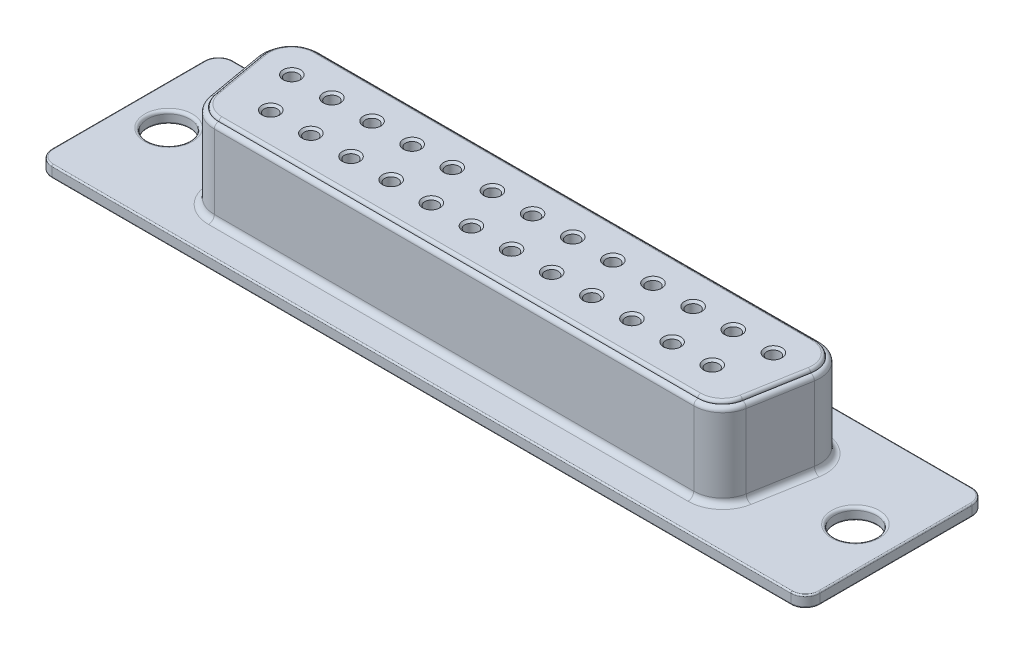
ISO-10303-21;
HEADER;
FILE_DESCRIPTION(('STEP AP214'),'2;1');
FILE_NAME('part.step','',(''),(''),'','','');
FILE_SCHEMA(('AUTOMOTIVE_DESIGN { 1 0 10303 214 1 1 1 1 }'));
ENDSEC;
DATA;
#1=APPLICATION_CONTEXT('core data for automotive mechanical design processes');
#2=APPLICATION_PROTOCOL_DEFINITION('international standard','automotive_design',2000,#1);
#3=PRODUCT_CONTEXT('',#1,'mechanical');
#4=PRODUCT('Part','Part','',(#3));
#5=PRODUCT_RELATED_PRODUCT_CATEGORY('part','',(#4));
#6=PRODUCT_DEFINITION_FORMATION('','',#4);
#7=PRODUCT_DEFINITION_CONTEXT('part definition',#1,'design');
#8=PRODUCT_DEFINITION('design','',#6,#7);
#9=PRODUCT_DEFINITION_SHAPE('','',#8);
#10=(LENGTH_UNIT() NAMED_UNIT(*) SI_UNIT(.MILLI.,.METRE.));
#11=(NAMED_UNIT(*) PLANE_ANGLE_UNIT() SI_UNIT($,.RADIAN.));
#12=(NAMED_UNIT(*) SI_UNIT($,.STERADIAN.) SOLID_ANGLE_UNIT());
#13=UNCERTAINTY_MEASURE_WITH_UNIT(LENGTH_MEASURE(1.E-05),#10,'distance_accuracy_value','');
#14=(GEOMETRIC_REPRESENTATION_CONTEXT(3) GLOBAL_UNCERTAINTY_ASSIGNED_CONTEXT((#13)) GLOBAL_UNIT_ASSIGNED_CONTEXT((#10,
#11,#12)) REPRESENTATION_CONTEXT('',''));
#15=CARTESIAN_POINT('',(0.,0.,0.));
#16=DIRECTION('',(0.,0.,1.));
#17=DIRECTION('',(1.,0.,0.));
#18=AXIS2_PLACEMENT_3D('',#15,#16,#17);
#19=CARTESIAN_POINT('',(-25.5,0.8,5.25));
#20=DIRECTION('',(0.,-1.,0.));
#21=DIRECTION('',(0.,0.,-1.));
#22=AXIS2_PLACEMENT_3D('',#19,#20,#21);
#23=PLANE('',#22);
#24=CARTESIAN_POINT('',(-25.5,0.8,-5.25));
#25=DIRECTION('',(0.,-1.,0.));
#26=DIRECTION('',(0.,0.,-1.));
#27=AXIS2_PLACEMENT_3D('',#24,#25,#26);
#28=CIRCLE('',#27,0.9);
#29=CARTESIAN_POINT('',(-25.5,0.8,-6.15));
#30=VERTEX_POINT('',#29);
#31=CARTESIAN_POINT('',(-26.4,0.8,-5.25));
#32=VERTEX_POINT('',#31);
#33=EDGE_CURVE('E756',#30,#32,#28,.F.);
#34=ORIENTED_EDGE('',*,*,#33,.T.);
#35=DIRECTION('',(0.,0.,1.));
#36=VECTOR('',#35,1.);
#37=CARTESIAN_POINT('',(-26.4,0.8,5.25));
#38=LINE('',#37,#36);
#39=CARTESIAN_POINT('',(-26.4,0.8,5.25));
#40=VERTEX_POINT('',#39);
#41=EDGE_CURVE('E758',#32,#40,#38,.T.);
#42=ORIENTED_EDGE('',*,*,#41,.T.);
#43=CARTESIAN_POINT('',(-25.5,0.8,5.25));
#44=DIRECTION('',(0.,-1.,0.));
#45=DIRECTION('',(0.,0.,-1.));
#46=AXIS2_PLACEMENT_3D('',#43,#44,#45);
#47=CIRCLE('',#46,0.900000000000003);
#48=CARTESIAN_POINT('',(-25.5,0.8,6.15));
#49=VERTEX_POINT('',#48);
#50=EDGE_CURVE('E744',#40,#49,#47,.F.);
#51=ORIENTED_EDGE('',*,*,#50,.T.);
#52=DIRECTION('',(1.,0.,0.));
#53=VECTOR('',#52,1.);
#54=CARTESIAN_POINT('',(-25.5,0.8,6.15));
#55=LINE('',#54,#53);
#56=CARTESIAN_POINT('',(25.5,0.8,6.15));
#57=VERTEX_POINT('',#56);
#58=EDGE_CURVE('E746',#49,#57,#55,.T.);
#59=ORIENTED_EDGE('',*,*,#58,.T.);
#60=CARTESIAN_POINT('',(25.5,0.8,5.25));
#61=DIRECTION('',(0.,-1.,0.));
#62=DIRECTION('',(0.,0.,-1.));
#63=AXIS2_PLACEMENT_3D('',#60,#61,#62);
#64=CIRCLE('',#63,0.9);
#65=CARTESIAN_POINT('',(26.4,0.8,5.25));
#66=VERTEX_POINT('',#65);
#67=EDGE_CURVE('E748',#57,#66,#64,.F.);
#68=ORIENTED_EDGE('',*,*,#67,.T.);
#69=DIRECTION('',(0.,0.,-1.));
#70=VECTOR('',#69,1.);
#71=CARTESIAN_POINT('',(26.4,0.8,5.25));
#72=LINE('',#71,#70);
#73=CARTESIAN_POINT('',(26.4,0.8,-5.25));
#74=VERTEX_POINT('',#73);
#75=EDGE_CURVE('E750',#66,#74,#72,.T.);
#76=ORIENTED_EDGE('',*,*,#75,.T.);
#77=CARTESIAN_POINT('',(25.5,0.8,-5.25));
#78=DIRECTION('',(0.,-1.,0.));
#79=DIRECTION('',(0.,0.,-1.));
#80=AXIS2_PLACEMENT_3D('',#77,#78,#79);
#81=CIRCLE('',#80,0.9);
#82=CARTESIAN_POINT('',(25.5,0.8,-6.15));
#83=VERTEX_POINT('',#82);
#84=EDGE_CURVE('E752',#74,#83,#81,.F.);
#85=ORIENTED_EDGE('',*,*,#84,.T.);
#86=DIRECTION('',(-1.,0.,0.));
#87=VECTOR('',#86,1.);
#88=CARTESIAN_POINT('',(-25.5,0.8,-6.15));
#89=LINE('',#88,#87);
#90=EDGE_CURVE('E754',#83,#30,#89,.T.);
#91=ORIENTED_EDGE('',*,*,#90,.T.);
#92=EDGE_LOOP('',(#34,#42,#51,#59,#68,#76,#85,#91));
#93=FACE_BOUND('',#92,.T.);
#94=CARTESIAN_POINT('',(23.7,0.8,0.));
#95=DIRECTION('',(0.,-1.,0.));
#96=DIRECTION('',(0.,0.,-1.));
#97=AXIS2_PLACEMENT_3D('',#94,#95,#96);
#98=CIRCLE('',#97,1.65);
#99=CARTESIAN_POINT('',(23.7,0.8,-1.65));
#100=VERTEX_POINT('',#99);
#101=EDGE_CURVE('E675',#100,#100,#98,.T.);
#102=ORIENTED_EDGE('',*,*,#101,.T.);
#103=EDGE_LOOP('',(#102));
#104=FACE_BOUND('',#103,.T.);
#105=CARTESIAN_POINT('',(-23.7,0.8,0.));
#106=DIRECTION('',(0.,-1.,0.));
#107=DIRECTION('',(0.,0.,-1.));
#108=AXIS2_PLACEMENT_3D('',#105,#106,#107);
#109=CIRCLE('',#108,1.65);
#110=CARTESIAN_POINT('',(-23.7,0.8,-1.65));
#111=VERTEX_POINT('',#110);
#112=EDGE_CURVE('E672',#111,#111,#109,.T.);
#113=ORIENTED_EDGE('',*,*,#112,.T.);
#114=EDGE_LOOP('',(#113));
#115=FACE_BOUND('',#114,.T.);
#116=DIRECTION('',(1.,0.,0.));
#117=VECTOR('',#116,1.);
#118=CARTESIAN_POINT('',(-16.5446920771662,0.8,4.4));
#119=LINE('',#118,#117);
#120=CARTESIAN_POINT('',(16.5446920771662,0.8,4.4));
#121=VERTEX_POINT('',#120);
#122=CARTESIAN_POINT('',(-16.5446920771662,0.8,4.4));
#123=VERTEX_POINT('',#122);
#124=EDGE_CURVE('E616',#121,#123,#119,.F.);
#125=ORIENTED_EDGE('',*,*,#124,.T.);
#126=CARTESIAN_POINT('',(-16.5446920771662,0.8,2.));
#127=DIRECTION('',(0.,-1.,0.));
#128=DIRECTION('',(0.,0.,-1.));
#129=AXIS2_PLACEMENT_3D('',#126,#127,#128);
#130=CIRCLE('',#129,2.4);
#131=CARTESIAN_POINT('',(-18.9082306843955,0.8,2.41675562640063));
#132=VERTEX_POINT('',#131);
#133=EDGE_CURVE('E630',#123,#132,#130,.T.);
#134=ORIENTED_EDGE('',*,*,#133,.T.);
#135=DIRECTION('',(0.173648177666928,0.,0.984807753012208));
#136=VECTOR('',#135,1.);
#137=CARTESIAN_POINT('',(-19.6135386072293,0.8,-1.58324437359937));
#138=LINE('',#137,#136);
#139=CARTESIAN_POINT('',(-19.6135386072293,0.8,-1.58324437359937));
#140=VERTEX_POINT('',#139);
#141=EDGE_CURVE('E628',#132,#140,#138,.F.);
#142=ORIENTED_EDGE('',*,*,#141,.T.);
#143=CARTESIAN_POINT('',(-17.25,0.8,-2.));
#144=DIRECTION('',(0.,-1.,0.));
#145=DIRECTION('',(0.,0.,-1.));
#146=AXIS2_PLACEMENT_3D('',#143,#144,#145);
#147=CIRCLE('',#146,2.4);
#148=CARTESIAN_POINT('',(-17.25,0.8,-4.4));
#149=VERTEX_POINT('',#148);
#150=EDGE_CURVE('E626',#140,#149,#147,.T.);
#151=ORIENTED_EDGE('',*,*,#150,.T.);
#152=DIRECTION('',(-1.,0.,0.));
#153=VECTOR('',#152,1.);
#154=CARTESIAN_POINT('',(17.25,0.8,-4.40000000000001));
#155=LINE('',#154,#153);
#156=CARTESIAN_POINT('',(17.25,0.8,-4.40000000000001));
#157=VERTEX_POINT('',#156);
#158=EDGE_CURVE('E624',#149,#157,#155,.F.);
#159=ORIENTED_EDGE('',*,*,#158,.T.);
#160=CARTESIAN_POINT('',(17.25,0.8,-2.));
#161=DIRECTION('',(0.,-1.,0.));
#162=DIRECTION('',(0.,0.,-1.));
#163=AXIS2_PLACEMENT_3D('',#160,#161,#162);
#164=CIRCLE('',#163,2.4);
#165=CARTESIAN_POINT('',(19.6135386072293,0.8,-1.58324437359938));
#166=VERTEX_POINT('',#165);
#167=EDGE_CURVE('E622',#157,#166,#164,.T.);
#168=ORIENTED_EDGE('',*,*,#167,.T.);
#169=DIRECTION('',(0.173648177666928,0.,-0.984807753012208));
#170=VECTOR('',#169,1.);
#171=CARTESIAN_POINT('',(18.9082306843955,0.8,2.41675562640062));
#172=LINE('',#171,#170);
#173=CARTESIAN_POINT('',(18.9082306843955,0.8,2.41675562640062));
#174=VERTEX_POINT('',#173);
#175=EDGE_CURVE('E620',#166,#174,#172,.F.);
#176=ORIENTED_EDGE('',*,*,#175,.T.);
#177=CARTESIAN_POINT('',(16.5446920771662,0.8,2.));
#178=DIRECTION('',(0.,-1.,0.));
#179=DIRECTION('',(0.,0.,-1.));
#180=AXIS2_PLACEMENT_3D('',#177,#178,#179);
#181=CIRCLE('',#180,2.4);
#182=EDGE_CURVE('E618',#174,#121,#181,.T.);
#183=ORIENTED_EDGE('',*,*,#182,.T.);
#184=EDGE_LOOP('',(#125,#134,#142,#151,#159,#168,#176,#183));
#185=FACE_BOUND('',#184,.T.);
#186=ADVANCED_FACE('F34',(#93,#104,#115,#185),#23,.F.);
#187=CARTESIAN_POINT('',(-25.5,0.8,5.25));
#188=DIRECTION('',(0.,-1.,0.));
#189=DIRECTION('',(0.,0.,-1.));
#190=AXIS2_PLACEMENT_3D('',#187,#188,#189);
#191=CYLINDRICAL_SURFACE('',#190,1.);
#192=DIRECTION('',(0.,-1.,0.));
#193=VECTOR('',#192,1.);
#194=CARTESIAN_POINT('',(-26.5,0.8,5.25));
#195=LINE('',#194,#193);
#196=CARTESIAN_POINT('',(-26.5,0.7,5.25));
#197=VERTEX_POINT('',#196);
#198=CARTESIAN_POINT('',(-26.5,0.1,5.25));
#199=VERTEX_POINT('',#198);
#200=EDGE_CURVE('E548',#197,#199,#195,.T.);
#201=ORIENTED_EDGE('',*,*,#200,.T.);
#202=CARTESIAN_POINT('',(-25.5,0.1,5.25));
#203=DIRECTION('',(0.,-1.,0.));
#204=DIRECTION('',(0.,0.,-1.));
#205=AXIS2_PLACEMENT_3D('',#202,#203,#204);
#206=CIRCLE('',#205,1.);
#207=CARTESIAN_POINT('',(-25.5,0.1,6.25));
#208=VERTEX_POINT('',#207);
#209=EDGE_CURVE('E736',#199,#208,#206,.F.);
#210=ORIENTED_EDGE('',*,*,#209,.T.);
#211=DIRECTION('',(0.,-1.,0.));
#212=VECTOR('',#211,1.);
#213=CARTESIAN_POINT('',(-25.5,0.8,6.25));
#214=LINE('',#213,#212);
#215=CARTESIAN_POINT('',(-25.5,0.7,6.25));
#216=VERTEX_POINT('',#215);
#217=EDGE_CURVE('E569',#216,#208,#214,.T.);
#218=ORIENTED_EDGE('',*,*,#217,.F.);
#219=CARTESIAN_POINT('',(-25.5,0.7,5.25));
#220=DIRECTION('',(0.,-1.,0.));
#221=DIRECTION('',(0.,0.,-1.));
#222=AXIS2_PLACEMENT_3D('',#219,#220,#221);
#223=CIRCLE('',#222,1.);
#224=EDGE_CURVE('E734',#216,#197,#223,.T.);
#225=ORIENTED_EDGE('',*,*,#224,.T.);
#226=EDGE_LOOP('',(#201,#210,#218,#225));
#227=FACE_BOUND('',#226,.T.);
#228=ADVANCED_FACE('F1017',(#227),#191,.T.);
#229=CARTESIAN_POINT('',(25.5,0.8,6.25));
#230=DIRECTION('',(0.,0.,-1.));
#231=DIRECTION('',(-1.,0.,0.));
#232=AXIS2_PLACEMENT_3D('',#229,#230,#231);
#233=PLANE('',#232);
#234=ORIENTED_EDGE('',*,*,#217,.T.);
#235=DIRECTION('',(1.,0.,0.));
#236=VECTOR('',#235,1.);
#237=CARTESIAN_POINT('',(25.5,0.1,6.25));
#238=LINE('',#237,#236);
#239=CARTESIAN_POINT('',(25.5,0.1,6.25));
#240=VERTEX_POINT('',#239);
#241=EDGE_CURVE('E683',#208,#240,#238,.T.);
#242=ORIENTED_EDGE('',*,*,#241,.T.);
#243=DIRECTION('',(0.,-1.,0.));
#244=VECTOR('',#243,1.);
#245=CARTESIAN_POINT('',(25.5,0.8,6.25));
#246=LINE('',#245,#244);
#247=CARTESIAN_POINT('',(25.5,0.7,6.25));
#248=VERTEX_POINT('',#247);
#249=EDGE_CURVE('E566',#248,#240,#246,.T.);
#250=ORIENTED_EDGE('',*,*,#249,.F.);
#251=DIRECTION('',(1.,0.,0.));
#252=VECTOR('',#251,1.);
#253=CARTESIAN_POINT('',(25.5,0.7,6.25));
#254=LINE('',#253,#252);
#255=EDGE_CURVE('E681',#248,#216,#254,.F.);
#256=ORIENTED_EDGE('',*,*,#255,.T.);
#257=EDGE_LOOP('',(#234,#242,#250,#256));
#258=FACE_BOUND('',#257,.T.);
#259=ADVANCED_FACE('F1023',(#258),#233,.F.);
#260=CARTESIAN_POINT('',(25.5,0.8,5.25));
#261=DIRECTION('',(0.,-1.,0.));
#262=DIRECTION('',(0.,0.,-1.));
#263=AXIS2_PLACEMENT_3D('',#260,#261,#262);
#264=CYLINDRICAL_SURFACE('',#263,1.);
#265=ORIENTED_EDGE('',*,*,#249,.T.);
#266=CARTESIAN_POINT('',(25.5,0.1,5.25));
#267=DIRECTION('',(0.,-1.,0.));
#268=DIRECTION('',(0.,0.,-1.));
#269=AXIS2_PLACEMENT_3D('',#266,#267,#268);
#270=CIRCLE('',#269,1.);
#271=CARTESIAN_POINT('',(26.5,0.1,5.25));
#272=VERTEX_POINT('',#271);
#273=EDGE_CURVE('E711',#240,#272,#270,.F.);
#274=ORIENTED_EDGE('',*,*,#273,.T.);
#275=DIRECTION('',(0.,-1.,0.));
#276=VECTOR('',#275,1.);
#277=CARTESIAN_POINT('',(26.5,0.8,5.25));
#278=LINE('',#277,#276);
#279=CARTESIAN_POINT('',(26.5,0.7,5.25));
#280=VERTEX_POINT('',#279);
#281=EDGE_CURVE('E563',#280,#272,#278,.T.);
#282=ORIENTED_EDGE('',*,*,#281,.F.);
#283=CARTESIAN_POINT('',(25.5,0.7,5.25));
#284=DIRECTION('',(0.,-1.,0.));
#285=DIRECTION('',(0.,0.,-1.));
#286=AXIS2_PLACEMENT_3D('',#283,#284,#285);
#287=CIRCLE('',#286,1.);
#288=EDGE_CURVE('E709',#280,#248,#287,.T.);
#289=ORIENTED_EDGE('',*,*,#288,.T.);
#290=EDGE_LOOP('',(#265,#274,#282,#289));
#291=FACE_BOUND('',#290,.T.);
#292=ADVANCED_FACE('F1054',(#291),#264,.T.);
#293=CARTESIAN_POINT('',(26.5,0.8,5.25));
#294=DIRECTION('',(-1.,0.,0.));
#295=DIRECTION('',(0.,0.,1.));
#296=AXIS2_PLACEMENT_3D('',#293,#294,#295);
#297=PLANE('',#296);
#298=ORIENTED_EDGE('',*,*,#281,.T.);
#299=DIRECTION('',(0.,0.,-1.));
#300=VECTOR('',#299,1.);
#301=CARTESIAN_POINT('',(26.5,0.1,-5.25));
#302=LINE('',#301,#300);
#303=CARTESIAN_POINT('',(26.5,0.1,-5.25));
#304=VERTEX_POINT('',#303);
#305=EDGE_CURVE('E715',#272,#304,#302,.T.);
#306=ORIENTED_EDGE('',*,*,#305,.T.);
#307=DIRECTION('',(0.,-1.,0.));
#308=VECTOR('',#307,1.);
#309=CARTESIAN_POINT('',(26.5,0.8,-5.25));
#310=LINE('',#309,#308);
#311=CARTESIAN_POINT('',(26.5,0.7,-5.25));
#312=VERTEX_POINT('',#311);
#313=EDGE_CURVE('E560',#312,#304,#310,.T.);
#314=ORIENTED_EDGE('',*,*,#313,.F.);
#315=DIRECTION('',(0.,0.,-1.));
#316=VECTOR('',#315,1.);
#317=CARTESIAN_POINT('',(26.5,0.7,5.25));
#318=LINE('',#317,#316);
#319=EDGE_CURVE('E713',#312,#280,#318,.F.);
#320=ORIENTED_EDGE('',*,*,#319,.T.);
#321=EDGE_LOOP('',(#298,#306,#314,#320));
#322=FACE_BOUND('',#321,.T.);
#323=ADVANCED_FACE('F1050',(#322),#297,.F.);
#324=CARTESIAN_POINT('',(25.5,0.8,-5.25));
#325=DIRECTION('',(0.,-1.,0.));
#326=DIRECTION('',(0.,0.,-1.));
#327=AXIS2_PLACEMENT_3D('',#324,#325,#326);
#328=CYLINDRICAL_SURFACE('',#327,1.);
#329=ORIENTED_EDGE('',*,*,#313,.T.);
#330=CARTESIAN_POINT('',(25.5,0.1,-5.25));
#331=DIRECTION('',(0.,-1.,0.));
#332=DIRECTION('',(0.,0.,-1.));
#333=AXIS2_PLACEMENT_3D('',#330,#331,#332);
#334=CIRCLE('',#333,1.);
#335=CARTESIAN_POINT('',(25.5,0.1,-6.25));
#336=VERTEX_POINT('',#335);
#337=EDGE_CURVE('E719',#304,#336,#334,.F.);
#338=ORIENTED_EDGE('',*,*,#337,.T.);
#339=DIRECTION('',(0.,-1.,0.));
#340=VECTOR('',#339,1.);
#341=CARTESIAN_POINT('',(25.5,0.8,-6.25));
#342=LINE('',#341,#340);
#343=CARTESIAN_POINT('',(25.5,0.7,-6.25));
#344=VERTEX_POINT('',#343);
#345=EDGE_CURVE('E557',#344,#336,#342,.T.);
#346=ORIENTED_EDGE('',*,*,#345,.F.);
#347=CARTESIAN_POINT('',(25.5,0.7,-5.25));
#348=DIRECTION('',(0.,-1.,0.));
#349=DIRECTION('',(0.,0.,-1.));
#350=AXIS2_PLACEMENT_3D('',#347,#348,#349);
#351=CIRCLE('',#350,1.);
#352=EDGE_CURVE('E717',#344,#312,#351,.T.);
#353=ORIENTED_EDGE('',*,*,#352,.T.);
#354=EDGE_LOOP('',(#329,#338,#346,#353));
#355=FACE_BOUND('',#354,.T.);
#356=ADVANCED_FACE('F1046',(#355),#328,.T.);
#357=CARTESIAN_POINT('',(25.5,0.8,-6.25));
#358=DIRECTION('',(0.,0.,1.));
#359=DIRECTION('',(1.,0.,0.));
#360=AXIS2_PLACEMENT_3D('',#357,#358,#359);
#361=PLANE('',#360);
#362=ORIENTED_EDGE('',*,*,#345,.T.);
#363=DIRECTION('',(-1.,0.,0.));
#364=VECTOR('',#363,1.);
#365=CARTESIAN_POINT('',(-25.5,0.1,-6.25));
#366=LINE('',#365,#364);
#367=CARTESIAN_POINT('',(-25.5,0.1,-6.25));
#368=VERTEX_POINT('',#367);
#369=EDGE_CURVE('E723',#336,#368,#366,.T.);
#370=ORIENTED_EDGE('',*,*,#369,.T.);
#371=DIRECTION('',(0.,-1.,0.));
#372=VECTOR('',#371,1.);
#373=CARTESIAN_POINT('',(-25.5,0.8,-6.25));
#374=LINE('',#373,#372);
#375=CARTESIAN_POINT('',(-25.5,0.7,-6.25));
#376=VERTEX_POINT('',#375);
#377=EDGE_CURVE('E554',#376,#368,#374,.T.);
#378=ORIENTED_EDGE('',*,*,#377,.F.);
#379=DIRECTION('',(-1.,0.,0.));
#380=VECTOR('',#379,1.);
#381=CARTESIAN_POINT('',(25.5,0.7,-6.25));
#382=LINE('',#381,#380);
#383=EDGE_CURVE('E721',#376,#344,#382,.F.);
#384=ORIENTED_EDGE('',*,*,#383,.T.);
#385=EDGE_LOOP('',(#362,#370,#378,#384));
#386=FACE_BOUND('',#385,.T.);
#387=ADVANCED_FACE('F1042',(#386),#361,.F.);
#388=CARTESIAN_POINT('',(-25.5,0.8,-5.25));
#389=DIRECTION('',(0.,-1.,0.));
#390=DIRECTION('',(0.,0.,-1.));
#391=AXIS2_PLACEMENT_3D('',#388,#389,#390);
#392=CYLINDRICAL_SURFACE('',#391,1.);
#393=ORIENTED_EDGE('',*,*,#377,.T.);
#394=CARTESIAN_POINT('',(-25.5,0.1,-5.25));
#395=DIRECTION('',(0.,-1.,0.));
#396=DIRECTION('',(0.,0.,-1.));
#397=AXIS2_PLACEMENT_3D('',#394,#395,#396);
#398=CIRCLE('',#397,1.);
#399=CARTESIAN_POINT('',(-26.5,0.1,-5.25));
#400=VERTEX_POINT('',#399);
#401=EDGE_CURVE('E727',#368,#400,#398,.F.);
#402=ORIENTED_EDGE('',*,*,#401,.T.);
#403=DIRECTION('',(0.,-1.,0.));
#404=VECTOR('',#403,1.);
#405=CARTESIAN_POINT('',(-26.5,0.8,-5.25));
#406=LINE('',#405,#404);
#407=CARTESIAN_POINT('',(-26.5,0.7,-5.25));
#408=VERTEX_POINT('',#407);
#409=EDGE_CURVE('E551',#408,#400,#406,.T.);
#410=ORIENTED_EDGE('',*,*,#409,.F.);
#411=CARTESIAN_POINT('',(-25.5,0.7,-5.25));
#412=DIRECTION('',(0.,-1.,0.));
#413=DIRECTION('',(0.,0.,-1.));
#414=AXIS2_PLACEMENT_3D('',#411,#412,#413);
#415=CIRCLE('',#414,1.);
#416=EDGE_CURVE('E725',#408,#376,#415,.T.);
#417=ORIENTED_EDGE('',*,*,#416,.T.);
#418=EDGE_LOOP('',(#393,#402,#410,#417));
#419=FACE_BOUND('',#418,.T.);
#420=ADVANCED_FACE('F1038',(#419),#392,.T.);
#421=CARTESIAN_POINT('',(-26.5,0.8,5.25));
#422=DIRECTION('',(1.,0.,0.));
#423=DIRECTION('',(0.,0.,-1.));
#424=AXIS2_PLACEMENT_3D('',#421,#422,#423);
#425=PLANE('',#424);
#426=ORIENTED_EDGE('',*,*,#409,.T.);
#427=DIRECTION('',(0.,0.,1.));
#428=VECTOR('',#427,1.);
#429=CARTESIAN_POINT('',(-26.5,0.1,5.25));
#430=LINE('',#429,#428);
#431=EDGE_CURVE('E732',#400,#199,#430,.T.);
#432=ORIENTED_EDGE('',*,*,#431,.T.);
#433=ORIENTED_EDGE('',*,*,#200,.F.);
#434=DIRECTION('',(0.,0.,1.));
#435=VECTOR('',#434,1.);
#436=CARTESIAN_POINT('',(-26.5,0.7,5.25));
#437=LINE('',#436,#435);
#438=EDGE_CURVE('E729',#197,#408,#437,.F.);
#439=ORIENTED_EDGE('',*,*,#438,.T.);
#440=EDGE_LOOP('',(#426,#432,#433,#439));
#441=FACE_BOUND('',#440,.T.);
#442=ADVANCED_FACE('F1034',(#441),#425,.F.);
#443=CARTESIAN_POINT('',(-25.5,0.,5.25));
#444=DIRECTION('',(0.,-1.,0.));
#445=DIRECTION('',(0.,0.,-1.));
#446=AXIS2_PLACEMENT_3D('',#443,#444,#445);
#447=PLANE('',#446);
#448=CARTESIAN_POINT('',(25.5,0.,5.25));
#449=DIRECTION('',(0.,-1.,0.));
#450=DIRECTION('',(0.,0.,-1.));
#451=AXIS2_PLACEMENT_3D('',#448,#449,#450);
#452=CIRCLE('',#451,0.9);
#453=CARTESIAN_POINT('',(26.4,0.,5.25));
#454=VERTEX_POINT('',#453);
#455=CARTESIAN_POINT('',(25.5,0.,6.15));
#456=VERTEX_POINT('',#455);
#457=EDGE_CURVE('E704',#454,#456,#452,.T.);
#458=ORIENTED_EDGE('',*,*,#457,.T.);
#459=DIRECTION('',(1.,0.,0.));
#460=VECTOR('',#459,1.);
#461=CARTESIAN_POINT('',(-25.5,0.,6.15));
#462=LINE('',#461,#460);
#463=CARTESIAN_POINT('',(-25.5,0.,6.15));
#464=VERTEX_POINT('',#463);
#465=EDGE_CURVE('E706',#456,#464,#462,.F.);
#466=ORIENTED_EDGE('',*,*,#465,.T.);
#467=CARTESIAN_POINT('',(-25.5,0.,5.25));
#468=DIRECTION('',(0.,-1.,0.));
#469=DIRECTION('',(0.,0.,-1.));
#470=AXIS2_PLACEMENT_3D('',#467,#468,#469);
#471=CIRCLE('',#470,0.900000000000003);
#472=CARTESIAN_POINT('',(-26.4,0.,5.25));
#473=VERTEX_POINT('',#472);
#474=EDGE_CURVE('E692',#464,#473,#471,.T.);
#475=ORIENTED_EDGE('',*,*,#474,.T.);
#476=DIRECTION('',(0.,0.,1.));
#477=VECTOR('',#476,1.);
#478=CARTESIAN_POINT('',(-26.4,0.,-5.25));
#479=LINE('',#478,#477);
#480=CARTESIAN_POINT('',(-26.4,0.,-5.25));
#481=VERTEX_POINT('',#480);
#482=EDGE_CURVE('E694',#473,#481,#479,.F.);
#483=ORIENTED_EDGE('',*,*,#482,.T.);
#484=CARTESIAN_POINT('',(-25.5,0.,-5.25));
#485=DIRECTION('',(0.,-1.,0.));
#486=DIRECTION('',(0.,0.,-1.));
#487=AXIS2_PLACEMENT_3D('',#484,#485,#486);
#488=CIRCLE('',#487,0.9);
#489=CARTESIAN_POINT('',(-25.5,0.,-6.15));
#490=VERTEX_POINT('',#489);
#491=EDGE_CURVE('E696',#481,#490,#488,.T.);
#492=ORIENTED_EDGE('',*,*,#491,.T.);
#493=DIRECTION('',(-1.,0.,0.));
#494=VECTOR('',#493,1.);
#495=CARTESIAN_POINT('',(25.5,0.,-6.15));
#496=LINE('',#495,#494);
#497=CARTESIAN_POINT('',(25.5,0.,-6.15));
#498=VERTEX_POINT('',#497);
#499=EDGE_CURVE('E698',#490,#498,#496,.F.);
#500=ORIENTED_EDGE('',*,*,#499,.T.);
#501=CARTESIAN_POINT('',(25.5,0.,-5.25));
#502=DIRECTION('',(0.,-1.,0.));
#503=DIRECTION('',(0.,0.,-1.));
#504=AXIS2_PLACEMENT_3D('',#501,#502,#503);
#505=CIRCLE('',#504,0.9);
#506=CARTESIAN_POINT('',(26.4,0.,-5.25));
#507=VERTEX_POINT('',#506);
#508=EDGE_CURVE('E700',#498,#507,#505,.T.);
#509=ORIENTED_EDGE('',*,*,#508,.T.);
#510=DIRECTION('',(0.,0.,-1.));
#511=VECTOR('',#510,1.);
#512=CARTESIAN_POINT('',(26.4,0.,5.25));
#513=LINE('',#512,#511);
#514=EDGE_CURVE('E702',#507,#454,#513,.F.);
#515=ORIENTED_EDGE('',*,*,#514,.T.);
#516=EDGE_LOOP('',(#458,#466,#475,#483,#492,#500,#509,#515));
#517=FACE_BOUND('',#516,.T.);
#518=CARTESIAN_POINT('',(-23.7,0.,0.));
#519=DIRECTION('',(0.,-1.,0.));
#520=DIRECTION('',(0.,0.,-1.));
#521=AXIS2_PLACEMENT_3D('',#518,#519,#520);
#522=CIRCLE('',#521,1.55);
#523=CARTESIAN_POINT('',(-23.7,0.,-1.55));
#524=VERTEX_POINT('',#523);
#525=EDGE_CURVE('E689',#524,#524,#522,.F.);
#526=ORIENTED_EDGE('',*,*,#525,.T.);
#527=EDGE_LOOP('',(#526));
#528=FACE_BOUND('',#527,.T.);
#529=CARTESIAN_POINT('',(23.7,0.,0.));
#530=DIRECTION('',(0.,-1.,0.));
#531=DIRECTION('',(0.,0.,-1.));
#532=AXIS2_PLACEMENT_3D('',#529,#530,#531);
#533=CIRCLE('',#532,1.55);
#534=CARTESIAN_POINT('',(23.7,0.,-1.55));
#535=VERTEX_POINT('',#534);
#536=EDGE_CURVE('E686',#535,#535,#533,.F.);
#537=ORIENTED_EDGE('',*,*,#536,.T.);
#538=EDGE_LOOP('',(#537));
#539=FACE_BOUND('',#538,.T.);
#540=ADVANCED_FACE('F1031',(#517,#528,#539),#447,.T.);
#541=CARTESIAN_POINT('',(-23.7,0.,0.));
#542=DIRECTION('',(0.,1.,0.));
#543=DIRECTION('',(0.,0.,1.));
#544=AXIS2_PLACEMENT_3D('',#541,#542,#543);
#545=CYLINDRICAL_SURFACE('',#544,1.45);
#546=CARTESIAN_POINT('',(-23.7,0.1,0.));
#547=DIRECTION('',(0.,-1.,0.));
#548=DIRECTION('',(0.,0.,-1.));
#549=AXIS2_PLACEMENT_3D('',#546,#547,#548);
#550=CIRCLE('',#549,1.45);
#551=CARTESIAN_POINT('',(-23.7,0.1,-1.45));
#552=VERTEX_POINT('',#551);
#553=EDGE_CURVE('E738',#552,#552,#550,.T.);
#554=ORIENTED_EDGE('',*,*,#553,.T.);
#555=EDGE_LOOP('',(#554));
#556=FACE_BOUND('',#555,.T.);
#557=CARTESIAN_POINT('',(-23.7,0.6,0.));
#558=DIRECTION('',(0.,-1.,0.));
#559=DIRECTION('',(0.,0.,-1.));
#560=AXIS2_PLACEMENT_3D('',#557,#558,#559);
#561=CIRCLE('',#560,1.45);
#562=CARTESIAN_POINT('',(-23.7,0.6,-1.45));
#563=VERTEX_POINT('',#562);
#564=EDGE_CURVE('E678',#563,#563,#561,.F.);
#565=ORIENTED_EDGE('',*,*,#564,.T.);
#566=EDGE_LOOP('',(#565));
#567=FACE_BOUND('',#566,.T.);
#568=ADVANCED_FACE('F1029',(#556,#567),#545,.F.);
#569=CARTESIAN_POINT('',(23.7,0.,0.));
#570=DIRECTION('',(0.,1.,0.));
#571=DIRECTION('',(0.,0.,1.));
#572=AXIS2_PLACEMENT_3D('',#569,#570,#571);
#573=CYLINDRICAL_SURFACE('',#572,1.45);
#574=CARTESIAN_POINT('',(23.7,0.1,0.));
#575=DIRECTION('',(0.,-1.,0.));
#576=DIRECTION('',(0.,0.,-1.));
#577=AXIS2_PLACEMENT_3D('',#574,#575,#576);
#578=CIRCLE('',#577,1.45);
#579=CARTESIAN_POINT('',(23.7,0.1,-1.45));
#580=VERTEX_POINT('',#579);
#581=EDGE_CURVE('E741',#580,#580,#578,.T.);
#582=ORIENTED_EDGE('',*,*,#581,.T.);
#583=EDGE_LOOP('',(#582));
#584=FACE_BOUND('',#583,.T.);
#585=CARTESIAN_POINT('',(23.7,0.6,0.));
#586=DIRECTION('',(0.,-1.,0.));
#587=DIRECTION('',(0.,0.,-1.));
#588=AXIS2_PLACEMENT_3D('',#585,#586,#587);
#589=CIRCLE('',#588,1.45);
#590=CARTESIAN_POINT('',(23.7,0.6,-1.45));
#591=VERTEX_POINT('',#590);
#592=EDGE_CURVE('E647',#591,#591,#589,.F.);
#593=ORIENTED_EDGE('',*,*,#592,.T.);
#594=EDGE_LOOP('',(#593));
#595=FACE_BOUND('',#594,.T.);
#596=ADVANCED_FACE('F1510',(#584,#595),#573,.F.);
#597=CARTESIAN_POINT('',(17.25,6.6,-3.70000000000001));
#598=DIRECTION('',(0.,0.,1.));
#599=DIRECTION('',(1.,0.,0.));
#600=AXIS2_PLACEMENT_3D('',#597,#598,#599);
#601=PLANE('',#600);
#602=DIRECTION('',(0.,-1.,0.));
#603=VECTOR('',#602,1.);
#604=CARTESIAN_POINT('',(-17.2258268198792,6.8,-3.7));
#605=LINE('',#604,#603);
#606=CARTESIAN_POINT('',(-17.2258268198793,6.6,-3.7));
#607=VERTEX_POINT('',#606);
#608=CARTESIAN_POINT('',(-17.2258268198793,1.1,-3.7));
#609=VERTEX_POINT('',#608);
#610=EDGE_CURVE('E546',#607,#609,#605,.T.);
#611=ORIENTED_EDGE('',*,*,#610,.F.);
#612=DIRECTION('',(-1.,0.,0.));
#613=VECTOR('',#612,1.);
#614=CARTESIAN_POINT('',(17.25,6.6,-3.70000000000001));
#615=LINE('',#614,#613);
#616=CARTESIAN_POINT('',(-17.25,6.6,-3.7));
#617=VERTEX_POINT('',#616);
#618=EDGE_CURVE('E358',#607,#617,#615,.T.);
#619=ORIENTED_EDGE('',*,*,#618,.T.);
#620=DIRECTION('',(0.,-1.,0.));
#621=VECTOR('',#620,1.);
#622=CARTESIAN_POINT('',(-17.25,6.6,-3.7));
#623=LINE('',#622,#621);
#624=CARTESIAN_POINT('',(-17.25,1.1,-3.7));
#625=VERTEX_POINT('',#624);
#626=EDGE_CURVE('E355',#617,#625,#623,.T.);
#627=ORIENTED_EDGE('',*,*,#626,.T.);
#628=DIRECTION('',(-1.,0.,0.));
#629=VECTOR('',#628,1.);
#630=CARTESIAN_POINT('',(17.25,1.1,-3.70000000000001));
#631=LINE('',#630,#629);
#632=EDGE_CURVE('E339',#609,#625,#631,.T.);
#633=ORIENTED_EDGE('',*,*,#632,.F.);
#634=EDGE_LOOP('',(#611,#619,#627,#633));
#635=FACE_BOUND('',#634,.T.);
#636=ADVANCED_FACE('F356',(#635),#601,.T.);
#637=CARTESIAN_POINT('',(-16.5446920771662,6.6,3.7));
#638=DIRECTION('',(0.,0.,-1.));
#639=DIRECTION('',(-1.,0.,0.));
#640=AXIS2_PLACEMENT_3D('',#637,#638,#639);
#641=PLANE('',#640);
#642=DIRECTION('',(0.,-1.,0.));
#643=VECTOR('',#642,1.);
#644=CARTESIAN_POINT('',(16.5205188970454,6.8,3.7));
#645=LINE('',#644,#643);
#646=CARTESIAN_POINT('',(16.5205188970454,6.6,3.69999999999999));
#647=VERTEX_POINT('',#646);
#648=CARTESIAN_POINT('',(16.5205188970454,1.1,3.69999999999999));
#649=VERTEX_POINT('',#648);
#650=EDGE_CURVE('E539',#647,#649,#645,.T.);
#651=ORIENTED_EDGE('',*,*,#650,.F.);
#652=DIRECTION('',(1.,0.,0.));
#653=VECTOR('',#652,1.);
#654=CARTESIAN_POINT('',(-16.5446920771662,6.6,3.7));
#655=LINE('',#654,#653);
#656=CARTESIAN_POINT('',(16.5446920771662,6.6,3.69999999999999));
#657=VERTEX_POINT('',#656);
#658=EDGE_CURVE('E408',#647,#657,#655,.T.);
#659=ORIENTED_EDGE('',*,*,#658,.T.);
#660=DIRECTION('',(0.,-1.,0.));
#661=VECTOR('',#660,1.);
#662=CARTESIAN_POINT('',(16.5446920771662,6.6,3.69999999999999));
#663=LINE('',#662,#661);
#664=CARTESIAN_POINT('',(16.5446920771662,1.1,3.69999999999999));
#665=VERTEX_POINT('',#664);
#666=EDGE_CURVE('E383',#657,#665,#663,.T.);
#667=ORIENTED_EDGE('',*,*,#666,.T.);
#668=DIRECTION('',(1.,0.,0.));
#669=VECTOR('',#668,1.);
#670=CARTESIAN_POINT('',(-16.5446920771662,1.1,3.7));
#671=LINE('',#670,#669);
#672=EDGE_CURVE('E380',#649,#665,#671,.T.);
#673=ORIENTED_EDGE('',*,*,#672,.F.);
#674=EDGE_LOOP('',(#651,#659,#667,#673));
#675=FACE_BOUND('',#674,.T.);
#676=ADVANCED_FACE('F1517',(#675),#641,.T.);
#677=CARTESIAN_POINT('',(17.25,1.1,-2.));
#678=DIRECTION('',(0.,1.,0.));
#679=DIRECTION('',(0.,0.,1.));
#680=AXIS2_PLACEMENT_3D('',#677,#678,#679);
#681=PLANE('',#680);
#682=CARTESIAN_POINT('',(-17.2258268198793,1.1,-2.));
#683=DIRECTION('',(0.,1.,0.));
#684=DIRECTION('',(0.,0.,1.));
#685=AXIS2_PLACEMENT_3D('',#682,#683,#684);
#686=CIRCLE('',#685,1.7);
#687=CARTESIAN_POINT('',(-18.9,1.1,-1.70479809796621));
#688=VERTEX_POINT('',#687);
#689=EDGE_CURVE('E347',#609,#688,#686,.T.);
#690=ORIENTED_EDGE('',*,*,#689,.F.);
#691=ORIENTED_EDGE('',*,*,#632,.T.);
#692=CARTESIAN_POINT('',(-17.25,1.1,-2.));
#693=DIRECTION('',(0.,1.,0.));
#694=DIRECTION('',(0.,0.,1.));
#695=AXIS2_PLACEMENT_3D('',#692,#693,#694);
#696=CIRCLE('',#695,1.7);
#697=CARTESIAN_POINT('',(-18.9241731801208,1.1,-1.70479809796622));
#698=VERTEX_POINT('',#697);
#699=EDGE_CURVE('E343',#625,#698,#696,.T.);
#700=ORIENTED_EDGE('',*,*,#699,.T.);
#701=DIRECTION('',(0.173648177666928,0.,0.984807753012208));
#702=VECTOR('',#701,1.);
#703=CARTESIAN_POINT('',(-18.9241731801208,1.1,-1.70479809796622));
#704=LINE('',#703,#702);
#705=CARTESIAN_POINT('',(-18.2188652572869,1.1,2.29520190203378));
#706=VERTEX_POINT('',#705);
#707=EDGE_CURVE('E368',#698,#706,#704,.T.);
#708=ORIENTED_EDGE('',*,*,#707,.T.);
#709=CARTESIAN_POINT('',(-16.5446920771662,1.1,2.));
#710=DIRECTION('',(0.,1.,0.));
#711=DIRECTION('',(0.,0.,1.));
#712=AXIS2_PLACEMENT_3D('',#709,#710,#711);
#713=CIRCLE('',#712,1.7);
#714=CARTESIAN_POINT('',(-16.5446920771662,1.1,3.7));
#715=VERTEX_POINT('',#714);
#716=EDGE_CURVE('E370',#706,#715,#713,.T.);
#717=ORIENTED_EDGE('',*,*,#716,.T.);
#718=CARTESIAN_POINT('',(-16.5205188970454,1.1,3.7));
#719=VERTEX_POINT('',#718);
#720=EDGE_CURVE('E384',#715,#719,#671,.T.);
#721=ORIENTED_EDGE('',*,*,#720,.T.);
#722=CARTESIAN_POINT('',(-16.5205188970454,1.1,2.));
#723=DIRECTION('',(0.,1.,0.));
#724=DIRECTION('',(0.,0.,1.));
#725=AXIS2_PLACEMENT_3D('',#722,#723,#724);
#726=CIRCLE('',#725,1.7);
#727=CARTESIAN_POINT('',(-18.1946920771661,1.1,2.29520190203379));
#728=VERTEX_POINT('',#727);
#729=EDGE_CURVE('E524',#728,#719,#726,.T.);
#730=ORIENTED_EDGE('',*,*,#729,.F.);
#731=DIRECTION('',(0.173648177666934,0.,0.984807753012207));
#732=VECTOR('',#731,1.);
#733=CARTESIAN_POINT('',(-18.9,1.1,-1.70479809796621));
#734=LINE('',#733,#732);
#735=EDGE_CURVE('E527',#688,#728,#734,.T.);
#736=ORIENTED_EDGE('',*,*,#735,.F.);
#737=EDGE_LOOP('',(#690,#691,#700,#708,#717,#721,#730,#736));
#738=FACE_BOUND('',#737,.T.);
#739=ADVANCED_FACE('F341',(#738),#681,.T.);
#740=CARTESIAN_POINT('',(17.25,6.6,-2.));
#741=DIRECTION('',(0.,-1.,0.));
#742=DIRECTION('',(0.,0.,-1.));
#743=AXIS2_PLACEMENT_3D('',#740,#741,#742);
#744=CYLINDRICAL_SURFACE('',#743,2.);
#745=DIRECTION('',(0.,-1.,0.));
#746=VECTOR('',#745,1.);
#747=CARTESIAN_POINT('',(19.2196155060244,6.6,-1.65270364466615));
#748=LINE('',#747,#746);
#749=CARTESIAN_POINT('',(19.2196155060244,6.3,-1.65270364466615));
#750=VERTEX_POINT('',#749);
#751=CARTESIAN_POINT('',(19.2196155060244,1.2,-1.65270364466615));
#752=VERTEX_POINT('',#751);
#753=EDGE_CURVE('E417',#750,#752,#748,.T.);
#754=ORIENTED_EDGE('',*,*,#753,.T.);
#755=CARTESIAN_POINT('',(17.25,1.2,-2.));
#756=DIRECTION('',(0.,-1.,0.));
#757=DIRECTION('',(0.,0.,-1.));
#758=AXIS2_PLACEMENT_3D('',#755,#756,#757);
#759=CIRCLE('',#758,2.);
#760=CARTESIAN_POINT('',(17.25,1.2,-4.00000000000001));
#761=VERTEX_POINT('',#760);
#762=EDGE_CURVE('E639',#752,#761,#759,.F.);
#763=ORIENTED_EDGE('',*,*,#762,.T.);
#764=DIRECTION('',(0.,-1.,0.));
#765=VECTOR('',#764,1.);
#766=CARTESIAN_POINT('',(17.25,6.6,-4.00000000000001));
#767=LINE('',#766,#765);
#768=CARTESIAN_POINT('',(17.25,6.3,-4.00000000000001));
#769=VERTEX_POINT('',#768);
#770=EDGE_CURVE('E438',#769,#761,#767,.T.);
#771=ORIENTED_EDGE('',*,*,#770,.F.);
#772=CARTESIAN_POINT('',(17.25,6.3,-2.));
#773=DIRECTION('',(0.,1.,0.));
#774=DIRECTION('',(0.,0.,1.));
#775=AXIS2_PLACEMENT_3D('',#772,#773,#774);
#776=CIRCLE('',#775,2.);
#777=EDGE_CURVE('E578',#769,#750,#776,.F.);
#778=ORIENTED_EDGE('',*,*,#777,.T.);
#779=EDGE_LOOP('',(#754,#763,#771,#778));
#780=FACE_BOUND('',#779,.T.);
#781=ADVANCED_FACE('F1388',(#780),#744,.T.);
#782=CARTESIAN_POINT('',(17.25,6.6,-4.00000000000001));
#783=DIRECTION('',(0.,0.,1.));
#784=DIRECTION('',(1.,0.,0.));
#785=AXIS2_PLACEMENT_3D('',#782,#783,#784);
#786=PLANE('',#785);
#787=ORIENTED_EDGE('',*,*,#770,.T.);
#788=DIRECTION('',(-1.,0.,0.));
#789=VECTOR('',#788,1.);
#790=CARTESIAN_POINT('',(-17.25,1.2,-4.));
#791=LINE('',#790,#789);
#792=CARTESIAN_POINT('',(-17.25,1.2,-4.));
#793=VERTEX_POINT('',#792);
#794=EDGE_CURVE('E637',#761,#793,#791,.T.);
#795=ORIENTED_EDGE('',*,*,#794,.T.);
#796=DIRECTION('',(0.,-1.,0.));
#797=VECTOR('',#796,1.);
#798=CARTESIAN_POINT('',(-17.25,6.6,-4.));
#799=LINE('',#798,#797);
#800=CARTESIAN_POINT('',(-17.25,6.3,-4.));
#801=VERTEX_POINT('',#800);
#802=EDGE_CURVE('E435',#801,#793,#799,.T.);
#803=ORIENTED_EDGE('',*,*,#802,.F.);
#804=DIRECTION('',(-1.,0.,0.));
#805=VECTOR('',#804,1.);
#806=CARTESIAN_POINT('',(17.25,6.3,-4.00000000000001));
#807=LINE('',#806,#805);
#808=EDGE_CURVE('E576',#801,#769,#807,.F.);
#809=ORIENTED_EDGE('',*,*,#808,.T.);
#810=EDGE_LOOP('',(#787,#795,#803,#809));
#811=FACE_BOUND('',#810,.T.);
#812=ADVANCED_FACE('F1384',(#811),#786,.F.);
#813=CARTESIAN_POINT('',(-17.25,6.6,-2.));
#814=DIRECTION('',(0.,-1.,0.));
#815=DIRECTION('',(0.,0.,-1.));
#816=AXIS2_PLACEMENT_3D('',#813,#814,#815);
#817=CYLINDRICAL_SURFACE('',#816,2.);
#818=ORIENTED_EDGE('',*,*,#802,.T.);
#819=CARTESIAN_POINT('',(-17.25,1.2,-2.));
#820=DIRECTION('',(0.,-1.,0.));
#821=DIRECTION('',(0.,0.,-1.));
#822=AXIS2_PLACEMENT_3D('',#819,#820,#821);
#823=CIRCLE('',#822,2.);
#824=CARTESIAN_POINT('',(-19.2196155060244,1.2,-1.65270364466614));
#825=VERTEX_POINT('',#824);
#826=EDGE_CURVE('E635',#793,#825,#823,.F.);
#827=ORIENTED_EDGE('',*,*,#826,.T.);
#828=DIRECTION('',(0.,-1.,0.));
#829=VECTOR('',#828,1.);
#830=CARTESIAN_POINT('',(-19.2196155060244,6.6,-1.65270364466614));
#831=LINE('',#830,#829);
#832=CARTESIAN_POINT('',(-19.2196155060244,6.3,-1.65270364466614));
#833=VERTEX_POINT('',#832);
#834=EDGE_CURVE('E432',#833,#825,#831,.T.);
#835=ORIENTED_EDGE('',*,*,#834,.F.);
#836=CARTESIAN_POINT('',(-17.25,6.3,-2.));
#837=DIRECTION('',(0.,1.,0.));
#838=DIRECTION('',(0.,0.,1.));
#839=AXIS2_PLACEMENT_3D('',#836,#837,#838);
#840=CIRCLE('',#839,2.);
#841=EDGE_CURVE('E515',#833,#801,#840,.F.);
#842=ORIENTED_EDGE('',*,*,#841,.T.);
#843=EDGE_LOOP('',(#818,#827,#835,#842));
#844=FACE_BOUND('',#843,.T.);
#845=ADVANCED_FACE('F1380',(#844),#817,.T.);
#846=CARTESIAN_POINT('',(-19.2196155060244,6.6,-1.65270364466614));
#847=DIRECTION('',(0.984807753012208,0.,-0.173648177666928));
#848=DIRECTION('',(-0.173648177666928,0.,-0.984807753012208));
#849=AXIS2_PLACEMENT_3D('',#846,#847,#848);
#850=PLANE('',#849);
#851=ORIENTED_EDGE('',*,*,#834,.T.);
#852=DIRECTION('',(0.173648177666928,0.,0.984807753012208));
#853=VECTOR('',#852,1.);
#854=CARTESIAN_POINT('',(-18.5143075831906,1.2,2.34729635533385));
#855=LINE('',#854,#853);
#856=CARTESIAN_POINT('',(-18.5143075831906,1.2,2.34729635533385));
#857=VERTEX_POINT('',#856);
#858=EDGE_CURVE('E633',#825,#857,#855,.T.);
#859=ORIENTED_EDGE('',*,*,#858,.T.);
#860=DIRECTION('',(0.,-1.,0.));
#861=VECTOR('',#860,1.);
#862=CARTESIAN_POINT('',(-18.5143075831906,6.6,2.34729635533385));
#863=LINE('',#862,#861);
#864=CARTESIAN_POINT('',(-18.5143075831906,6.3,2.34729635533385));
#865=VERTEX_POINT('',#864);
#866=EDGE_CURVE('E429',#865,#857,#863,.T.);
#867=ORIENTED_EDGE('',*,*,#866,.F.);
#868=DIRECTION('',(0.173648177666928,0.,0.984807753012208));
#869=VECTOR('',#868,1.);
#870=CARTESIAN_POINT('',(-19.2196155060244,6.3,-1.65270364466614));
#871=LINE('',#870,#869);
#872=EDGE_CURVE('E588',#865,#833,#871,.F.);
#873=ORIENTED_EDGE('',*,*,#872,.T.);
#874=EDGE_LOOP('',(#851,#859,#867,#873));
#875=FACE_BOUND('',#874,.T.);
#876=ADVANCED_FACE('F1376',(#875),#850,.F.);
#877=CARTESIAN_POINT('',(-16.5446920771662,6.6,2.));
#878=DIRECTION('',(0.,-1.,0.));
#879=DIRECTION('',(0.,0.,-1.));
#880=AXIS2_PLACEMENT_3D('',#877,#878,#879);
#881=CYLINDRICAL_SURFACE('',#880,2.);
#882=ORIENTED_EDGE('',*,*,#866,.T.);
#883=CARTESIAN_POINT('',(-16.5446920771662,1.2,2.));
#884=DIRECTION('',(0.,-1.,0.));
#885=DIRECTION('',(0.,0.,-1.));
#886=AXIS2_PLACEMENT_3D('',#883,#884,#885);
#887=CIRCLE('',#886,2.);
#888=CARTESIAN_POINT('',(-16.5446920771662,1.2,4.));
#889=VERTEX_POINT('',#888);
#890=EDGE_CURVE('E590',#857,#889,#887,.F.);
#891=ORIENTED_EDGE('',*,*,#890,.T.);
#892=DIRECTION('',(0.,-1.,0.));
#893=VECTOR('',#892,1.);
#894=CARTESIAN_POINT('',(-16.5446920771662,6.6,4.));
#895=LINE('',#894,#893);
#896=CARTESIAN_POINT('',(-16.5446920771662,6.3,4.));
#897=VERTEX_POINT('',#896);
#898=EDGE_CURVE('E426',#897,#889,#895,.T.);
#899=ORIENTED_EDGE('',*,*,#898,.F.);
#900=CARTESIAN_POINT('',(-16.5446920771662,6.3,2.));
#901=DIRECTION('',(0.,1.,0.));
#902=DIRECTION('',(0.,0.,1.));
#903=AXIS2_PLACEMENT_3D('',#900,#901,#902);
#904=CIRCLE('',#903,2.);
#905=EDGE_CURVE('E586',#897,#865,#904,.F.);
#906=ORIENTED_EDGE('',*,*,#905,.T.);
#907=EDGE_LOOP('',(#882,#891,#899,#906));
#908=FACE_BOUND('',#907,.T.);
#909=ADVANCED_FACE('F1372',(#908),#881,.T.);
#910=CARTESIAN_POINT('',(-16.5446920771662,6.6,4.));
#911=DIRECTION('',(0.,0.,-1.));
#912=DIRECTION('',(-1.,0.,0.));
#913=AXIS2_PLACEMENT_3D('',#910,#911,#912);
#914=PLANE('',#913);
#915=ORIENTED_EDGE('',*,*,#898,.T.);
#916=DIRECTION('',(1.,0.,0.));
#917=VECTOR('',#916,1.);
#918=CARTESIAN_POINT('',(16.5446920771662,1.2,3.99999999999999));
#919=LINE('',#918,#917);
#920=CARTESIAN_POINT('',(16.5446920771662,1.2,3.99999999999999));
#921=VERTEX_POINT('',#920);
#922=EDGE_CURVE('E645',#889,#921,#919,.T.);
#923=ORIENTED_EDGE('',*,*,#922,.T.);
#924=DIRECTION('',(0.,-1.,0.));
#925=VECTOR('',#924,1.);
#926=CARTESIAN_POINT('',(16.5446920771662,6.6,3.99999999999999));
#927=LINE('',#926,#925);
#928=CARTESIAN_POINT('',(16.5446920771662,6.3,3.99999999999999));
#929=VERTEX_POINT('',#928);
#930=EDGE_CURVE('E423',#929,#921,#927,.T.);
#931=ORIENTED_EDGE('',*,*,#930,.F.);
#932=DIRECTION('',(1.,0.,0.));
#933=VECTOR('',#932,1.);
#934=CARTESIAN_POINT('',(-16.5446920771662,6.3,4.));
#935=LINE('',#934,#933);
#936=EDGE_CURVE('E584',#929,#897,#935,.F.);
#937=ORIENTED_EDGE('',*,*,#936,.T.);
#938=EDGE_LOOP('',(#915,#923,#931,#937));
#939=FACE_BOUND('',#938,.T.);
#940=ADVANCED_FACE('F1368',(#939),#914,.F.);
#941=CARTESIAN_POINT('',(16.5446920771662,6.6,2.));
#942=DIRECTION('',(0.,-1.,0.));
#943=DIRECTION('',(0.,0.,-1.));
#944=AXIS2_PLACEMENT_3D('',#941,#942,#943);
#945=CYLINDRICAL_SURFACE('',#944,2.);
#946=ORIENTED_EDGE('',*,*,#930,.T.);
#947=CARTESIAN_POINT('',(16.5446920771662,1.2,2.));
#948=DIRECTION('',(0.,-1.,0.));
#949=DIRECTION('',(0.,0.,-1.));
#950=AXIS2_PLACEMENT_3D('',#947,#948,#949);
#951=CIRCLE('',#950,2.);
#952=CARTESIAN_POINT('',(18.5143075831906,1.2,2.34729635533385));
#953=VERTEX_POINT('',#952);
#954=EDGE_CURVE('E643',#921,#953,#951,.F.);
#955=ORIENTED_EDGE('',*,*,#954,.T.);
#956=DIRECTION('',(0.,-1.,0.));
#957=VECTOR('',#956,1.);
#958=CARTESIAN_POINT('',(18.5143075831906,6.6,2.34729635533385));
#959=LINE('',#958,#957);
#960=CARTESIAN_POINT('',(18.5143075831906,6.3,2.34729635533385));
#961=VERTEX_POINT('',#960);
#962=EDGE_CURVE('E420',#961,#953,#959,.T.);
#963=ORIENTED_EDGE('',*,*,#962,.F.);
#964=CARTESIAN_POINT('',(16.5446920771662,6.3,2.));
#965=DIRECTION('',(0.,1.,0.));
#966=DIRECTION('',(0.,0.,1.));
#967=AXIS2_PLACEMENT_3D('',#964,#965,#966);
#968=CIRCLE('',#967,2.);
#969=EDGE_CURVE('E582',#961,#929,#968,.F.);
#970=ORIENTED_EDGE('',*,*,#969,.T.);
#971=EDGE_LOOP('',(#946,#955,#963,#970));
#972=FACE_BOUND('',#971,.T.);
#973=ADVANCED_FACE('F1364',(#972),#945,.T.);
#974=CARTESIAN_POINT('',(18.5143075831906,6.6,2.34729635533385));
#975=DIRECTION('',(-0.984807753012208,0.,-0.173648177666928));
#976=DIRECTION('',(-0.173648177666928,0.,0.984807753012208));
#977=AXIS2_PLACEMENT_3D('',#974,#975,#976);
#978=PLANE('',#977);
#979=ORIENTED_EDGE('',*,*,#962,.T.);
#980=DIRECTION('',(0.173648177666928,0.,-0.984807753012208));
#981=VECTOR('',#980,1.);
#982=CARTESIAN_POINT('',(19.2196155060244,1.2,-1.65270364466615));
#983=LINE('',#982,#981);
#984=EDGE_CURVE('E641',#953,#752,#983,.T.);
#985=ORIENTED_EDGE('',*,*,#984,.T.);
#986=ORIENTED_EDGE('',*,*,#753,.F.);
#987=DIRECTION('',(0.173648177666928,0.,-0.984807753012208));
#988=VECTOR('',#987,1.);
#989=CARTESIAN_POINT('',(18.5143075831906,6.3,2.34729635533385));
#990=LINE('',#989,#988);
#991=EDGE_CURVE('E580',#750,#961,#990,.F.);
#992=ORIENTED_EDGE('',*,*,#991,.T.);
#993=EDGE_LOOP('',(#979,#985,#986,#992));
#994=FACE_BOUND('',#993,.T.);
#995=ADVANCED_FACE('F1360',(#994),#978,.F.);
#996=CARTESIAN_POINT('',(17.25,6.6,-2.));
#997=DIRECTION('',(0.,-1.,0.));
#998=DIRECTION('',(0.,0.,-1.));
#999=AXIS2_PLACEMENT_3D('',#996,#997,#998);
#1000=CYLINDRICAL_SURFACE('',#999,1.7);
#1001=CARTESIAN_POINT('',(17.25,1.1,-2.));
#1002=DIRECTION('',(0.,1.,0.));
#1003=DIRECTION('',(0.,0.,1.));
#1004=AXIS2_PLACEMENT_3D('',#1001,#1002,#1003);
#1005=CIRCLE('',#1004,1.7);
#1006=CARTESIAN_POINT('',(18.9241731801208,1.1,-1.70479809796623));
#1007=VERTEX_POINT('',#1006);
#1008=CARTESIAN_POINT('',(17.25,1.1,-3.70000000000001));
#1009=VERTEX_POINT('',#1008);
#1010=EDGE_CURVE('E352',#1007,#1009,#1005,.T.);
#1011=ORIENTED_EDGE('',*,*,#1010,.F.);
#1012=DIRECTION('',(0.,-1.,0.));
#1013=VECTOR('',#1012,1.);
#1014=CARTESIAN_POINT('',(18.9241731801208,6.6,-1.70479809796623));
#1015=LINE('',#1014,#1013);
#1016=CARTESIAN_POINT('',(18.9241731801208,6.6,-1.70479809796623));
#1017=VERTEX_POINT('',#1016);
#1018=EDGE_CURVE('E395',#1017,#1007,#1015,.T.);
#1019=ORIENTED_EDGE('',*,*,#1018,.F.);
#1020=CARTESIAN_POINT('',(17.25,6.6,-2.));
#1021=DIRECTION('',(0.,1.,0.));
#1022=DIRECTION('',(0.,0.,1.));
#1023=AXIS2_PLACEMENT_3D('',#1020,#1021,#1022);
#1024=CIRCLE('',#1023,1.7);
#1025=CARTESIAN_POINT('',(17.25,6.6,-3.70000000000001));
#1026=VERTEX_POINT('',#1025);
#1027=EDGE_CURVE('E397',#1017,#1026,#1024,.T.);
#1028=ORIENTED_EDGE('',*,*,#1027,.T.);
#1029=DIRECTION('',(0.,1.,0.));
#1030=VECTOR('',#1029,1.);
#1031=CARTESIAN_POINT('',(17.25,6.6,-3.70000000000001));
#1032=LINE('',#1031,#1030);
#1033=EDGE_CURVE('E362',#1026,#1009,#1032,.F.);
#1034=ORIENTED_EDGE('',*,*,#1033,.T.);
#1035=EDGE_LOOP('',(#1011,#1019,#1028,#1034));
#1036=FACE_BOUND('',#1035,.T.);
#1037=ADVANCED_FACE('F1363',(#1036),#1000,.F.);
#1038=CARTESIAN_POINT('',(17.2258268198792,6.6,-3.70000000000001));
#1039=VERTEX_POINT('',#1038);
#1040=EDGE_CURVE('E399',#1026,#1039,#615,.T.);
#1041=ORIENTED_EDGE('',*,*,#1040,.T.);
#1042=DIRECTION('',(0.,-1.,0.));
#1043=VECTOR('',#1042,1.);
#1044=CARTESIAN_POINT('',(17.2258268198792,6.8,-3.70000000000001));
#1045=LINE('',#1044,#1043);
#1046=CARTESIAN_POINT('',(17.2258268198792,1.1,-3.70000000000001));
#1047=VERTEX_POINT('',#1046);
#1048=EDGE_CURVE('E533',#1039,#1047,#1045,.T.);
#1049=ORIENTED_EDGE('',*,*,#1048,.T.);
#1050=EDGE_CURVE('E351',#1009,#1047,#631,.T.);
#1051=ORIENTED_EDGE('',*,*,#1050,.F.);
#1052=ORIENTED_EDGE('',*,*,#1033,.F.);
#1053=EDGE_LOOP('',(#1041,#1049,#1051,#1052));
#1054=FACE_BOUND('',#1053,.T.);
#1055=ADVANCED_FACE('F1519',(#1054),#601,.T.);
#1056=CARTESIAN_POINT('',(-17.25,6.6,-2.));
#1057=DIRECTION('',(0.,-1.,0.));
#1058=DIRECTION('',(0.,0.,-1.));
#1059=AXIS2_PLACEMENT_3D('',#1056,#1057,#1058);
#1060=CYLINDRICAL_SURFACE('',#1059,1.7);
#1061=ORIENTED_EDGE('',*,*,#699,.F.);
#1062=ORIENTED_EDGE('',*,*,#626,.F.);
#1063=CARTESIAN_POINT('',(-17.25,6.6,-2.));
#1064=DIRECTION('',(0.,1.,0.));
#1065=DIRECTION('',(0.,0.,1.));
#1066=AXIS2_PLACEMENT_3D('',#1063,#1064,#1065);
#1067=CIRCLE('',#1066,1.7);
#1068=CARTESIAN_POINT('',(-18.9241731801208,6.6,-1.70479809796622));
#1069=VERTEX_POINT('',#1068);
#1070=EDGE_CURVE('E401',#617,#1069,#1067,.T.);
#1071=ORIENTED_EDGE('',*,*,#1070,.T.);
#1072=DIRECTION('',(0.,1.,0.));
#1073=VECTOR('',#1072,1.);
#1074=CARTESIAN_POINT('',(-18.9241731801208,6.6,-1.70479809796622));
#1075=LINE('',#1074,#1073);
#1076=EDGE_CURVE('E363',#1069,#698,#1075,.F.);
#1077=ORIENTED_EDGE('',*,*,#1076,.T.);
#1078=EDGE_LOOP('',(#1061,#1062,#1071,#1077));
#1079=FACE_BOUND('',#1078,.T.);
#1080=ADVANCED_FACE('F365',(#1079),#1060,.F.);
#1081=CARTESIAN_POINT('',(-18.9241731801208,6.6,-1.70479809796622));
#1082=DIRECTION('',(0.984807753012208,0.,-0.173648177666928));
#1083=DIRECTION('',(-0.173648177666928,0.,-0.984807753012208));
#1084=AXIS2_PLACEMENT_3D('',#1081,#1082,#1083);
#1085=PLANE('',#1084);
#1086=ORIENTED_EDGE('',*,*,#707,.F.);
#1087=ORIENTED_EDGE('',*,*,#1076,.F.);
#1088=DIRECTION('',(0.173648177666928,0.,0.984807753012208));
#1089=VECTOR('',#1088,1.);
#1090=CARTESIAN_POINT('',(-18.9241731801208,6.6,-1.70479809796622));
#1091=LINE('',#1090,#1089);
#1092=CARTESIAN_POINT('',(-18.2188652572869,6.6,2.29520190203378));
#1093=VERTEX_POINT('',#1092);
#1094=EDGE_CURVE('E404',#1069,#1093,#1091,.T.);
#1095=ORIENTED_EDGE('',*,*,#1094,.T.);
#1096=DIRECTION('',(0.,-1.,0.));
#1097=VECTOR('',#1096,1.);
#1098=CARTESIAN_POINT('',(-18.2188652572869,6.6,2.29520190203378));
#1099=LINE('',#1098,#1097);
#1100=EDGE_CURVE('E374',#1093,#706,#1099,.T.);
#1101=ORIENTED_EDGE('',*,*,#1100,.T.);
#1102=EDGE_LOOP('',(#1086,#1087,#1095,#1101));
#1103=FACE_BOUND('',#1102,.T.);
#1104=ADVANCED_FACE('F1764',(#1103),#1085,.T.);
#1105=CARTESIAN_POINT('',(-16.5446920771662,6.6,2.));
#1106=DIRECTION('',(0.,-1.,0.));
#1107=DIRECTION('',(0.,0.,-1.));
#1108=AXIS2_PLACEMENT_3D('',#1105,#1106,#1107);
#1109=CYLINDRICAL_SURFACE('',#1108,1.7);
#1110=ORIENTED_EDGE('',*,*,#716,.F.);
#1111=ORIENTED_EDGE('',*,*,#1100,.F.);
#1112=CARTESIAN_POINT('',(-16.5446920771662,6.6,2.));
#1113=DIRECTION('',(0.,1.,0.));
#1114=DIRECTION('',(0.,0.,1.));
#1115=AXIS2_PLACEMENT_3D('',#1112,#1113,#1114);
#1116=CIRCLE('',#1115,1.7);
#1117=CARTESIAN_POINT('',(-16.5446920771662,6.6,3.7));
#1118=VERTEX_POINT('',#1117);
#1119=EDGE_CURVE('E406',#1093,#1118,#1116,.T.);
#1120=ORIENTED_EDGE('',*,*,#1119,.T.);
#1121=DIRECTION('',(0.,1.,0.));
#1122=VECTOR('',#1121,1.);
#1123=CARTESIAN_POINT('',(-16.5446920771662,6.6,3.7));
#1124=LINE('',#1123,#1122);
#1125=EDGE_CURVE('E378',#1118,#715,#1124,.F.);
#1126=ORIENTED_EDGE('',*,*,#1125,.T.);
#1127=EDGE_LOOP('',(#1110,#1111,#1120,#1126));
#1128=FACE_BOUND('',#1127,.T.);
#1129=ADVANCED_FACE('F1759',(#1128),#1109,.F.);
#1130=CARTESIAN_POINT('',(-16.5205188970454,6.6,3.7));
#1131=VERTEX_POINT('',#1130);
#1132=EDGE_CURVE('E409',#1118,#1131,#655,.T.);
#1133=ORIENTED_EDGE('',*,*,#1132,.T.);
#1134=DIRECTION('',(0.,-1.,0.));
#1135=VECTOR('',#1134,1.);
#1136=CARTESIAN_POINT('',(-16.5205188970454,6.8,3.7));
#1137=LINE('',#1136,#1135);
#1138=EDGE_CURVE('E531',#1131,#719,#1137,.T.);
#1139=ORIENTED_EDGE('',*,*,#1138,.T.);
#1140=ORIENTED_EDGE('',*,*,#720,.F.);
#1141=ORIENTED_EDGE('',*,*,#1125,.F.);
#1142=EDGE_LOOP('',(#1133,#1139,#1140,#1141));
#1143=FACE_BOUND('',#1142,.T.);
#1144=ADVANCED_FACE('F1752',(#1143),#641,.T.);
#1145=CARTESIAN_POINT('',(16.5446920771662,6.6,2.));
#1146=DIRECTION('',(0.,-1.,0.));
#1147=DIRECTION('',(0.,0.,-1.));
#1148=AXIS2_PLACEMENT_3D('',#1145,#1146,#1147);
#1149=CYLINDRICAL_SURFACE('',#1148,1.7);
#1150=CARTESIAN_POINT('',(16.5446920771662,1.1,2.));
#1151=DIRECTION('',(0.,1.,0.));
#1152=DIRECTION('',(0.,0.,1.));
#1153=AXIS2_PLACEMENT_3D('',#1150,#1151,#1152);
#1154=CIRCLE('',#1153,1.7);
#1155=CARTESIAN_POINT('',(18.2188652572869,1.1,2.29520190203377));
#1156=VERTEX_POINT('',#1155);
#1157=EDGE_CURVE('E387',#665,#1156,#1154,.T.);
#1158=ORIENTED_EDGE('',*,*,#1157,.F.);
#1159=ORIENTED_EDGE('',*,*,#666,.F.);
#1160=CARTESIAN_POINT('',(16.5446920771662,6.6,2.));
#1161=DIRECTION('',(0.,1.,0.));
#1162=DIRECTION('',(0.,0.,1.));
#1163=AXIS2_PLACEMENT_3D('',#1160,#1161,#1162);
#1164=CIRCLE('',#1163,1.7);
#1165=CARTESIAN_POINT('',(18.2188652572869,6.6,2.29520190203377));
#1166=VERTEX_POINT('',#1165);
#1167=EDGE_CURVE('E411',#657,#1166,#1164,.T.);
#1168=ORIENTED_EDGE('',*,*,#1167,.T.);
#1169=DIRECTION('',(0.,1.,0.));
#1170=VECTOR('',#1169,1.);
#1171=CARTESIAN_POINT('',(18.2188652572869,6.6,2.29520190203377));
#1172=LINE('',#1171,#1170);
#1173=EDGE_CURVE('E390',#1166,#1156,#1172,.F.);
#1174=ORIENTED_EDGE('',*,*,#1173,.T.);
#1175=EDGE_LOOP('',(#1158,#1159,#1168,#1174));
#1176=FACE_BOUND('',#1175,.T.);
#1177=ADVANCED_FACE('F1743',(#1176),#1149,.F.);
#1178=CARTESIAN_POINT('',(18.2188652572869,6.6,2.29520190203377));
#1179=DIRECTION('',(-0.984807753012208,0.,-0.173648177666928));
#1180=DIRECTION('',(-0.173648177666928,0.,0.984807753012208));
#1181=AXIS2_PLACEMENT_3D('',#1178,#1179,#1180);
#1182=PLANE('',#1181);
#1183=DIRECTION('',(0.173648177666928,0.,-0.984807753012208));
#1184=VECTOR('',#1183,1.);
#1185=CARTESIAN_POINT('',(18.2188652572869,1.1,2.29520190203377));
#1186=LINE('',#1185,#1184);
#1187=EDGE_CURVE('E392',#1156,#1007,#1186,.T.);
#1188=ORIENTED_EDGE('',*,*,#1187,.F.);
#1189=ORIENTED_EDGE('',*,*,#1173,.F.);
#1190=DIRECTION('',(0.173648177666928,0.,-0.984807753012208));
#1191=VECTOR('',#1190,1.);
#1192=CARTESIAN_POINT('',(18.2188652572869,6.6,2.29520190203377));
#1193=LINE('',#1192,#1191);
#1194=EDGE_CURVE('E415',#1166,#1017,#1193,.T.);
#1195=ORIENTED_EDGE('',*,*,#1194,.T.);
#1196=ORIENTED_EDGE('',*,*,#1018,.T.);
#1197=EDGE_LOOP('',(#1188,#1189,#1195,#1196));
#1198=FACE_BOUND('',#1197,.T.);
#1199=ADVANCED_FACE('F1357',(#1198),#1182,.T.);
#1200=CARTESIAN_POINT('',(17.2258268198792,1.1,-2.));
#1201=DIRECTION('',(0.,1.,0.));
#1202=DIRECTION('',(0.,0.,1.));
#1203=AXIS2_PLACEMENT_3D('',#1200,#1201,#1202);
#1204=CIRCLE('',#1203,1.7);
#1205=CARTESIAN_POINT('',(18.9,1.1,-1.70479809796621));
#1206=VERTEX_POINT('',#1205);
#1207=EDGE_CURVE('E521',#1206,#1047,#1204,.T.);
#1208=ORIENTED_EDGE('',*,*,#1207,.F.);
#1209=DIRECTION('',(0.173648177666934,0.,-0.984807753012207));
#1210=VECTOR('',#1209,1.);
#1211=CARTESIAN_POINT('',(18.9,1.1,-1.70479809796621));
#1212=LINE('',#1211,#1210);
#1213=CARTESIAN_POINT('',(18.1946920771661,1.1,2.29520190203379));
#1214=VERTEX_POINT('',#1213);
#1215=EDGE_CURVE('E441',#1214,#1206,#1212,.T.);
#1216=ORIENTED_EDGE('',*,*,#1215,.F.);
#1217=CARTESIAN_POINT('',(16.5205188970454,1.1,2.));
#1218=DIRECTION('',(0.,1.,0.));
#1219=DIRECTION('',(0.,0.,1.));
#1220=AXIS2_PLACEMENT_3D('',#1217,#1218,#1219);
#1221=CIRCLE('',#1220,1.7);
#1222=EDGE_CURVE('E518',#649,#1214,#1221,.T.);
#1223=ORIENTED_EDGE('',*,*,#1222,.F.);
#1224=ORIENTED_EDGE('',*,*,#672,.T.);
#1225=ORIENTED_EDGE('',*,*,#1157,.T.);
#1226=ORIENTED_EDGE('',*,*,#1187,.T.);
#1227=ORIENTED_EDGE('',*,*,#1010,.T.);
#1228=ORIENTED_EDGE('',*,*,#1050,.T.);
#1229=EDGE_LOOP('',(#1208,#1216,#1223,#1224,#1225,#1226,#1227,#1228));
#1230=FACE_BOUND('',#1229,.T.);
#1231=ADVANCED_FACE('F1352',(#1230),#681,.T.);
#1232=CARTESIAN_POINT('',(13.85,6.8,-1.42));
#1233=DIRECTION('',(0.,-1.,0.));
#1234=DIRECTION('',(0.,0.,-1.));
#1235=AXIS2_PLACEMENT_3D('',#1232,#1233,#1234);
#1236=CYLINDRICAL_SURFACE('',#1235,0.45);
#1237=CARTESIAN_POINT('',(13.85,6.65,-1.42));
#1238=DIRECTION('',(0.,-1.,0.));
#1239=DIRECTION('',(0.,0.,-1.));
#1240=AXIS2_PLACEMENT_3D('',#1237,#1238,#1239);
#1241=CIRCLE('',#1240,0.45);
#1242=CARTESIAN_POINT('',(13.85,6.65,-1.87));
#1243=VERTEX_POINT('',#1242);
#1244=EDGE_CURVE('E938',#1243,#1243,#1241,.F.);
#1245=ORIENTED_EDGE('',*,*,#1244,.T.);
#1246=EDGE_LOOP('',(#1245));
#1247=FACE_BOUND('',#1246,.T.);
#1248=CARTESIAN_POINT('',(13.85,1.1,-1.42));
#1249=DIRECTION('',(0.,1.,0.));
#1250=DIRECTION('',(0.,0.,1.));
#1251=AXIS2_PLACEMENT_3D('',#1248,#1249,#1250);
#1252=CIRCLE('',#1251,0.45);
#1253=CARTESIAN_POINT('',(13.85,1.1,-0.970000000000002));
#1254=VERTEX_POINT('',#1253);
#1255=EDGE_CURVE('E442',#1254,#1254,#1252,.T.);
#1256=ORIENTED_EDGE('',*,*,#1255,.F.);
#1257=EDGE_LOOP('',(#1256));
#1258=FACE_BOUND('',#1257,.T.);
#1259=ADVANCED_FACE('F1356',(#1247,#1258),#1236,.F.);
#1260=CARTESIAN_POINT('',(15.24,6.8,1.42));
#1261=DIRECTION('',(0.,-1.,0.));
#1262=DIRECTION('',(0.,0.,-1.));
#1263=AXIS2_PLACEMENT_3D('',#1260,#1261,#1262);
#1264=CYLINDRICAL_SURFACE('',#1263,0.449999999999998);
#1265=CARTESIAN_POINT('',(15.24,6.65,1.42));
#1266=DIRECTION('',(0.,-1.,0.));
#1267=DIRECTION('',(0.,0.,-1.));
#1268=AXIS2_PLACEMENT_3D('',#1265,#1266,#1267);
#1269=CIRCLE('',#1268,0.449999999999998);
#1270=CARTESIAN_POINT('',(15.24,6.65,0.969999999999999));
#1271=VERTEX_POINT('',#1270);
#1272=EDGE_CURVE('E932',#1271,#1271,#1269,.F.);
#1273=ORIENTED_EDGE('',*,*,#1272,.T.);
#1274=EDGE_LOOP('',(#1273));
#1275=FACE_BOUND('',#1274,.T.);
#1276=CARTESIAN_POINT('',(15.24,1.1,1.42));
#1277=DIRECTION('',(0.,1.,0.));
#1278=DIRECTION('',(0.,0.,1.));
#1279=AXIS2_PLACEMENT_3D('',#1276,#1277,#1278);
#1280=CIRCLE('',#1279,0.449999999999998);
#1281=CARTESIAN_POINT('',(15.24,1.1,1.87));
#1282=VERTEX_POINT('',#1281);
#1283=EDGE_CURVE('E445',#1282,#1282,#1280,.T.);
#1284=ORIENTED_EDGE('',*,*,#1283,.F.);
#1285=EDGE_LOOP('',(#1284));
#1286=FACE_BOUND('',#1285,.T.);
#1287=ADVANCED_FACE('F1401',(#1275,#1286),#1264,.F.);
#1288=CARTESIAN_POINT('',(12.47,6.8,1.42));
#1289=DIRECTION('',(0.,-1.,0.));
#1290=DIRECTION('',(0.,0.,-1.));
#1291=AXIS2_PLACEMENT_3D('',#1288,#1289,#1290);
#1292=CYLINDRICAL_SURFACE('',#1291,0.45);
#1293=CARTESIAN_POINT('',(12.47,6.64999999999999,1.42));
#1294=DIRECTION('',(0.,-1.,0.));
#1295=DIRECTION('',(0.,0.,-1.));
#1296=AXIS2_PLACEMENT_3D('',#1293,#1294,#1295);
#1297=CIRCLE('',#1296,0.45);
#1298=CARTESIAN_POINT('',(12.47,6.64999999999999,0.969999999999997));
#1299=VERTEX_POINT('',#1298);
#1300=EDGE_CURVE('E833',#1299,#1299,#1297,.F.);
#1301=ORIENTED_EDGE('',*,*,#1300,.T.);
#1302=EDGE_LOOP('',(#1301));
#1303=FACE_BOUND('',#1302,.T.);
#1304=CARTESIAN_POINT('',(12.47,1.1,1.42));
#1305=DIRECTION('',(0.,1.,0.));
#1306=DIRECTION('',(0.,0.,1.));
#1307=AXIS2_PLACEMENT_3D('',#1304,#1305,#1306);
#1308=CIRCLE('',#1307,0.45);
#1309=CARTESIAN_POINT('',(12.47,1.1,1.87));
#1310=VERTEX_POINT('',#1309);
#1311=EDGE_CURVE('E449',#1310,#1310,#1308,.T.);
#1312=ORIENTED_EDGE('',*,*,#1311,.F.);
#1313=EDGE_LOOP('',(#1312));
#1314=FACE_BOUND('',#1313,.T.);
#1315=ADVANCED_FACE('F1405',(#1303,#1314),#1292,.F.);
#1316=CARTESIAN_POINT('',(9.7,6.8,1.42));
#1317=DIRECTION('',(0.,-1.,0.));
#1318=DIRECTION('',(0.,0.,-1.));
#1319=AXIS2_PLACEMENT_3D('',#1316,#1317,#1318);
#1320=CYLINDRICAL_SURFACE('',#1319,0.45);
#1321=CARTESIAN_POINT('',(9.7,6.64999999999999,1.42));
#1322=DIRECTION('',(0.,-1.,0.));
#1323=DIRECTION('',(0.,0.,-1.));
#1324=AXIS2_PLACEMENT_3D('',#1321,#1322,#1323);
#1325=CIRCLE('',#1324,0.45);
#1326=CARTESIAN_POINT('',(9.7,6.64999999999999,0.969999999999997));
#1327=VERTEX_POINT('',#1326);
#1328=EDGE_CURVE('E956',#1327,#1327,#1325,.F.);
#1329=ORIENTED_EDGE('',*,*,#1328,.T.);
#1330=EDGE_LOOP('',(#1329));
#1331=FACE_BOUND('',#1330,.T.);
#1332=CARTESIAN_POINT('',(9.7,1.1,1.42));
#1333=DIRECTION('',(0.,1.,0.));
#1334=DIRECTION('',(0.,0.,1.));
#1335=AXIS2_PLACEMENT_3D('',#1332,#1333,#1334);
#1336=CIRCLE('',#1335,0.45);
#1337=CARTESIAN_POINT('',(9.7,1.1,1.87));
#1338=VERTEX_POINT('',#1337);
#1339=EDGE_CURVE('E452',#1338,#1338,#1336,.T.);
#1340=ORIENTED_EDGE('',*,*,#1339,.F.);
#1341=EDGE_LOOP('',(#1340));
#1342=FACE_BOUND('',#1341,.T.);
#1343=ADVANCED_FACE('F1409',(#1331,#1342),#1320,.F.);
#1344=CARTESIAN_POINT('',(6.93,6.8,1.42));
#1345=DIRECTION('',(0.,-1.,0.));
#1346=DIRECTION('',(0.,0.,-1.));
#1347=AXIS2_PLACEMENT_3D('',#1344,#1345,#1346);
#1348=CYLINDRICAL_SURFACE('',#1347,0.45);
#1349=CARTESIAN_POINT('',(6.93,6.65,1.42));
#1350=DIRECTION('',(0.,-1.,0.));
#1351=DIRECTION('',(0.,0.,-1.));
#1352=AXIS2_PLACEMENT_3D('',#1349,#1350,#1351);
#1353=CIRCLE('',#1352,0.45);
#1354=CARTESIAN_POINT('',(6.93,6.65,0.969999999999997));
#1355=VERTEX_POINT('',#1354);
#1356=EDGE_CURVE('E959',#1355,#1355,#1353,.F.);
#1357=ORIENTED_EDGE('',*,*,#1356,.T.);
#1358=EDGE_LOOP('',(#1357));
#1359=FACE_BOUND('',#1358,.T.);
#1360=CARTESIAN_POINT('',(6.93,1.1,1.42));
#1361=DIRECTION('',(0.,1.,0.));
#1362=DIRECTION('',(0.,0.,1.));
#1363=AXIS2_PLACEMENT_3D('',#1360,#1361,#1362);
#1364=CIRCLE('',#1363,0.45);
#1365=CARTESIAN_POINT('',(6.93,1.1,1.87));
#1366=VERTEX_POINT('',#1365);
#1367=EDGE_CURVE('E455',#1366,#1366,#1364,.T.);
#1368=ORIENTED_EDGE('',*,*,#1367,.F.);
#1369=EDGE_LOOP('',(#1368));
#1370=FACE_BOUND('',#1369,.T.);
#1371=ADVANCED_FACE('F1335',(#1359,#1370),#1348,.F.);
#1372=CARTESIAN_POINT('',(-6.92,6.8,1.42));
#1373=DIRECTION('',(0.,-1.,0.));
#1374=DIRECTION('',(0.,0.,-1.));
#1375=AXIS2_PLACEMENT_3D('',#1372,#1373,#1374);
#1376=CYLINDRICAL_SURFACE('',#1375,0.45);
#1377=CARTESIAN_POINT('',(-6.92,6.65,1.42));
#1378=DIRECTION('',(0.,-1.,0.));
#1379=DIRECTION('',(0.,0.,-1.));
#1380=AXIS2_PLACEMENT_3D('',#1377,#1378,#1379);
#1381=CIRCLE('',#1380,0.45);
#1382=CARTESIAN_POINT('',(-6.92,6.65,0.97));
#1383=VERTEX_POINT('',#1382);
#1384=EDGE_CURVE('E992',#1383,#1383,#1381,.F.);
#1385=ORIENTED_EDGE('',*,*,#1384,.T.);
#1386=EDGE_LOOP('',(#1385));
#1387=FACE_BOUND('',#1386,.T.);
#1388=CARTESIAN_POINT('',(-6.92,1.1,1.42));
#1389=DIRECTION('',(0.,1.,0.));
#1390=DIRECTION('',(0.,0.,1.));
#1391=AXIS2_PLACEMENT_3D('',#1388,#1389,#1390);
#1392=CIRCLE('',#1391,0.45);
#1393=CARTESIAN_POINT('',(-6.92,1.1,1.87));
#1394=VERTEX_POINT('',#1393);
#1395=EDGE_CURVE('E458',#1394,#1394,#1392,.T.);
#1396=ORIENTED_EDGE('',*,*,#1395,.F.);
#1397=EDGE_LOOP('',(#1396));
#1398=FACE_BOUND('',#1397,.T.);
#1399=ADVANCED_FACE('F1331',(#1387,#1398),#1376,.F.);
#1400=CARTESIAN_POINT('',(-9.69,6.8,1.42));
#1401=DIRECTION('',(0.,-1.,0.));
#1402=DIRECTION('',(0.,0.,-1.));
#1403=AXIS2_PLACEMENT_3D('',#1400,#1401,#1402);
#1404=CYLINDRICAL_SURFACE('',#1403,0.45);
#1405=CARTESIAN_POINT('',(-9.69,6.65,1.42));
#1406=DIRECTION('',(0.,-1.,0.));
#1407=DIRECTION('',(0.,0.,-1.));
#1408=AXIS2_PLACEMENT_3D('',#1405,#1406,#1407);
#1409=CIRCLE('',#1408,0.45);
#1410=CARTESIAN_POINT('',(-9.69,6.65,0.970000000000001));
#1411=VERTEX_POINT('',#1410);
#1412=EDGE_CURVE('E995',#1411,#1411,#1409,.F.);
#1413=ORIENTED_EDGE('',*,*,#1412,.T.);
#1414=EDGE_LOOP('',(#1413));
#1415=FACE_BOUND('',#1414,.T.);
#1416=CARTESIAN_POINT('',(-9.69,1.1,1.42));
#1417=DIRECTION('',(0.,1.,0.));
#1418=DIRECTION('',(0.,0.,1.));
#1419=AXIS2_PLACEMENT_3D('',#1416,#1417,#1418);
#1420=CIRCLE('',#1419,0.45);
#1421=CARTESIAN_POINT('',(-9.69,1.1,1.87));
#1422=VERTEX_POINT('',#1421);
#1423=EDGE_CURVE('E461',#1422,#1422,#1420,.T.);
#1424=ORIENTED_EDGE('',*,*,#1423,.F.);
#1425=EDGE_LOOP('',(#1424));
#1426=FACE_BOUND('',#1425,.T.);
#1427=ADVANCED_FACE('F1334',(#1415,#1426),#1404,.F.);
#1428=CARTESIAN_POINT('',(11.08,6.8,-1.42));
#1429=DIRECTION('',(0.,-1.,0.));
#1430=DIRECTION('',(0.,0.,-1.));
#1431=AXIS2_PLACEMENT_3D('',#1428,#1429,#1430);
#1432=CYLINDRICAL_SURFACE('',#1431,0.45);
#1433=CARTESIAN_POINT('',(11.08,6.64999999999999,-1.42));
#1434=DIRECTION('',(0.,-1.,0.));
#1435=DIRECTION('',(0.,0.,-1.));
#1436=AXIS2_PLACEMENT_3D('',#1433,#1434,#1435);
#1437=CIRCLE('',#1436,0.45);
#1438=CARTESIAN_POINT('',(11.08,6.64999999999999,-1.87));
#1439=VERTEX_POINT('',#1438);
#1440=EDGE_CURVE('E953',#1439,#1439,#1437,.F.);
#1441=ORIENTED_EDGE('',*,*,#1440,.T.);
#1442=EDGE_LOOP('',(#1441));
#1443=FACE_BOUND('',#1442,.T.);
#1444=CARTESIAN_POINT('',(11.08,1.1,-1.42));
#1445=DIRECTION('',(0.,1.,0.));
#1446=DIRECTION('',(0.,0.,1.));
#1447=AXIS2_PLACEMENT_3D('',#1444,#1445,#1446);
#1448=CIRCLE('',#1447,0.45);
#1449=CARTESIAN_POINT('',(11.08,1.1,-0.97));
#1450=VERTEX_POINT('',#1449);
#1451=EDGE_CURVE('E464',#1450,#1450,#1448,.T.);
#1452=ORIENTED_EDGE('',*,*,#1451,.F.);
#1453=EDGE_LOOP('',(#1452));
#1454=FACE_BOUND('',#1453,.T.);
#1455=ADVANCED_FACE('F1419',(#1443,#1454),#1432,.F.);
#1456=CARTESIAN_POINT('',(8.31,6.8,-1.42));
#1457=DIRECTION('',(0.,-1.,0.));
#1458=DIRECTION('',(0.,0.,-1.));
#1459=AXIS2_PLACEMENT_3D('',#1456,#1457,#1458);
#1460=CYLINDRICAL_SURFACE('',#1459,0.45);
#1461=CARTESIAN_POINT('',(8.31,6.64999999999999,-1.42));
#1462=DIRECTION('',(0.,-1.,0.));
#1463=DIRECTION('',(0.,0.,-1.));
#1464=AXIS2_PLACEMENT_3D('',#1461,#1462,#1463);
#1465=CIRCLE('',#1464,0.45);
#1466=CARTESIAN_POINT('',(8.31,6.64999999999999,-1.87));
#1467=VERTEX_POINT('',#1466);
#1468=EDGE_CURVE('E962',#1467,#1467,#1465,.F.);
#1469=ORIENTED_EDGE('',*,*,#1468,.T.);
#1470=EDGE_LOOP('',(#1469));
#1471=FACE_BOUND('',#1470,.T.);
#1472=CARTESIAN_POINT('',(8.31,1.1,-1.42));
#1473=DIRECTION('',(0.,1.,0.));
#1474=DIRECTION('',(0.,0.,1.));
#1475=AXIS2_PLACEMENT_3D('',#1472,#1473,#1474);
#1476=CIRCLE('',#1475,0.45);
#1477=CARTESIAN_POINT('',(8.31,1.1,-0.97));
#1478=VERTEX_POINT('',#1477);
#1479=EDGE_CURVE('E467',#1478,#1478,#1476,.T.);
#1480=ORIENTED_EDGE('',*,*,#1479,.F.);
#1481=EDGE_LOOP('',(#1480));
#1482=FACE_BOUND('',#1481,.T.);
#1483=ADVANCED_FACE('F1423',(#1471,#1482),#1460,.F.);
#1484=CARTESIAN_POINT('',(-11.08,6.8,-1.42));
#1485=DIRECTION('',(0.,-1.,0.));
#1486=DIRECTION('',(0.,0.,-1.));
#1487=AXIS2_PLACEMENT_3D('',#1484,#1485,#1486);
#1488=CYLINDRICAL_SURFACE('',#1487,0.45);
#1489=CARTESIAN_POINT('',(-11.08,6.64999999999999,-1.42));
#1490=DIRECTION('',(0.,-1.,0.));
#1491=DIRECTION('',(0.,0.,-1.));
#1492=AXIS2_PLACEMENT_3D('',#1489,#1490,#1491);
#1493=CIRCLE('',#1492,0.45);
#1494=CARTESIAN_POINT('',(-11.08,6.64999999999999,-1.87));
#1495=VERTEX_POINT('',#1494);
#1496=EDGE_CURVE('E11',#1495,#1495,#1493,.F.);
#1497=ORIENTED_EDGE('',*,*,#1496,.T.);
#1498=EDGE_LOOP('',(#1497));
#1499=FACE_BOUND('',#1498,.T.);
#1500=CARTESIAN_POINT('',(-11.08,1.1,-1.42));
#1501=DIRECTION('',(0.,1.,0.));
#1502=DIRECTION('',(0.,0.,1.));
#1503=AXIS2_PLACEMENT_3D('',#1500,#1501,#1502);
#1504=CIRCLE('',#1503,0.45);
#1505=CARTESIAN_POINT('',(-11.08,1.1,-0.969999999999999));
#1506=VERTEX_POINT('',#1505);
#1507=EDGE_CURVE('E470',#1506,#1506,#1504,.T.);
#1508=ORIENTED_EDGE('',*,*,#1507,.F.);
#1509=EDGE_LOOP('',(#1508));
#1510=FACE_BOUND('',#1509,.T.);
#1511=ADVANCED_FACE('F1427',(#1499,#1510),#1488,.F.);
#1512=CARTESIAN_POINT('',(-8.31,6.8,-1.42));
#1513=DIRECTION('',(0.,-1.,0.));
#1514=DIRECTION('',(0.,0.,-1.));
#1515=AXIS2_PLACEMENT_3D('',#1512,#1513,#1514);
#1516=CYLINDRICAL_SURFACE('',#1515,0.45);
#1517=CARTESIAN_POINT('',(-8.31,6.64999999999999,-1.42));
#1518=DIRECTION('',(0.,-1.,0.));
#1519=DIRECTION('',(0.,0.,-1.));
#1520=AXIS2_PLACEMENT_3D('',#1517,#1518,#1519);
#1521=CIRCLE('',#1520,0.45);
#1522=CARTESIAN_POINT('',(-8.31,6.64999999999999,-1.87));
#1523=VERTEX_POINT('',#1522);
#1524=EDGE_CURVE('E42',#1523,#1523,#1521,.F.);
#1525=ORIENTED_EDGE('',*,*,#1524,.T.);
#1526=EDGE_LOOP('',(#1525));
#1527=FACE_BOUND('',#1526,.T.);
#1528=CARTESIAN_POINT('',(-8.31,1.1,-1.42));
#1529=DIRECTION('',(0.,1.,0.));
#1530=DIRECTION('',(0.,0.,1.));
#1531=AXIS2_PLACEMENT_3D('',#1528,#1529,#1530);
#1532=CIRCLE('',#1531,0.45);
#1533=CARTESIAN_POINT('',(-8.31,1.1,-0.969999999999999));
#1534=VERTEX_POINT('',#1533);
#1535=EDGE_CURVE('E473',#1534,#1534,#1532,.T.);
#1536=ORIENTED_EDGE('',*,*,#1535,.F.);
#1537=EDGE_LOOP('',(#1536));
#1538=FACE_BOUND('',#1537,.T.);
#1539=ADVANCED_FACE('F1000',(#1527,#1538),#1516,.F.);
#1540=CARTESIAN_POINT('',(4.16,6.8,1.42));
#1541=DIRECTION('',(0.,-1.,0.));
#1542=DIRECTION('',(0.,0.,-1.));
#1543=AXIS2_PLACEMENT_3D('',#1540,#1541,#1542);
#1544=CYLINDRICAL_SURFACE('',#1543,0.45);
#1545=CARTESIAN_POINT('',(4.16,6.65,1.42));
#1546=DIRECTION('',(0.,-1.,0.));
#1547=DIRECTION('',(0.,0.,-1.));
#1548=AXIS2_PLACEMENT_3D('',#1545,#1546,#1547);
#1549=CIRCLE('',#1548,0.45);
#1550=CARTESIAN_POINT('',(4.16,6.65,0.969999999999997));
#1551=VERTEX_POINT('',#1550);
#1552=EDGE_CURVE('E968',#1551,#1551,#1549,.F.);
#1553=ORIENTED_EDGE('',*,*,#1552,.T.);
#1554=EDGE_LOOP('',(#1553));
#1555=FACE_BOUND('',#1554,.T.);
#1556=CARTESIAN_POINT('',(4.16,1.1,1.42));
#1557=DIRECTION('',(0.,1.,0.));
#1558=DIRECTION('',(0.,0.,1.));
#1559=AXIS2_PLACEMENT_3D('',#1556,#1557,#1558);
#1560=CIRCLE('',#1559,0.45);
#1561=CARTESIAN_POINT('',(4.16,1.1,1.87));
#1562=VERTEX_POINT('',#1561);
#1563=EDGE_CURVE('E476',#1562,#1562,#1560,.T.);
#1564=ORIENTED_EDGE('',*,*,#1563,.F.);
#1565=EDGE_LOOP('',(#1564));
#1566=FACE_BOUND('',#1565,.T.);
#1567=ADVANCED_FACE('F1434',(#1555,#1566),#1544,.F.);
#1568=CARTESIAN_POINT('',(1.39,6.8,1.42));
#1569=DIRECTION('',(0.,-1.,0.));
#1570=DIRECTION('',(0.,0.,-1.));
#1571=AXIS2_PLACEMENT_3D('',#1568,#1569,#1570);
#1572=CYLINDRICAL_SURFACE('',#1571,0.45);
#1573=CARTESIAN_POINT('',(1.39,6.65,1.42));
#1574=DIRECTION('',(0.,-1.,0.));
#1575=DIRECTION('',(0.,0.,-1.));
#1576=AXIS2_PLACEMENT_3D('',#1573,#1574,#1575);
#1577=CIRCLE('',#1576,0.45);
#1578=CARTESIAN_POINT('',(1.39,6.65,0.969999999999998));
#1579=VERTEX_POINT('',#1578);
#1580=EDGE_CURVE('E971',#1579,#1579,#1577,.F.);
#1581=ORIENTED_EDGE('',*,*,#1580,.T.);
#1582=EDGE_LOOP('',(#1581));
#1583=FACE_BOUND('',#1582,.T.);
#1584=CARTESIAN_POINT('',(1.39,1.1,1.42));
#1585=DIRECTION('',(0.,1.,0.));
#1586=DIRECTION('',(0.,0.,1.));
#1587=AXIS2_PLACEMENT_3D('',#1584,#1585,#1586);
#1588=CIRCLE('',#1587,0.45);
#1589=CARTESIAN_POINT('',(1.39,1.1,1.87));
#1590=VERTEX_POINT('',#1589);
#1591=EDGE_CURVE('E479',#1590,#1590,#1588,.T.);
#1592=ORIENTED_EDGE('',*,*,#1591,.F.);
#1593=EDGE_LOOP('',(#1592));
#1594=FACE_BOUND('',#1593,.T.);
#1595=ADVANCED_FACE('F1437',(#1583,#1594),#1572,.F.);
#1596=CARTESIAN_POINT('',(-1.38,6.8,1.42));
#1597=DIRECTION('',(0.,-1.,0.));
#1598=DIRECTION('',(0.,0.,-1.));
#1599=AXIS2_PLACEMENT_3D('',#1596,#1597,#1598);
#1600=CYLINDRICAL_SURFACE('',#1599,0.45);
#1601=CARTESIAN_POINT('',(-1.38,6.65,1.42));
#1602=DIRECTION('',(0.,-1.,0.));
#1603=DIRECTION('',(0.,0.,-1.));
#1604=AXIS2_PLACEMENT_3D('',#1601,#1602,#1603);
#1605=CIRCLE('',#1604,0.45);
#1606=CARTESIAN_POINT('',(-1.38,6.65,0.969999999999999));
#1607=VERTEX_POINT('',#1606);
#1608=EDGE_CURVE('E983',#1607,#1607,#1605,.F.);
#1609=ORIENTED_EDGE('',*,*,#1608,.T.);
#1610=EDGE_LOOP('',(#1609));
#1611=FACE_BOUND('',#1610,.T.);
#1612=CARTESIAN_POINT('',(-1.38,1.1,1.42));
#1613=DIRECTION('',(0.,1.,0.));
#1614=DIRECTION('',(0.,0.,1.));
#1615=AXIS2_PLACEMENT_3D('',#1612,#1613,#1614);
#1616=CIRCLE('',#1615,0.45);
#1617=CARTESIAN_POINT('',(-1.38,1.1,1.87));
#1618=VERTEX_POINT('',#1617);
#1619=EDGE_CURVE('E482',#1618,#1618,#1616,.T.);
#1620=ORIENTED_EDGE('',*,*,#1619,.F.);
#1621=EDGE_LOOP('',(#1620));
#1622=FACE_BOUND('',#1621,.T.);
#1623=ADVANCED_FACE('F1441',(#1611,#1622),#1600,.F.);
#1624=CARTESIAN_POINT('',(-4.15,6.8,1.42));
#1625=DIRECTION('',(0.,-1.,0.));
#1626=DIRECTION('',(0.,0.,-1.));
#1627=AXIS2_PLACEMENT_3D('',#1624,#1625,#1626);
#1628=CYLINDRICAL_SURFACE('',#1627,0.45);
#1629=CARTESIAN_POINT('',(-4.15,6.65,1.42));
#1630=DIRECTION('',(0.,-1.,0.));
#1631=DIRECTION('',(0.,0.,-1.));
#1632=AXIS2_PLACEMENT_3D('',#1629,#1630,#1631);
#1633=CIRCLE('',#1632,0.45);
#1634=CARTESIAN_POINT('',(-4.15,6.65,0.97));
#1635=VERTEX_POINT('',#1634);
#1636=EDGE_CURVE('E986',#1635,#1635,#1633,.F.);
#1637=ORIENTED_EDGE('',*,*,#1636,.T.);
#1638=EDGE_LOOP('',(#1637));
#1639=FACE_BOUND('',#1638,.T.);
#1640=CARTESIAN_POINT('',(-4.15,1.1,1.42));
#1641=DIRECTION('',(0.,1.,0.));
#1642=DIRECTION('',(0.,0.,1.));
#1643=AXIS2_PLACEMENT_3D('',#1640,#1641,#1642);
#1644=CIRCLE('',#1643,0.45);
#1645=CARTESIAN_POINT('',(-4.15,1.1,1.87));
#1646=VERTEX_POINT('',#1645);
#1647=EDGE_CURVE('E485',#1646,#1646,#1644,.T.);
#1648=ORIENTED_EDGE('',*,*,#1647,.F.);
#1649=EDGE_LOOP('',(#1648));
#1650=FACE_BOUND('',#1649,.T.);
#1651=ADVANCED_FACE('F1445',(#1639,#1650),#1628,.F.);
#1652=CARTESIAN_POINT('',(5.54,6.8,-1.42));
#1653=DIRECTION('',(0.,-1.,0.));
#1654=DIRECTION('',(0.,0.,-1.));
#1655=AXIS2_PLACEMENT_3D('',#1652,#1653,#1654);
#1656=CYLINDRICAL_SURFACE('',#1655,0.45);
#1657=CARTESIAN_POINT('',(5.54,6.65,-1.42));
#1658=DIRECTION('',(0.,-1.,0.));
#1659=DIRECTION('',(0.,0.,-1.));
#1660=AXIS2_PLACEMENT_3D('',#1657,#1658,#1659);
#1661=CIRCLE('',#1660,0.45);
#1662=CARTESIAN_POINT('',(5.54,6.65,-1.87));
#1663=VERTEX_POINT('',#1662);
#1664=EDGE_CURVE('E965',#1663,#1663,#1661,.F.);
#1665=ORIENTED_EDGE('',*,*,#1664,.T.);
#1666=EDGE_LOOP('',(#1665));
#1667=FACE_BOUND('',#1666,.T.);
#1668=CARTESIAN_POINT('',(5.54,1.1,-1.42));
#1669=DIRECTION('',(0.,1.,0.));
#1670=DIRECTION('',(0.,0.,1.));
#1671=AXIS2_PLACEMENT_3D('',#1668,#1669,#1670);
#1672=CIRCLE('',#1671,0.45);
#1673=CARTESIAN_POINT('',(5.54,1.1,-0.97));
#1674=VERTEX_POINT('',#1673);
#1675=EDGE_CURVE('E488',#1674,#1674,#1672,.T.);
#1676=ORIENTED_EDGE('',*,*,#1675,.F.);
#1677=EDGE_LOOP('',(#1676));
#1678=FACE_BOUND('',#1677,.T.);
#1679=ADVANCED_FACE('F1449',(#1667,#1678),#1656,.F.);
#1680=CARTESIAN_POINT('',(2.77,6.8,-1.42));
#1681=DIRECTION('',(0.,-1.,0.));
#1682=DIRECTION('',(0.,0.,-1.));
#1683=AXIS2_PLACEMENT_3D('',#1680,#1681,#1682);
#1684=CYLINDRICAL_SURFACE('',#1683,0.45);
#1685=CARTESIAN_POINT('',(2.77,6.64999999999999,-1.42));
#1686=DIRECTION('',(0.,-1.,0.));
#1687=DIRECTION('',(0.,0.,-1.));
#1688=AXIS2_PLACEMENT_3D('',#1685,#1686,#1687);
#1689=CIRCLE('',#1688,0.45);
#1690=CARTESIAN_POINT('',(2.77,6.64999999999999,-1.87));
#1691=VERTEX_POINT('',#1690);
#1692=EDGE_CURVE('E974',#1691,#1691,#1689,.F.);
#1693=ORIENTED_EDGE('',*,*,#1692,.T.);
#1694=EDGE_LOOP('',(#1693));
#1695=FACE_BOUND('',#1694,.T.);
#1696=CARTESIAN_POINT('',(2.77,1.1,-1.42));
#1697=DIRECTION('',(0.,1.,0.));
#1698=DIRECTION('',(0.,0.,1.));
#1699=AXIS2_PLACEMENT_3D('',#1696,#1697,#1698);
#1700=CIRCLE('',#1699,0.45);
#1701=CARTESIAN_POINT('',(2.77,1.1,-0.97));
#1702=VERTEX_POINT('',#1701);
#1703=EDGE_CURVE('E491',#1702,#1702,#1700,.T.);
#1704=ORIENTED_EDGE('',*,*,#1703,.F.);
#1705=EDGE_LOOP('',(#1704));
#1706=FACE_BOUND('',#1705,.T.);
#1707=ADVANCED_FACE('F1453',(#1695,#1706),#1684,.F.);
#1708=CARTESIAN_POINT('',(0.,6.8,-1.42));
#1709=DIRECTION('',(0.,-1.,0.));
#1710=DIRECTION('',(0.,0.,-1.));
#1711=AXIS2_PLACEMENT_3D('',#1708,#1709,#1710);
#1712=CYLINDRICAL_SURFACE('',#1711,0.45);
#1713=CARTESIAN_POINT('',(0.,6.64999999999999,-1.42));
#1714=DIRECTION('',(0.,-1.,0.));
#1715=DIRECTION('',(0.,0.,-1.));
#1716=AXIS2_PLACEMENT_3D('',#1713,#1714,#1715);
#1717=CIRCLE('',#1716,0.45);
#1718=CARTESIAN_POINT('',(0.,6.64999999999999,-1.87));
#1719=VERTEX_POINT('',#1718);
#1720=EDGE_CURVE('E977',#1719,#1719,#1717,.F.);
#1721=ORIENTED_EDGE('',*,*,#1720,.T.);
#1722=EDGE_LOOP('',(#1721));
#1723=FACE_BOUND('',#1722,.T.);
#1724=CARTESIAN_POINT('',(0.,1.1,-1.42));
#1725=DIRECTION('',(0.,1.,0.));
#1726=DIRECTION('',(0.,0.,1.));
#1727=AXIS2_PLACEMENT_3D('',#1724,#1725,#1726);
#1728=CIRCLE('',#1727,0.45);
#1729=CARTESIAN_POINT('',(0.,1.1,-0.97));
#1730=VERTEX_POINT('',#1729);
#1731=EDGE_CURVE('E494',#1730,#1730,#1728,.T.);
#1732=ORIENTED_EDGE('',*,*,#1731,.F.);
#1733=EDGE_LOOP('',(#1732));
#1734=FACE_BOUND('',#1733,.T.);
#1735=ADVANCED_FACE('F1457',(#1723,#1734),#1712,.F.);
#1736=CARTESIAN_POINT('',(-2.77,6.8,-1.42));
#1737=DIRECTION('',(0.,-1.,0.));
#1738=DIRECTION('',(0.,0.,-1.));
#1739=AXIS2_PLACEMENT_3D('',#1736,#1737,#1738);
#1740=CYLINDRICAL_SURFACE('',#1739,0.45);
#1741=CARTESIAN_POINT('',(-2.77,6.64999999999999,-1.42));
#1742=DIRECTION('',(0.,-1.,0.));
#1743=DIRECTION('',(0.,0.,-1.));
#1744=AXIS2_PLACEMENT_3D('',#1741,#1742,#1743);
#1745=CIRCLE('',#1744,0.45);
#1746=CARTESIAN_POINT('',(-2.77,6.64999999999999,-1.87));
#1747=VERTEX_POINT('',#1746);
#1748=EDGE_CURVE('E980',#1747,#1747,#1745,.F.);
#1749=ORIENTED_EDGE('',*,*,#1748,.T.);
#1750=EDGE_LOOP('',(#1749));
#1751=FACE_BOUND('',#1750,.T.);
#1752=CARTESIAN_POINT('',(-2.77,1.1,-1.42));
#1753=DIRECTION('',(0.,1.,0.));
#1754=DIRECTION('',(0.,0.,1.));
#1755=AXIS2_PLACEMENT_3D('',#1752,#1753,#1754);
#1756=CIRCLE('',#1755,0.45);
#1757=CARTESIAN_POINT('',(-2.77,1.1,-0.97));
#1758=VERTEX_POINT('',#1757);
#1759=EDGE_CURVE('E497',#1758,#1758,#1756,.T.);
#1760=ORIENTED_EDGE('',*,*,#1759,.F.);
#1761=EDGE_LOOP('',(#1760));
#1762=FACE_BOUND('',#1761,.T.);
#1763=ADVANCED_FACE('F1461',(#1751,#1762),#1740,.F.);
#1764=CARTESIAN_POINT('',(-5.54,6.8,-1.42));
#1765=DIRECTION('',(0.,-1.,0.));
#1766=DIRECTION('',(0.,0.,-1.));
#1767=AXIS2_PLACEMENT_3D('',#1764,#1765,#1766);
#1768=CYLINDRICAL_SURFACE('',#1767,0.45);
#1769=CARTESIAN_POINT('',(-5.54,6.65,-1.42));
#1770=DIRECTION('',(0.,-1.,0.));
#1771=DIRECTION('',(0.,0.,-1.));
#1772=AXIS2_PLACEMENT_3D('',#1769,#1770,#1771);
#1773=CIRCLE('',#1772,0.45);
#1774=CARTESIAN_POINT('',(-5.54,6.65,-1.87));
#1775=VERTEX_POINT('',#1774);
#1776=EDGE_CURVE('E989',#1775,#1775,#1773,.F.);
#1777=ORIENTED_EDGE('',*,*,#1776,.T.);
#1778=EDGE_LOOP('',(#1777));
#1779=FACE_BOUND('',#1778,.T.);
#1780=CARTESIAN_POINT('',(-5.54,1.1,-1.42));
#1781=DIRECTION('',(0.,1.,0.));
#1782=DIRECTION('',(0.,0.,1.));
#1783=AXIS2_PLACEMENT_3D('',#1780,#1781,#1782);
#1784=CIRCLE('',#1783,0.45);
#1785=CARTESIAN_POINT('',(-5.54,1.1,-0.969999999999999));
#1786=VERTEX_POINT('',#1785);
#1787=EDGE_CURVE('E500',#1786,#1786,#1784,.T.);
#1788=ORIENTED_EDGE('',*,*,#1787,.F.);
#1789=EDGE_LOOP('',(#1788));
#1790=FACE_BOUND('',#1789,.T.);
#1791=ADVANCED_FACE('F1465',(#1779,#1790),#1768,.F.);
#1792=CARTESIAN_POINT('',(-15.23,6.8,1.42));
#1793=DIRECTION('',(0.,-1.,0.));
#1794=DIRECTION('',(0.,0.,-1.));
#1795=AXIS2_PLACEMENT_3D('',#1792,#1793,#1794);
#1796=CYLINDRICAL_SURFACE('',#1795,0.45);
#1797=CARTESIAN_POINT('',(-15.23,6.64999999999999,1.42));
#1798=DIRECTION('',(0.,-1.,0.));
#1799=DIRECTION('',(0.,0.,-1.));
#1800=AXIS2_PLACEMENT_3D('',#1797,#1798,#1799);
#1801=CIRCLE('',#1800,0.45);
#1802=CARTESIAN_POINT('',(-15.23,6.64999999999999,0.970000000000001));
#1803=VERTEX_POINT('',#1802);
#1804=EDGE_CURVE('E944',#1803,#1803,#1801,.F.);
#1805=ORIENTED_EDGE('',*,*,#1804,.T.);
#1806=EDGE_LOOP('',(#1805));
#1807=FACE_BOUND('',#1806,.T.);
#1808=CARTESIAN_POINT('',(-15.23,1.1,1.42));
#1809=DIRECTION('',(0.,1.,0.));
#1810=DIRECTION('',(0.,0.,1.));
#1811=AXIS2_PLACEMENT_3D('',#1808,#1809,#1810);
#1812=CIRCLE('',#1811,0.45);
#1813=CARTESIAN_POINT('',(-15.23,1.1,1.87));
#1814=VERTEX_POINT('',#1813);
#1815=EDGE_CURVE('E503',#1814,#1814,#1812,.T.);
#1816=ORIENTED_EDGE('',*,*,#1815,.F.);
#1817=EDGE_LOOP('',(#1816));
#1818=FACE_BOUND('',#1817,.T.);
#1819=ADVANCED_FACE('F1469',(#1807,#1818),#1796,.F.);
#1820=CARTESIAN_POINT('',(-12.46,6.8,1.42));
#1821=DIRECTION('',(0.,-1.,0.));
#1822=DIRECTION('',(0.,0.,-1.));
#1823=AXIS2_PLACEMENT_3D('',#1820,#1821,#1822);
#1824=CYLINDRICAL_SURFACE('',#1823,0.45);
#1825=CARTESIAN_POINT('',(-12.46,6.65,1.42));
#1826=DIRECTION('',(0.,-1.,0.));
#1827=DIRECTION('',(0.,0.,-1.));
#1828=AXIS2_PLACEMENT_3D('',#1825,#1826,#1827);
#1829=CIRCLE('',#1828,0.45);
#1830=CARTESIAN_POINT('',(-12.46,6.65,0.97));
#1831=VERTEX_POINT('',#1830);
#1832=EDGE_CURVE('E941',#1831,#1831,#1829,.F.);
#1833=ORIENTED_EDGE('',*,*,#1832,.T.);
#1834=EDGE_LOOP('',(#1833));
#1835=FACE_BOUND('',#1834,.T.);
#1836=CARTESIAN_POINT('',(-12.46,1.1,1.42));
#1837=DIRECTION('',(0.,1.,0.));
#1838=DIRECTION('',(0.,0.,1.));
#1839=AXIS2_PLACEMENT_3D('',#1836,#1837,#1838);
#1840=CIRCLE('',#1839,0.45);
#1841=CARTESIAN_POINT('',(-12.46,1.1,1.87));
#1842=VERTEX_POINT('',#1841);
#1843=EDGE_CURVE('E506',#1842,#1842,#1840,.T.);
#1844=ORIENTED_EDGE('',*,*,#1843,.F.);
#1845=EDGE_LOOP('',(#1844));
#1846=FACE_BOUND('',#1845,.T.);
#1847=ADVANCED_FACE('F1473',(#1835,#1846),#1824,.F.);
#1848=CARTESIAN_POINT('',(-16.62,6.8,-1.42));
#1849=DIRECTION('',(0.,-1.,0.));
#1850=DIRECTION('',(0.,0.,-1.));
#1851=AXIS2_PLACEMENT_3D('',#1848,#1849,#1850);
#1852=CYLINDRICAL_SURFACE('',#1851,0.449999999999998);
#1853=CARTESIAN_POINT('',(-16.62,6.65,-1.42));
#1854=DIRECTION('',(0.,-1.,0.));
#1855=DIRECTION('',(0.,0.,-1.));
#1856=AXIS2_PLACEMENT_3D('',#1853,#1854,#1855);
#1857=CIRCLE('',#1856,0.449999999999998);
#1858=CARTESIAN_POINT('',(-16.62,6.65,-1.87));
#1859=VERTEX_POINT('',#1858);
#1860=EDGE_CURVE('E950',#1859,#1859,#1857,.F.);
#1861=ORIENTED_EDGE('',*,*,#1860,.T.);
#1862=EDGE_LOOP('',(#1861));
#1863=FACE_BOUND('',#1862,.T.);
#1864=CARTESIAN_POINT('',(-16.62,1.1,-1.42));
#1865=DIRECTION('',(0.,1.,0.));
#1866=DIRECTION('',(0.,0.,1.));
#1867=AXIS2_PLACEMENT_3D('',#1864,#1865,#1866);
#1868=CIRCLE('',#1867,0.449999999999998);
#1869=CARTESIAN_POINT('',(-16.62,1.1,-0.97));
#1870=VERTEX_POINT('',#1869);
#1871=EDGE_CURVE('E509',#1870,#1870,#1868,.T.);
#1872=ORIENTED_EDGE('',*,*,#1871,.F.);
#1873=EDGE_LOOP('',(#1872));
#1874=FACE_BOUND('',#1873,.T.);
#1875=ADVANCED_FACE('F1477',(#1863,#1874),#1852,.F.);
#1876=CARTESIAN_POINT('',(-13.85,6.8,-1.42));
#1877=DIRECTION('',(0.,-1.,0.));
#1878=DIRECTION('',(0.,0.,-1.));
#1879=AXIS2_PLACEMENT_3D('',#1876,#1877,#1878);
#1880=CYLINDRICAL_SURFACE('',#1879,0.45);
#1881=CARTESIAN_POINT('',(-13.85,6.64999999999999,-1.42));
#1882=DIRECTION('',(0.,-1.,0.));
#1883=DIRECTION('',(0.,0.,-1.));
#1884=AXIS2_PLACEMENT_3D('',#1881,#1882,#1883);
#1885=CIRCLE('',#1884,0.45);
#1886=CARTESIAN_POINT('',(-13.85,6.64999999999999,-1.87));
#1887=VERTEX_POINT('',#1886);
#1888=EDGE_CURVE('E947',#1887,#1887,#1885,.F.);
#1889=ORIENTED_EDGE('',*,*,#1888,.T.);
#1890=EDGE_LOOP('',(#1889));
#1891=FACE_BOUND('',#1890,.T.);
#1892=CARTESIAN_POINT('',(-13.85,1.1,-1.42));
#1893=DIRECTION('',(0.,1.,0.));
#1894=DIRECTION('',(0.,0.,1.));
#1895=AXIS2_PLACEMENT_3D('',#1892,#1893,#1894);
#1896=CIRCLE('',#1895,0.45);
#1897=CARTESIAN_POINT('',(-13.85,1.1,-0.969999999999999));
#1898=VERTEX_POINT('',#1897);
#1899=EDGE_CURVE('E512',#1898,#1898,#1896,.T.);
#1900=ORIENTED_EDGE('',*,*,#1899,.F.);
#1901=EDGE_LOOP('',(#1900));
#1902=FACE_BOUND('',#1901,.T.);
#1903=ADVANCED_FACE('F1481',(#1891,#1902),#1880,.F.);
#1904=CARTESIAN_POINT('',(18.9,6.8,-1.70479809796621));
#1905=DIRECTION('',(-0.984807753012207,0.,-0.173648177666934));
#1906=DIRECTION('',(-0.173648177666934,0.,0.984807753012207));
#1907=AXIS2_PLACEMENT_3D('',#1904,#1905,#1906);
#1908=PLANE('',#1907);
#1909=DIRECTION('',(0.,-1.,0.));
#1910=VECTOR('',#1909,1.);
#1911=CARTESIAN_POINT('',(18.9,6.8,-1.70479809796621));
#1912=LINE('',#1911,#1910);
#1913=CARTESIAN_POINT('',(18.9,6.6,-1.70479809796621));
#1914=VERTEX_POINT('',#1913);
#1915=EDGE_CURVE('E535',#1914,#1206,#1912,.T.);
#1916=ORIENTED_EDGE('',*,*,#1915,.F.);
#1917=DIRECTION('',(0.173648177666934,0.,-0.984807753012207));
#1918=VECTOR('',#1917,1.);
#1919=CARTESIAN_POINT('',(18.9,6.6,-1.70479809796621));
#1920=LINE('',#1919,#1918);
#1921=CARTESIAN_POINT('',(18.1946920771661,6.6,2.29520190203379));
#1922=VERTEX_POINT('',#1921);
#1923=EDGE_CURVE('E825',#1914,#1922,#1920,.F.);
#1924=ORIENTED_EDGE('',*,*,#1923,.T.);
#1925=DIRECTION('',(0.,-1.,0.));
#1926=VECTOR('',#1925,1.);
#1927=CARTESIAN_POINT('',(18.1946920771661,6.8,2.29520190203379));
#1928=LINE('',#1927,#1926);
#1929=EDGE_CURVE('E537',#1922,#1214,#1928,.T.);
#1930=ORIENTED_EDGE('',*,*,#1929,.T.);
#1931=ORIENTED_EDGE('',*,*,#1215,.T.);
#1932=EDGE_LOOP('',(#1916,#1924,#1930,#1931));
#1933=FACE_BOUND('',#1932,.T.);
#1934=ADVANCED_FACE('F1485',(#1933),#1908,.F.);
#1935=CARTESIAN_POINT('',(16.5205188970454,6.8,2.));
#1936=DIRECTION('',(0.,-1.,0.));
#1937=DIRECTION('',(0.,0.,-1.));
#1938=AXIS2_PLACEMENT_3D('',#1935,#1936,#1937);
#1939=CYLINDRICAL_SURFACE('',#1938,1.7);
#1940=ORIENTED_EDGE('',*,*,#1929,.F.);
#1941=CARTESIAN_POINT('',(16.5205188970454,6.6,2.));
#1942=DIRECTION('',(0.,-1.,0.));
#1943=DIRECTION('',(0.,0.,-1.));
#1944=AXIS2_PLACEMENT_3D('',#1941,#1942,#1943);
#1945=CIRCLE('',#1944,1.7);
#1946=EDGE_CURVE('E827',#1922,#647,#1945,.T.);
#1947=ORIENTED_EDGE('',*,*,#1946,.T.);
#1948=ORIENTED_EDGE('',*,*,#650,.T.);
#1949=ORIENTED_EDGE('',*,*,#1222,.T.);
#1950=EDGE_LOOP('',(#1940,#1947,#1948,#1949));
#1951=FACE_BOUND('',#1950,.T.);
#1952=ADVANCED_FACE('F1493',(#1951),#1939,.T.);
#1953=CARTESIAN_POINT('',(-16.5205188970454,6.8,2.));
#1954=DIRECTION('',(0.,-1.,0.));
#1955=DIRECTION('',(0.,0.,-1.));
#1956=AXIS2_PLACEMENT_3D('',#1953,#1954,#1955);
#1957=CYLINDRICAL_SURFACE('',#1956,1.7);
#1958=ORIENTED_EDGE('',*,*,#1138,.F.);
#1959=CARTESIAN_POINT('',(-16.5205188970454,6.6,2.));
#1960=DIRECTION('',(0.,-1.,0.));
#1961=DIRECTION('',(0.,0.,-1.));
#1962=AXIS2_PLACEMENT_3D('',#1959,#1960,#1961);
#1963=CIRCLE('',#1962,1.7);
#1964=CARTESIAN_POINT('',(-18.1946920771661,6.6,2.29520190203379));
#1965=VERTEX_POINT('',#1964);
#1966=EDGE_CURVE('E57',#1131,#1965,#1963,.T.);
#1967=ORIENTED_EDGE('',*,*,#1966,.T.);
#1968=DIRECTION('',(0.,-1.,0.));
#1969=VECTOR('',#1968,1.);
#1970=CARTESIAN_POINT('',(-18.1946920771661,6.8,2.29520190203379));
#1971=LINE('',#1970,#1969);
#1972=EDGE_CURVE('E542',#1965,#728,#1971,.T.);
#1973=ORIENTED_EDGE('',*,*,#1972,.T.);
#1974=ORIENTED_EDGE('',*,*,#729,.T.);
#1975=EDGE_LOOP('',(#1958,#1967,#1973,#1974));
#1976=FACE_BOUND('',#1975,.T.);
#1977=ADVANCED_FACE('F1497',(#1976),#1957,.T.);
#1978=CARTESIAN_POINT('',(-18.9,6.8,-1.70479809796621));
#1979=DIRECTION('',(0.984807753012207,0.,-0.173648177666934));
#1980=DIRECTION('',(-0.173648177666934,0.,-0.984807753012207));
#1981=AXIS2_PLACEMENT_3D('',#1978,#1979,#1980);
#1982=PLANE('',#1981);
#1983=ORIENTED_EDGE('',*,*,#1972,.F.);
#1984=DIRECTION('',(0.173648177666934,0.,0.984807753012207));
#1985=VECTOR('',#1984,1.);
#1986=CARTESIAN_POINT('',(-18.9,6.6,-1.70479809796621));
#1987=LINE('',#1986,#1985);
#1988=CARTESIAN_POINT('',(-18.9,6.6,-1.70479809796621));
#1989=VERTEX_POINT('',#1988);
#1990=EDGE_CURVE('E49',#1965,#1989,#1987,.F.);
#1991=ORIENTED_EDGE('',*,*,#1990,.T.);
#1992=DIRECTION('',(0.,-1.,0.));
#1993=VECTOR('',#1992,1.);
#1994=CARTESIAN_POINT('',(-18.9,6.8,-1.70479809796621));
#1995=LINE('',#1994,#1993);
#1996=EDGE_CURVE('E544',#1989,#688,#1995,.T.);
#1997=ORIENTED_EDGE('',*,*,#1996,.T.);
#1998=ORIENTED_EDGE('',*,*,#735,.T.);
#1999=EDGE_LOOP('',(#1983,#1991,#1997,#1998));
#2000=FACE_BOUND('',#1999,.T.);
#2001=ADVANCED_FACE('F1501',(#2000),#1982,.F.);
#2002=CARTESIAN_POINT('',(-17.2258268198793,6.8,-2.));
#2003=DIRECTION('',(0.,-1.,0.));
#2004=DIRECTION('',(0.,0.,-1.));
#2005=AXIS2_PLACEMENT_3D('',#2002,#2003,#2004);
#2006=CYLINDRICAL_SURFACE('',#2005,1.7);
#2007=ORIENTED_EDGE('',*,*,#1996,.F.);
#2008=CARTESIAN_POINT('',(-17.2258268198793,6.6,-2.));
#2009=DIRECTION('',(0.,-1.,0.));
#2010=DIRECTION('',(0.,0.,-1.));
#2011=AXIS2_PLACEMENT_3D('',#2008,#2009,#2010);
#2012=CIRCLE('',#2011,1.7);
#2013=EDGE_CURVE('E831',#1989,#607,#2012,.T.);
#2014=ORIENTED_EDGE('',*,*,#2013,.T.);
#2015=ORIENTED_EDGE('',*,*,#610,.T.);
#2016=ORIENTED_EDGE('',*,*,#689,.T.);
#2017=EDGE_LOOP('',(#2007,#2014,#2015,#2016));
#2018=FACE_BOUND('',#2017,.T.);
#2019=ADVANCED_FACE('F1504',(#2018),#2006,.T.);
#2020=CARTESIAN_POINT('',(17.2258268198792,6.8,-2.));
#2021=DIRECTION('',(0.,-1.,0.));
#2022=DIRECTION('',(0.,0.,-1.));
#2023=AXIS2_PLACEMENT_3D('',#2020,#2021,#2022);
#2024=CYLINDRICAL_SURFACE('',#2023,1.7);
#2025=ORIENTED_EDGE('',*,*,#1048,.F.);
#2026=CARTESIAN_POINT('',(17.2258268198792,6.6,-2.));
#2027=DIRECTION('',(0.,-1.,0.));
#2028=DIRECTION('',(0.,0.,-1.));
#2029=AXIS2_PLACEMENT_3D('',#2026,#2027,#2028);
#2030=CIRCLE('',#2029,1.7);
#2031=EDGE_CURVE('E822',#1039,#1914,#2030,.T.);
#2032=ORIENTED_EDGE('',*,*,#2031,.T.);
#2033=ORIENTED_EDGE('',*,*,#1915,.T.);
#2034=ORIENTED_EDGE('',*,*,#1207,.T.);
#2035=EDGE_LOOP('',(#2025,#2032,#2033,#2034));
#2036=FACE_BOUND('',#2035,.T.);
#2037=ADVANCED_FACE('F1489',(#2036),#2024,.T.);
#2038=CARTESIAN_POINT('',(17.2258268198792,6.8,-2.));
#2039=DIRECTION('',(0.,-1.,0.));
#2040=DIRECTION('',(0.,0.,-1.));
#2041=AXIS2_PLACEMENT_3D('',#2038,#2039,#2040);
#2042=PLANE('',#2041);
#2043=CARTESIAN_POINT('',(12.47,6.8,1.42));
#2044=DIRECTION('',(0.,-1.,0.));
#2045=DIRECTION('',(0.,0.,-1.));
#2046=AXIS2_PLACEMENT_3D('',#2043,#2044,#2045);
#2047=CIRCLE('',#2046,0.600000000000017);
#2048=CARTESIAN_POINT('',(12.47,6.8,0.81999999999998));
#2049=VERTEX_POINT('',#2048);
#2050=EDGE_CURVE('E929',#2049,#2049,#2047,.T.);
#2051=ORIENTED_EDGE('',*,*,#2050,.T.);
#2052=EDGE_LOOP('',(#2051));
#2053=FACE_BOUND('',#2052,.T.);
#2054=CARTESIAN_POINT('',(15.24,6.8,1.42));
#2055=DIRECTION('',(0.,-1.,0.));
#2056=DIRECTION('',(0.,0.,-1.));
#2057=AXIS2_PLACEMENT_3D('',#2054,#2055,#2056);
#2058=CIRCLE('',#2057,0.600000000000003);
#2059=CARTESIAN_POINT('',(15.24,6.8,0.819999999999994));
#2060=VERTEX_POINT('',#2059);
#2061=EDGE_CURVE('E926',#2060,#2060,#2058,.T.);
#2062=ORIENTED_EDGE('',*,*,#2061,.T.);
#2063=EDGE_LOOP('',(#2062));
#2064=FACE_BOUND('',#2063,.T.);
#2065=CARTESIAN_POINT('',(16.62,6.8,-1.42));
#2066=DIRECTION('',(0.,-1.,0.));
#2067=DIRECTION('',(0.,0.,-1.));
#2068=AXIS2_PLACEMENT_3D('',#2065,#2066,#2067);
#2069=CIRCLE('',#2068,0.599999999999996);
#2070=CARTESIAN_POINT('',(16.62,6.8,-2.02));
#2071=VERTEX_POINT('',#2070);
#2072=EDGE_CURVE('E923',#2071,#2071,#2069,.T.);
#2073=ORIENTED_EDGE('',*,*,#2072,.T.);
#2074=EDGE_LOOP('',(#2073));
#2075=FACE_BOUND('',#2074,.T.);
#2076=CARTESIAN_POINT('',(13.85,6.8,-1.42));
#2077=DIRECTION('',(0.,-1.,0.));
#2078=DIRECTION('',(0.,0.,-1.));
#2079=AXIS2_PLACEMENT_3D('',#2076,#2077,#2078);
#2080=CIRCLE('',#2079,0.600000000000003);
#2081=CARTESIAN_POINT('',(13.85,6.8,-2.02));
#2082=VERTEX_POINT('',#2081);
#2083=EDGE_CURVE('E920',#2082,#2082,#2080,.T.);
#2084=ORIENTED_EDGE('',*,*,#2083,.T.);
#2085=EDGE_LOOP('',(#2084));
#2086=FACE_BOUND('',#2085,.T.);
#2087=CARTESIAN_POINT('',(-12.46,6.8,1.42));
#2088=DIRECTION('',(0.,-1.,0.));
#2089=DIRECTION('',(0.,0.,-1.));
#2090=AXIS2_PLACEMENT_3D('',#2087,#2088,#2089);
#2091=CIRCLE('',#2090,0.600000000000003);
#2092=CARTESIAN_POINT('',(-12.46,6.8,0.819999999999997));
#2093=VERTEX_POINT('',#2092);
#2094=EDGE_CURVE('E917',#2093,#2093,#2091,.T.);
#2095=ORIENTED_EDGE('',*,*,#2094,.T.);
#2096=EDGE_LOOP('',(#2095));
#2097=FACE_BOUND('',#2096,.T.);
#2098=CARTESIAN_POINT('',(-15.23,6.8,1.42));
#2099=DIRECTION('',(0.,-1.,0.));
#2100=DIRECTION('',(0.,0.,-1.));
#2101=AXIS2_PLACEMENT_3D('',#2098,#2099,#2100);
#2102=CIRCLE('',#2101,0.600000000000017);
#2103=CARTESIAN_POINT('',(-15.23,6.8,0.819999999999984));
#2104=VERTEX_POINT('',#2103);
#2105=EDGE_CURVE('E914',#2104,#2104,#2102,.T.);
#2106=ORIENTED_EDGE('',*,*,#2105,.T.);
#2107=EDGE_LOOP('',(#2106));
#2108=FACE_BOUND('',#2107,.T.);
#2109=CARTESIAN_POINT('',(-13.85,6.8,-1.42));
#2110=DIRECTION('',(0.,-1.,0.));
#2111=DIRECTION('',(0.,0.,-1.));
#2112=AXIS2_PLACEMENT_3D('',#2109,#2110,#2111);
#2113=CIRCLE('',#2112,0.600000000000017);
#2114=CARTESIAN_POINT('',(-13.85,6.8,-2.02000000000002));
#2115=VERTEX_POINT('',#2114);
#2116=EDGE_CURVE('E911',#2115,#2115,#2113,.T.);
#2117=ORIENTED_EDGE('',*,*,#2116,.T.);
#2118=EDGE_LOOP('',(#2117));
#2119=FACE_BOUND('',#2118,.T.);
#2120=CARTESIAN_POINT('',(-16.62,6.8,-1.42));
#2121=DIRECTION('',(0.,-1.,0.));
#2122=DIRECTION('',(0.,0.,-1.));
#2123=AXIS2_PLACEMENT_3D('',#2120,#2121,#2122);
#2124=CIRCLE('',#2123,0.600000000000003);
#2125=CARTESIAN_POINT('',(-16.62,6.8,-2.02));
#2126=VERTEX_POINT('',#2125);
#2127=EDGE_CURVE('E908',#2126,#2126,#2124,.T.);
#2128=ORIENTED_EDGE('',*,*,#2127,.T.);
#2129=EDGE_LOOP('',(#2128));
#2130=FACE_BOUND('',#2129,.T.);
#2131=CARTESIAN_POINT('',(11.08,6.8,-1.42));
#2132=DIRECTION('',(0.,-1.,0.));
#2133=DIRECTION('',(0.,0.,-1.));
#2134=AXIS2_PLACEMENT_3D('',#2131,#2132,#2133);
#2135=CIRCLE('',#2134,0.600000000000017);
#2136=CARTESIAN_POINT('',(11.08,6.8,-2.02000000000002));
#2137=VERTEX_POINT('',#2136);
#2138=EDGE_CURVE('E905',#2137,#2137,#2135,.T.);
#2139=ORIENTED_EDGE('',*,*,#2138,.T.);
#2140=EDGE_LOOP('',(#2139));
#2141=FACE_BOUND('',#2140,.T.);
#2142=CARTESIAN_POINT('',(9.7,6.8,1.42));
#2143=DIRECTION('',(0.,-1.,0.));
#2144=DIRECTION('',(0.,0.,-1.));
#2145=AXIS2_PLACEMENT_3D('',#2142,#2143,#2144);
#2146=CIRCLE('',#2145,0.600000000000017);
#2147=CARTESIAN_POINT('',(9.7,6.8,0.81999999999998));
#2148=VERTEX_POINT('',#2147);
#2149=EDGE_CURVE('E902',#2148,#2148,#2146,.T.);
#2150=ORIENTED_EDGE('',*,*,#2149,.T.);
#2151=EDGE_LOOP('',(#2150));
#2152=FACE_BOUND('',#2151,.T.);
#2153=CARTESIAN_POINT('',(6.93,6.8,1.42));
#2154=DIRECTION('',(0.,-1.,0.));
#2155=DIRECTION('',(0.,0.,-1.));
#2156=AXIS2_PLACEMENT_3D('',#2153,#2154,#2155);
#2157=CIRCLE('',#2156,0.599999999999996);
#2158=CARTESIAN_POINT('',(6.93,6.8,0.820000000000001));
#2159=VERTEX_POINT('',#2158);
#2160=EDGE_CURVE('E899',#2159,#2159,#2157,.T.);
#2161=ORIENTED_EDGE('',*,*,#2160,.T.);
#2162=EDGE_LOOP('',(#2161));
#2163=FACE_BOUND('',#2162,.T.);
#2164=CARTESIAN_POINT('',(8.31,6.8,-1.42));
#2165=DIRECTION('',(0.,-1.,0.));
#2166=DIRECTION('',(0.,0.,-1.));
#2167=AXIS2_PLACEMENT_3D('',#2164,#2165,#2166);
#2168=CIRCLE('',#2167,0.600000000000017);
#2169=CARTESIAN_POINT('',(8.31,6.8,-2.02000000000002));
#2170=VERTEX_POINT('',#2169);
#2171=EDGE_CURVE('E896',#2170,#2170,#2168,.T.);
#2172=ORIENTED_EDGE('',*,*,#2171,.T.);
#2173=EDGE_LOOP('',(#2172));
#2174=FACE_BOUND('',#2173,.T.);
#2175=CARTESIAN_POINT('',(5.54,6.8,-1.42));
#2176=DIRECTION('',(0.,-1.,0.));
#2177=DIRECTION('',(0.,0.,-1.));
#2178=AXIS2_PLACEMENT_3D('',#2175,#2176,#2177);
#2179=CIRCLE('',#2178,0.599999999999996);
#2180=CARTESIAN_POINT('',(5.54,6.8,-2.02));
#2181=VERTEX_POINT('',#2180);
#2182=EDGE_CURVE('E893',#2181,#2181,#2179,.T.);
#2183=ORIENTED_EDGE('',*,*,#2182,.T.);
#2184=EDGE_LOOP('',(#2183));
#2185=FACE_BOUND('',#2184,.T.);
#2186=CARTESIAN_POINT('',(4.16,6.8,1.42));
#2187=DIRECTION('',(0.,-1.,0.));
#2188=DIRECTION('',(0.,0.,-1.));
#2189=AXIS2_PLACEMENT_3D('',#2186,#2187,#2188);
#2190=CIRCLE('',#2189,0.599999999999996);
#2191=CARTESIAN_POINT('',(4.16,6.8,0.820000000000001));
#2192=VERTEX_POINT('',#2191);
#2193=EDGE_CURVE('E890',#2192,#2192,#2190,.T.);
#2194=ORIENTED_EDGE('',*,*,#2193,.T.);
#2195=EDGE_LOOP('',(#2194));
#2196=FACE_BOUND('',#2195,.T.);
#2197=CARTESIAN_POINT('',(1.39,6.8,1.42));
#2198=DIRECTION('',(0.,-1.,0.));
#2199=DIRECTION('',(0.,0.,-1.));
#2200=AXIS2_PLACEMENT_3D('',#2197,#2198,#2199);
#2201=CIRCLE('',#2200,0.600000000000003);
#2202=CARTESIAN_POINT('',(1.39,6.8,0.819999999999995));
#2203=VERTEX_POINT('',#2202);
#2204=EDGE_CURVE('E887',#2203,#2203,#2201,.T.);
#2205=ORIENTED_EDGE('',*,*,#2204,.T.);
#2206=EDGE_LOOP('',(#2205));
#2207=FACE_BOUND('',#2206,.T.);
#2208=CARTESIAN_POINT('',(2.77,6.8,-1.42));
#2209=DIRECTION('',(0.,-1.,0.));
#2210=DIRECTION('',(0.,0.,-1.));
#2211=AXIS2_PLACEMENT_3D('',#2208,#2209,#2210);
#2212=CIRCLE('',#2211,0.600000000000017);
#2213=CARTESIAN_POINT('',(2.77,6.8,-2.02000000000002));
#2214=VERTEX_POINT('',#2213);
#2215=EDGE_CURVE('E884',#2214,#2214,#2212,.T.);
#2216=ORIENTED_EDGE('',*,*,#2215,.T.);
#2217=EDGE_LOOP('',(#2216));
#2218=FACE_BOUND('',#2217,.T.);
#2219=CARTESIAN_POINT('',(0.,6.8,-1.42));
#2220=DIRECTION('',(0.,-1.,0.));
#2221=DIRECTION('',(0.,0.,-1.));
#2222=AXIS2_PLACEMENT_3D('',#2219,#2220,#2221);
#2223=CIRCLE('',#2222,0.600000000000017);
#2224=CARTESIAN_POINT('',(0.,6.8,-2.02000000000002));
#2225=VERTEX_POINT('',#2224);
#2226=EDGE_CURVE('E881',#2225,#2225,#2223,.T.);
#2227=ORIENTED_EDGE('',*,*,#2226,.T.);
#2228=EDGE_LOOP('',(#2227));
#2229=FACE_BOUND('',#2228,.T.);
#2230=CARTESIAN_POINT('',(-2.77,6.8,-1.42));
#2231=DIRECTION('',(0.,-1.,0.));
#2232=DIRECTION('',(0.,0.,-1.));
#2233=AXIS2_PLACEMENT_3D('',#2230,#2231,#2232);
#2234=CIRCLE('',#2233,0.600000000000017);
#2235=CARTESIAN_POINT('',(-2.77,6.8,-2.02000000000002));
#2236=VERTEX_POINT('',#2235);
#2237=EDGE_CURVE('E878',#2236,#2236,#2234,.T.);
#2238=ORIENTED_EDGE('',*,*,#2237,.T.);
#2239=EDGE_LOOP('',(#2238));
#2240=FACE_BOUND('',#2239,.T.);
#2241=CARTESIAN_POINT('',(-1.38,6.8,1.42));
#2242=DIRECTION('',(0.,-1.,0.));
#2243=DIRECTION('',(0.,0.,-1.));
#2244=AXIS2_PLACEMENT_3D('',#2241,#2242,#2243);
#2245=CIRCLE('',#2244,0.600000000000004);
#2246=CARTESIAN_POINT('',(-1.38,6.8,0.819999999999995));
#2247=VERTEX_POINT('',#2246);
#2248=EDGE_CURVE('E875',#2247,#2247,#2245,.T.);
#2249=ORIENTED_EDGE('',*,*,#2248,.T.);
#2250=EDGE_LOOP('',(#2249));
#2251=FACE_BOUND('',#2250,.T.);
#2252=CARTESIAN_POINT('',(-4.15,6.8,1.42));
#2253=DIRECTION('',(0.,-1.,0.));
#2254=DIRECTION('',(0.,0.,-1.));
#2255=AXIS2_PLACEMENT_3D('',#2252,#2253,#2254);
#2256=CIRCLE('',#2255,0.600000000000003);
#2257=CARTESIAN_POINT('',(-4.15,6.8,0.819999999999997));
#2258=VERTEX_POINT('',#2257);
#2259=EDGE_CURVE('E872',#2258,#2258,#2256,.T.);
#2260=ORIENTED_EDGE('',*,*,#2259,.T.);
#2261=EDGE_LOOP('',(#2260));
#2262=FACE_BOUND('',#2261,.T.);
#2263=CARTESIAN_POINT('',(-5.54,6.8,-1.42));
#2264=DIRECTION('',(0.,-1.,0.));
#2265=DIRECTION('',(0.,0.,-1.));
#2266=AXIS2_PLACEMENT_3D('',#2263,#2264,#2265);
#2267=CIRCLE('',#2266,0.599999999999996);
#2268=CARTESIAN_POINT('',(-5.54,6.8,-2.02));
#2269=VERTEX_POINT('',#2268);
#2270=EDGE_CURVE('E869',#2269,#2269,#2267,.T.);
#2271=ORIENTED_EDGE('',*,*,#2270,.T.);
#2272=EDGE_LOOP('',(#2271));
#2273=FACE_BOUND('',#2272,.T.);
#2274=CARTESIAN_POINT('',(-6.92,6.8,1.42));
#2275=DIRECTION('',(0.,-1.,0.));
#2276=DIRECTION('',(0.,0.,-1.));
#2277=AXIS2_PLACEMENT_3D('',#2274,#2275,#2276);
#2278=CIRCLE('',#2277,0.599999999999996);
#2279=CARTESIAN_POINT('',(-6.92,6.8,0.820000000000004));
#2280=VERTEX_POINT('',#2279);
#2281=EDGE_CURVE('E866',#2280,#2280,#2278,.T.);
#2282=ORIENTED_EDGE('',*,*,#2281,.T.);
#2283=EDGE_LOOP('',(#2282));
#2284=FACE_BOUND('',#2283,.T.);
#2285=CARTESIAN_POINT('',(-9.69,6.8,1.42));
#2286=DIRECTION('',(0.,-1.,0.));
#2287=DIRECTION('',(0.,0.,-1.));
#2288=AXIS2_PLACEMENT_3D('',#2285,#2286,#2287);
#2289=CIRCLE('',#2288,0.600000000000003);
#2290=CARTESIAN_POINT('',(-9.69,6.8,0.819999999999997));
#2291=VERTEX_POINT('',#2290);
#2292=EDGE_CURVE('E863',#2291,#2291,#2289,.T.);
#2293=ORIENTED_EDGE('',*,*,#2292,.T.);
#2294=EDGE_LOOP('',(#2293));
#2295=FACE_BOUND('',#2294,.T.);
#2296=CARTESIAN_POINT('',(-8.31,6.8,-1.42));
#2297=DIRECTION('',(0.,-1.,0.));
#2298=DIRECTION('',(0.,0.,-1.));
#2299=AXIS2_PLACEMENT_3D('',#2296,#2297,#2298);
#2300=CIRCLE('',#2299,0.600000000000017);
#2301=CARTESIAN_POINT('',(-8.31,6.8,-2.02000000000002));
#2302=VERTEX_POINT('',#2301);
#2303=EDGE_CURVE('E860',#2302,#2302,#2300,.T.);
#2304=ORIENTED_EDGE('',*,*,#2303,.T.);
#2305=EDGE_LOOP('',(#2304));
#2306=FACE_BOUND('',#2305,.T.);
#2307=CARTESIAN_POINT('',(-11.08,6.8,-1.42));
#2308=DIRECTION('',(0.,-1.,0.));
#2309=DIRECTION('',(0.,0.,-1.));
#2310=AXIS2_PLACEMENT_3D('',#2307,#2308,#2309);
#2311=CIRCLE('',#2310,0.600000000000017);
#2312=CARTESIAN_POINT('',(-11.08,6.8,-2.02000000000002));
#2313=VERTEX_POINT('',#2312);
#2314=EDGE_CURVE('E857',#2313,#2313,#2311,.T.);
#2315=ORIENTED_EDGE('',*,*,#2314,.T.);
#2316=EDGE_LOOP('',(#2315));
#2317=FACE_BOUND('',#2316,.T.);
#2318=DIRECTION('',(0.173648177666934,0.,-0.984807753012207));
#2319=VECTOR('',#2318,1.);
#2320=CARTESIAN_POINT('',(18.7030384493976,6.8,-1.7395277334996));
#2321=LINE('',#2320,#2319);
#2322=CARTESIAN_POINT('',(17.9977305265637,6.8,2.2604722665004));
#2323=VERTEX_POINT('',#2322);
#2324=CARTESIAN_POINT('',(18.7030384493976,6.8,-1.7395277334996));
#2325=VERTEX_POINT('',#2324);
#2326=EDGE_CURVE('E817',#2323,#2325,#2321,.T.);
#2327=ORIENTED_EDGE('',*,*,#2326,.T.);
#2328=CARTESIAN_POINT('',(17.2258268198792,6.8,-2.));
#2329=DIRECTION('',(0.,-1.,0.));
#2330=DIRECTION('',(0.,0.,-1.));
#2331=AXIS2_PLACEMENT_3D('',#2328,#2329,#2330);
#2332=CIRCLE('',#2331,1.5);
#2333=CARTESIAN_POINT('',(17.2258268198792,6.8,-3.5));
#2334=VERTEX_POINT('',#2333);
#2335=EDGE_CURVE('E819',#2325,#2334,#2332,.F.);
#2336=ORIENTED_EDGE('',*,*,#2335,.T.);
#2337=DIRECTION('',(-1.,0.,0.));
#2338=VECTOR('',#2337,1.);
#2339=CARTESIAN_POINT('',(17.2258268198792,6.8,-3.5));
#2340=LINE('',#2339,#2338);
#2341=CARTESIAN_POINT('',(-17.2258268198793,6.8,-3.5));
#2342=VERTEX_POINT('',#2341);
#2343=EDGE_CURVE('E761',#2334,#2342,#2340,.T.);
#2344=ORIENTED_EDGE('',*,*,#2343,.T.);
#2345=CARTESIAN_POINT('',(-17.2258268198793,6.8,-2.));
#2346=DIRECTION('',(0.,-1.,0.));
#2347=DIRECTION('',(0.,0.,-1.));
#2348=AXIS2_PLACEMENT_3D('',#2345,#2346,#2347);
#2349=CIRCLE('',#2348,1.5);
#2350=CARTESIAN_POINT('',(-18.7030384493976,6.8,-1.7395277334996));
#2351=VERTEX_POINT('',#2350);
#2352=EDGE_CURVE('E807',#2342,#2351,#2349,.F.);
#2353=ORIENTED_EDGE('',*,*,#2352,.T.);
#2354=DIRECTION('',(0.173648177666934,0.,0.984807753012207));
#2355=VECTOR('',#2354,1.);
#2356=CARTESIAN_POINT('',(-17.6641939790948,6.8,4.15205202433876));
#2357=LINE('',#2356,#2355);
#2358=CARTESIAN_POINT('',(-17.9977305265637,6.8,2.2604722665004));
#2359=VERTEX_POINT('',#2358);
#2360=EDGE_CURVE('E809',#2351,#2359,#2357,.T.);
#2361=ORIENTED_EDGE('',*,*,#2360,.T.);
#2362=CARTESIAN_POINT('',(-16.5205188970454,6.8,2.));
#2363=DIRECTION('',(0.,-1.,0.));
#2364=DIRECTION('',(0.,0.,-1.));
#2365=AXIS2_PLACEMENT_3D('',#2362,#2363,#2364);
#2366=CIRCLE('',#2365,1.5);
#2367=CARTESIAN_POINT('',(-16.5205188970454,6.8,3.5));
#2368=VERTEX_POINT('',#2367);
#2369=EDGE_CURVE('E811',#2359,#2368,#2366,.F.);
#2370=ORIENTED_EDGE('',*,*,#2369,.T.);
#2371=DIRECTION('',(1.,0.,0.));
#2372=VECTOR('',#2371,1.);
#2373=CARTESIAN_POINT('',(17.2258268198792,6.8,3.5));
#2374=LINE('',#2373,#2372);
#2375=CARTESIAN_POINT('',(16.5205188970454,6.8,3.5));
#2376=VERTEX_POINT('',#2375);
#2377=EDGE_CURVE('E813',#2368,#2376,#2374,.T.);
#2378=ORIENTED_EDGE('',*,*,#2377,.T.);
#2379=CARTESIAN_POINT('',(16.5205188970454,6.8,2.));
#2380=DIRECTION('',(0.,-1.,0.));
#2381=DIRECTION('',(0.,0.,-1.));
#2382=AXIS2_PLACEMENT_3D('',#2379,#2380,#2381);
#2383=CIRCLE('',#2382,1.5);
#2384=EDGE_CURVE('E815',#2376,#2323,#2383,.F.);
#2385=ORIENTED_EDGE('',*,*,#2384,.T.);
#2386=EDGE_LOOP('',(#2327,#2336,#2344,#2353,#2361,#2370,#2378,#2385));
#2387=FACE_BOUND('',#2386,.T.);
#2388=ADVANCED_FACE('F1397',(#2053,#2064,#2075,#2086,#2097,#2108,#2119,#2130,#2141,#2152,#2163,
#2174,#2185,#2196,#2207,#2218,#2229,#2240,#2251,#2262,#2273,#2284,#2295,#2306,#2317,#2387),
#2042,.F.);
#2389=CARTESIAN_POINT('',(16.62,6.8,-1.42));
#2390=DIRECTION('',(0.,-1.,0.));
#2391=DIRECTION('',(0.,0.,-1.));
#2392=AXIS2_PLACEMENT_3D('',#2389,#2390,#2391);
#2393=CYLINDRICAL_SURFACE('',#2392,0.449999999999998);
#2394=CARTESIAN_POINT('',(16.62,6.65,-1.42));
#2395=DIRECTION('',(0.,-1.,0.));
#2396=DIRECTION('',(0.,0.,-1.));
#2397=AXIS2_PLACEMENT_3D('',#2394,#2395,#2396);
#2398=CIRCLE('',#2397,0.449999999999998);
#2399=CARTESIAN_POINT('',(16.62,6.65,-1.87));
#2400=VERTEX_POINT('',#2399);
#2401=EDGE_CURVE('E935',#2400,#2400,#2398,.F.);
#2402=ORIENTED_EDGE('',*,*,#2401,.T.);
#2403=EDGE_LOOP('',(#2402));
#2404=FACE_BOUND('',#2403,.T.);
#2405=CARTESIAN_POINT('',(16.62,1.1,-1.42));
#2406=DIRECTION('',(0.,1.,0.));
#2407=DIRECTION('',(0.,0.,1.));
#2408=AXIS2_PLACEMENT_3D('',#2405,#2406,#2407);
#2409=CIRCLE('',#2408,0.449999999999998);
#2410=CARTESIAN_POINT('',(16.62,1.1,-0.970000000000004));
#2411=VERTEX_POINT('',#2410);
#2412=EDGE_CURVE('E446',#2411,#2411,#2409,.T.);
#2413=ORIENTED_EDGE('',*,*,#2412,.F.);
#2414=EDGE_LOOP('',(#2413));
#2415=FACE_BOUND('',#2414,.T.);
#2416=ADVANCED_FACE('F1393',(#2404,#2415),#2393,.F.);
#2417=ORIENTED_EDGE('',*,*,#1255,.T.);
#2418=EDGE_LOOP('',(#2417));
#2419=FACE_BOUND('',#2418,.T.);
#2420=ADVANCED_FACE('F1396',(#2419),#681,.T.);
#2421=ORIENTED_EDGE('',*,*,#1283,.T.);
#2422=EDGE_LOOP('',(#2421));
#2423=FACE_BOUND('',#2422,.T.);
#2424=ADVANCED_FACE('F1987',(#2423),#681,.T.);
#2425=ORIENTED_EDGE('',*,*,#1311,.T.);
#2426=EDGE_LOOP('',(#2425));
#2427=FACE_BOUND('',#2426,.T.);
#2428=ADVANCED_FACE('F1978',(#2427),#681,.T.);
#2429=ORIENTED_EDGE('',*,*,#1339,.T.);
#2430=EDGE_LOOP('',(#2429));
#2431=FACE_BOUND('',#2430,.T.);
#2432=ADVANCED_FACE('F1350',(#2431),#681,.T.);
#2433=ORIENTED_EDGE('',*,*,#1367,.T.);
#2434=EDGE_LOOP('',(#2433));
#2435=FACE_BOUND('',#2434,.T.);
#2436=ADVANCED_FACE('F1342',(#2435),#681,.T.);
#2437=ORIENTED_EDGE('',*,*,#1395,.T.);
#2438=EDGE_LOOP('',(#2437));
#2439=FACE_BOUND('',#2438,.T.);
#2440=ADVANCED_FACE('F1339',(#2439),#681,.T.);
#2441=ORIENTED_EDGE('',*,*,#1423,.T.);
#2442=EDGE_LOOP('',(#2441));
#2443=FACE_BOUND('',#2442,.T.);
#2444=ADVANCED_FACE('F1341',(#2443),#681,.T.);
#2445=ORIENTED_EDGE('',*,*,#1451,.T.);
#2446=EDGE_LOOP('',(#2445));
#2447=FACE_BOUND('',#2446,.T.);
#2448=ADVANCED_FACE('F1348',(#2447),#681,.T.);
#2449=ORIENTED_EDGE('',*,*,#1479,.T.);
#2450=EDGE_LOOP('',(#2449));
#2451=FACE_BOUND('',#2450,.T.);
#2452=ADVANCED_FACE('F1937',(#2451),#681,.T.);
#2453=ORIENTED_EDGE('',*,*,#1507,.T.);
#2454=EDGE_LOOP('',(#2453));
#2455=FACE_BOUND('',#2454,.T.);
#2456=ADVANCED_FACE('F1928',(#2455),#681,.T.);
#2457=ORIENTED_EDGE('',*,*,#1535,.T.);
#2458=EDGE_LOOP('',(#2457));
#2459=FACE_BOUND('',#2458,.T.);
#2460=ADVANCED_FACE('F1919',(#2459),#681,.T.);
#2461=ORIENTED_EDGE('',*,*,#1563,.T.);
#2462=EDGE_LOOP('',(#2461));
#2463=FACE_BOUND('',#2462,.T.);
#2464=ADVANCED_FACE('F1910',(#2463),#681,.T.);
#2465=ORIENTED_EDGE('',*,*,#1591,.T.);
#2466=EDGE_LOOP('',(#2465));
#2467=FACE_BOUND('',#2466,.T.);
#2468=ADVANCED_FACE('F1901',(#2467),#681,.T.);
#2469=ORIENTED_EDGE('',*,*,#1619,.T.);
#2470=EDGE_LOOP('',(#2469));
#2471=FACE_BOUND('',#2470,.T.);
#2472=ADVANCED_FACE('F1892',(#2471),#681,.T.);
#2473=ORIENTED_EDGE('',*,*,#1647,.T.);
#2474=EDGE_LOOP('',(#2473));
#2475=FACE_BOUND('',#2474,.T.);
#2476=ADVANCED_FACE('F1883',(#2475),#681,.T.);
#2477=ORIENTED_EDGE('',*,*,#1675,.T.);
#2478=EDGE_LOOP('',(#2477));
#2479=FACE_BOUND('',#2478,.T.);
#2480=ADVANCED_FACE('F1874',(#2479),#681,.T.);
#2481=ORIENTED_EDGE('',*,*,#1703,.T.);
#2482=EDGE_LOOP('',(#2481));
#2483=FACE_BOUND('',#2482,.T.);
#2484=ADVANCED_FACE('F1865',(#2483),#681,.T.);
#2485=ORIENTED_EDGE('',*,*,#1731,.T.);
#2486=EDGE_LOOP('',(#2485));
#2487=FACE_BOUND('',#2486,.T.);
#2488=ADVANCED_FACE('F1856',(#2487),#681,.T.);
#2489=ORIENTED_EDGE('',*,*,#1759,.T.);
#2490=EDGE_LOOP('',(#2489));
#2491=FACE_BOUND('',#2490,.T.);
#2492=ADVANCED_FACE('F1847',(#2491),#681,.T.);
#2493=ORIENTED_EDGE('',*,*,#1787,.T.);
#2494=EDGE_LOOP('',(#2493));
#2495=FACE_BOUND('',#2494,.T.);
#2496=ADVANCED_FACE('F1838',(#2495),#681,.T.);
#2497=ORIENTED_EDGE('',*,*,#1815,.T.);
#2498=EDGE_LOOP('',(#2497));
#2499=FACE_BOUND('',#2498,.T.);
#2500=ADVANCED_FACE('F1829',(#2499),#681,.T.);
#2501=ORIENTED_EDGE('',*,*,#1843,.T.);
#2502=EDGE_LOOP('',(#2501));
#2503=FACE_BOUND('',#2502,.T.);
#2504=ADVANCED_FACE('F1820',(#2503),#681,.T.);
#2505=ORIENTED_EDGE('',*,*,#1871,.T.);
#2506=EDGE_LOOP('',(#2505));
#2507=FACE_BOUND('',#2506,.T.);
#2508=ADVANCED_FACE('F1810',(#2507),#681,.T.);
#2509=ORIENTED_EDGE('',*,*,#1899,.T.);
#2510=EDGE_LOOP('',(#2509));
#2511=FACE_BOUND('',#2510,.T.);
#2512=ADVANCED_FACE('F1799',(#2511),#681,.T.);
#2513=ORIENTED_EDGE('',*,*,#2412,.T.);
#2514=EDGE_LOOP('',(#2513));
#2515=FACE_BOUND('',#2514,.T.);
#2516=ADVANCED_FACE('F1094',(#2515),#681,.T.);
#2517=CARTESIAN_POINT('',(16.5446920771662,6.3,2.));
#2518=DIRECTION('',(0.,1.,0.));
#2519=DIRECTION('',(0.,0.,1.));
#2520=AXIS2_PLACEMENT_3D('',#2517,#2518,#2519);
#2521=TOROIDAL_SURFACE('',#2520,1.7,0.3);
#2522=CARTESIAN_POINT('',(16.5446920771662,6.3,3.69999999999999));
#2523=DIRECTION('',(-1.,0.,0.));
#2524=DIRECTION('',(0.,0.,1.));
#2525=AXIS2_PLACEMENT_3D('',#2522,#2523,#2524);
#2526=CIRCLE('',#2525,0.3);
#2527=EDGE_CURVE('E608',#929,#657,#2526,.T.);
#2528=ORIENTED_EDGE('',*,*,#2527,.F.);
#2529=ORIENTED_EDGE('',*,*,#969,.F.);
#2530=CARTESIAN_POINT('',(18.2188652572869,6.3,2.29520190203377));
#2531=DIRECTION('',(0.173648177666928,0.,-0.984807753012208));
#2532=DIRECTION('',(-0.984807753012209,0.,-0.173648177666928));
#2533=AXIS2_PLACEMENT_3D('',#2530,#2531,#2532);
#2534=CIRCLE('',#2533,0.3);
#2535=EDGE_CURVE('E611',#1166,#961,#2534,.T.);
#2536=ORIENTED_EDGE('',*,*,#2535,.F.);
#2537=ORIENTED_EDGE('',*,*,#1167,.F.);
#2538=EDGE_LOOP('',(#2528,#2529,#2536,#2537));
#2539=FACE_BOUND('',#2538,.T.);
#2540=ADVANCED_FACE('F1090',(#2539),#2521,.T.);
#2541=CARTESIAN_POINT('',(18.9241731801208,6.3,-1.70479809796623));
#2542=DIRECTION('',(-0.173648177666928,0.,0.984807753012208));
#2543=DIRECTION('',(0.984807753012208,0.,0.173648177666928));
#2544=AXIS2_PLACEMENT_3D('',#2541,#2542,#2543);
#2545=CYLINDRICAL_SURFACE('',#2544,0.3);
#2546=ORIENTED_EDGE('',*,*,#2535,.T.);
#2547=ORIENTED_EDGE('',*,*,#991,.F.);
#2548=CARTESIAN_POINT('',(18.9241731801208,6.3,-1.70479809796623));
#2549=DIRECTION('',(0.173648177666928,0.,-0.984807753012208));
#2550=DIRECTION('',(-0.984807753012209,0.,-0.173648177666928));
#2551=AXIS2_PLACEMENT_3D('',#2548,#2549,#2550);
#2552=CIRCLE('',#2551,0.3);
#2553=EDGE_CURVE('E605',#1017,#750,#2552,.T.);
#2554=ORIENTED_EDGE('',*,*,#2553,.F.);
#2555=ORIENTED_EDGE('',*,*,#1194,.F.);
#2556=EDGE_LOOP('',(#2546,#2547,#2554,#2555));
#2557=FACE_BOUND('',#2556,.T.);
#2558=ADVANCED_FACE('F1086',(#2557),#2545,.T.);
#2559=CARTESIAN_POINT('',(17.25,6.3,3.69999999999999));
#2560=DIRECTION('',(-1.,0.,0.));
#2561=DIRECTION('',(0.,0.,1.));
#2562=AXIS2_PLACEMENT_3D('',#2559,#2560,#2561);
#2563=CYLINDRICAL_SURFACE('',#2562,0.3);
#2564=EDGE_CURVE('E412',#1131,#647,#655,.T.);
#2565=ORIENTED_EDGE('',*,*,#2564,.F.);
#2566=ORIENTED_EDGE('',*,*,#1132,.F.);
#2567=CARTESIAN_POINT('',(-16.5446920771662,6.3,3.7));
#2568=DIRECTION('',(-1.,0.,0.));
#2569=DIRECTION('',(0.,0.,1.));
#2570=AXIS2_PLACEMENT_3D('',#2567,#2568,#2569);
#2571=CIRCLE('',#2570,0.3);
#2572=EDGE_CURVE('E602',#897,#1118,#2571,.T.);
#2573=ORIENTED_EDGE('',*,*,#2572,.F.);
#2574=ORIENTED_EDGE('',*,*,#936,.F.);
#2575=ORIENTED_EDGE('',*,*,#2527,.T.);
#2576=ORIENTED_EDGE('',*,*,#658,.F.);
#2577=EDGE_LOOP('',(#2565,#2566,#2573,#2574,#2575,#2576));
#2578=FACE_BOUND('',#2577,.T.);
#2579=ADVANCED_FACE('F1082',(#2578),#2563,.T.);
#2580=CARTESIAN_POINT('',(17.25,6.3,-2.));
#2581=DIRECTION('',(0.,1.,0.));
#2582=DIRECTION('',(0.,0.,1.));
#2583=AXIS2_PLACEMENT_3D('',#2580,#2581,#2582);
#2584=TOROIDAL_SURFACE('',#2583,1.7,0.3);
#2585=ORIENTED_EDGE('',*,*,#2553,.T.);
#2586=ORIENTED_EDGE('',*,*,#777,.F.);
#2587=CARTESIAN_POINT('',(17.25,6.3,-3.70000000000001));
#2588=DIRECTION('',(-1.,0.,0.));
#2589=DIRECTION('',(0.,0.,1.));
#2590=AXIS2_PLACEMENT_3D('',#2587,#2588,#2589);
#2591=CIRCLE('',#2590,0.3);
#2592=EDGE_CURVE('E599',#1026,#769,#2591,.T.);
#2593=ORIENTED_EDGE('',*,*,#2592,.F.);
#2594=ORIENTED_EDGE('',*,*,#1027,.F.);
#2595=EDGE_LOOP('',(#2585,#2586,#2593,#2594));
#2596=FACE_BOUND('',#2595,.T.);
#2597=ADVANCED_FACE('F1078',(#2596),#2584,.T.);
#2598=CARTESIAN_POINT('',(-16.5446920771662,6.3,2.));
#2599=DIRECTION('',(0.,1.,0.));
#2600=DIRECTION('',(0.,0.,1.));
#2601=AXIS2_PLACEMENT_3D('',#2598,#2599,#2600);
#2602=TOROIDAL_SURFACE('',#2601,1.7,0.3);
#2603=ORIENTED_EDGE('',*,*,#2572,.T.);
#2604=ORIENTED_EDGE('',*,*,#1119,.F.);
#2605=CARTESIAN_POINT('',(-18.2188652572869,6.3,2.29520190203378));
#2606=DIRECTION('',(-0.173648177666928,0.,-0.984807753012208));
#2607=DIRECTION('',(-0.984807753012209,0.,0.173648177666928));
#2608=AXIS2_PLACEMENT_3D('',#2605,#2606,#2607);
#2609=CIRCLE('',#2608,0.3);
#2610=EDGE_CURVE('E596',#865,#1093,#2609,.T.);
#2611=ORIENTED_EDGE('',*,*,#2610,.F.);
#2612=ORIENTED_EDGE('',*,*,#905,.F.);
#2613=EDGE_LOOP('',(#2603,#2604,#2611,#2612));
#2614=FACE_BOUND('',#2613,.T.);
#2615=ADVANCED_FACE('F1074',(#2614),#2602,.T.);
#2616=CARTESIAN_POINT('',(17.25,6.3,-3.70000000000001));
#2617=DIRECTION('',(1.,0.,0.));
#2618=DIRECTION('',(0.,0.,-1.));
#2619=AXIS2_PLACEMENT_3D('',#2616,#2617,#2618);
#2620=CYLINDRICAL_SURFACE('',#2619,0.3);
#2621=ORIENTED_EDGE('',*,*,#2592,.T.);
#2622=ORIENTED_EDGE('',*,*,#808,.F.);
#2623=CARTESIAN_POINT('',(-17.25,6.3,-3.7));
#2624=DIRECTION('',(-1.,0.,0.));
#2625=DIRECTION('',(0.,0.,1.));
#2626=AXIS2_PLACEMENT_3D('',#2623,#2624,#2625);
#2627=CIRCLE('',#2626,0.3);
#2628=EDGE_CURVE('E593',#617,#801,#2627,.T.);
#2629=ORIENTED_EDGE('',*,*,#2628,.F.);
#2630=ORIENTED_EDGE('',*,*,#618,.F.);
#2631=EDGE_CURVE('E402',#1039,#607,#615,.T.);
#2632=ORIENTED_EDGE('',*,*,#2631,.F.);
#2633=ORIENTED_EDGE('',*,*,#1040,.F.);
#2634=EDGE_LOOP('',(#2621,#2622,#2629,#2630,#2632,#2633));
#2635=FACE_BOUND('',#2634,.T.);
#2636=ADVANCED_FACE('F1070',(#2635),#2620,.T.);
#2637=CARTESIAN_POINT('',(-17.8838708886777,6.3,4.19504937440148));
#2638=DIRECTION('',(-0.173648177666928,0.,-0.984807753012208));
#2639=DIRECTION('',(-0.984807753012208,0.,0.173648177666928));
#2640=AXIS2_PLACEMENT_3D('',#2637,#2638,#2639);
#2641=CYLINDRICAL_SURFACE('',#2640,0.3);
#2642=ORIENTED_EDGE('',*,*,#2610,.T.);
#2643=ORIENTED_EDGE('',*,*,#1094,.F.);
#2644=CARTESIAN_POINT('',(-18.9241731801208,6.3,-1.70479809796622));
#2645=DIRECTION('',(-0.173648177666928,0.,-0.984807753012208));
#2646=DIRECTION('',(-0.984807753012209,0.,0.173648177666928));
#2647=AXIS2_PLACEMENT_3D('',#2644,#2645,#2646);
#2648=CIRCLE('',#2647,0.3);
#2649=EDGE_CURVE('E591',#833,#1069,#2648,.T.);
#2650=ORIENTED_EDGE('',*,*,#2649,.F.);
#2651=ORIENTED_EDGE('',*,*,#872,.F.);
#2652=EDGE_LOOP('',(#2642,#2643,#2650,#2651));
#2653=FACE_BOUND('',#2652,.T.);
#2654=ADVANCED_FACE('F1066',(#2653),#2641,.T.);
#2655=CARTESIAN_POINT('',(-17.25,6.3,-2.));
#2656=DIRECTION('',(0.,1.,0.));
#2657=DIRECTION('',(0.,0.,1.));
#2658=AXIS2_PLACEMENT_3D('',#2655,#2656,#2657);
#2659=TOROIDAL_SURFACE('',#2658,1.7,0.3);
#2660=ORIENTED_EDGE('',*,*,#2628,.T.);
#2661=ORIENTED_EDGE('',*,*,#841,.F.);
#2662=ORIENTED_EDGE('',*,*,#2649,.T.);
#2663=ORIENTED_EDGE('',*,*,#1070,.F.);
#2664=EDGE_LOOP('',(#2660,#2661,#2662,#2663));
#2665=FACE_BOUND('',#2664,.T.);
#2666=ADVANCED_FACE('F1062',(#2665),#2659,.T.);
#2667=CARTESIAN_POINT('',(17.25,1.2,-2.));
#2668=DIRECTION('',(0.,-1.,0.));
#2669=DIRECTION('',(0.,0.,-1.));
#2670=AXIS2_PLACEMENT_3D('',#2667,#2668,#2669);
#2671=TOROIDAL_SURFACE('',#2670,2.4,0.4);
#2672=CARTESIAN_POINT('',(19.6135386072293,1.2,-1.58324437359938));
#2673=DIRECTION('',(0.173648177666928,0.,-0.984807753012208));
#2674=DIRECTION('',(-0.984807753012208,0.,-0.173648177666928));
#2675=AXIS2_PLACEMENT_3D('',#2672,#2673,#2674);
#2676=CIRCLE('',#2675,0.4);
#2677=EDGE_CURVE('E665',#166,#752,#2676,.T.);
#2678=ORIENTED_EDGE('',*,*,#2677,.F.);
#2679=ORIENTED_EDGE('',*,*,#167,.F.);
#2680=CARTESIAN_POINT('',(17.25,1.2,-4.40000000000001));
#2681=DIRECTION('',(1.,0.,0.));
#2682=DIRECTION('',(0.,0.,-1.));
#2683=AXIS2_PLACEMENT_3D('',#2680,#2681,#2682);
#2684=CIRCLE('',#2683,0.4);
#2685=EDGE_CURVE('E594',#761,#157,#2684,.T.);
#2686=ORIENTED_EDGE('',*,*,#2685,.F.);
#2687=ORIENTED_EDGE('',*,*,#762,.F.);
#2688=EDGE_LOOP('',(#2678,#2679,#2686,#2687));
#2689=FACE_BOUND('',#2688,.T.);
#2690=ADVANCED_FACE('F1065',(#2689),#2671,.F.);
#2691=CARTESIAN_POINT('',(17.25,1.2,-4.40000000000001));
#2692=DIRECTION('',(1.,0.,0.));
#2693=DIRECTION('',(0.,0.,-1.));
#2694=AXIS2_PLACEMENT_3D('',#2691,#2692,#2693);
#2695=CYLINDRICAL_SURFACE('',#2694,0.4);
#2696=ORIENTED_EDGE('',*,*,#2685,.T.);
#2697=ORIENTED_EDGE('',*,*,#158,.F.);
#2698=CARTESIAN_POINT('',(-17.25,1.2,-4.4));
#2699=DIRECTION('',(1.,0.,0.));
#2700=DIRECTION('',(0.,0.,-1.));
#2701=AXIS2_PLACEMENT_3D('',#2698,#2699,#2700);
#2702=CIRCLE('',#2701,0.4);
#2703=EDGE_CURVE('E662',#793,#149,#2702,.T.);
#2704=ORIENTED_EDGE('',*,*,#2703,.F.);
#2705=ORIENTED_EDGE('',*,*,#794,.F.);
#2706=EDGE_LOOP('',(#2696,#2697,#2704,#2705));
#2707=FACE_BOUND('',#2706,.T.);
#2708=ADVANCED_FACE('F1120',(#2707),#2695,.F.);
#2709=CARTESIAN_POINT('',(18.9082306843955,1.2,2.41675562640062));
#2710=DIRECTION('',(-0.173648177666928,0.,0.984807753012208));
#2711=DIRECTION('',(0.984807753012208,0.,0.173648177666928));
#2712=AXIS2_PLACEMENT_3D('',#2709,#2710,#2711);
#2713=CYLINDRICAL_SURFACE('',#2712,0.4);
#2714=ORIENTED_EDGE('',*,*,#2677,.T.);
#2715=ORIENTED_EDGE('',*,*,#984,.F.);
#2716=CARTESIAN_POINT('',(18.9082306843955,1.2,2.41675562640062));
#2717=DIRECTION('',(0.173648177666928,0.,-0.984807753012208));
#2718=DIRECTION('',(-0.984807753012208,0.,-0.173648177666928));
#2719=AXIS2_PLACEMENT_3D('',#2716,#2717,#2718);
#2720=CIRCLE('',#2719,0.4);
#2721=EDGE_CURVE('E659',#174,#953,#2720,.T.);
#2722=ORIENTED_EDGE('',*,*,#2721,.F.);
#2723=ORIENTED_EDGE('',*,*,#175,.F.);
#2724=EDGE_LOOP('',(#2714,#2715,#2722,#2723));
#2725=FACE_BOUND('',#2724,.T.);
#2726=ADVANCED_FACE('F1116',(#2725),#2713,.F.);
#2727=CARTESIAN_POINT('',(-17.25,1.2,-2.));
#2728=DIRECTION('',(0.,-1.,0.));
#2729=DIRECTION('',(0.,0.,-1.));
#2730=AXIS2_PLACEMENT_3D('',#2727,#2728,#2729);
#2731=TOROIDAL_SURFACE('',#2730,2.4,0.4);
#2732=ORIENTED_EDGE('',*,*,#2703,.T.);
#2733=ORIENTED_EDGE('',*,*,#150,.F.);
#2734=CARTESIAN_POINT('',(-19.6135386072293,1.2,-1.58324437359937));
#2735=DIRECTION('',(-0.173648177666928,0.,-0.984807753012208));
#2736=DIRECTION('',(-0.984807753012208,0.,0.173648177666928));
#2737=AXIS2_PLACEMENT_3D('',#2734,#2735,#2736);
#2738=CIRCLE('',#2737,0.4);
#2739=EDGE_CURVE('E656',#825,#140,#2738,.T.);
#2740=ORIENTED_EDGE('',*,*,#2739,.F.);
#2741=ORIENTED_EDGE('',*,*,#826,.F.);
#2742=EDGE_LOOP('',(#2732,#2733,#2740,#2741));
#2743=FACE_BOUND('',#2742,.T.);
#2744=ADVANCED_FACE('F1112',(#2743),#2731,.F.);
#2745=CARTESIAN_POINT('',(16.5446920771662,1.2,2.));
#2746=DIRECTION('',(0.,-1.,0.));
#2747=DIRECTION('',(0.,0.,-1.));
#2748=AXIS2_PLACEMENT_3D('',#2745,#2746,#2747);
#2749=TOROIDAL_SURFACE('',#2748,2.4,0.4);
#2750=ORIENTED_EDGE('',*,*,#2721,.T.);
#2751=ORIENTED_EDGE('',*,*,#954,.F.);
#2752=CARTESIAN_POINT('',(16.5446920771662,1.2,4.39999999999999));
#2753=DIRECTION('',(1.,0.,0.));
#2754=DIRECTION('',(0.,0.,-1.));
#2755=AXIS2_PLACEMENT_3D('',#2752,#2753,#2754);
#2756=CIRCLE('',#2755,0.4);
#2757=EDGE_CURVE('E653',#121,#921,#2756,.T.);
#2758=ORIENTED_EDGE('',*,*,#2757,.F.);
#2759=ORIENTED_EDGE('',*,*,#182,.F.);
#2760=EDGE_LOOP('',(#2750,#2751,#2758,#2759));
#2761=FACE_BOUND('',#2760,.T.);
#2762=ADVANCED_FACE('F1108',(#2761),#2749,.F.);
#2763=CARTESIAN_POINT('',(-19.6135386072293,1.2,-1.58324437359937));
#2764=DIRECTION('',(-0.173648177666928,0.,-0.984807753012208));
#2765=DIRECTION('',(-0.984807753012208,0.,0.173648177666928));
#2766=AXIS2_PLACEMENT_3D('',#2763,#2764,#2765);
#2767=CYLINDRICAL_SURFACE('',#2766,0.4);
#2768=ORIENTED_EDGE('',*,*,#2739,.T.);
#2769=ORIENTED_EDGE('',*,*,#141,.F.);
#2770=CARTESIAN_POINT('',(-18.9082306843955,1.2,2.41675562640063));
#2771=DIRECTION('',(-0.173648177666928,0.,-0.984807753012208));
#2772=DIRECTION('',(-0.984807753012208,0.,0.173648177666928));
#2773=AXIS2_PLACEMENT_3D('',#2770,#2771,#2772);
#2774=CIRCLE('',#2773,0.4);
#2775=EDGE_CURVE('E650',#857,#132,#2774,.T.);
#2776=ORIENTED_EDGE('',*,*,#2775,.F.);
#2777=ORIENTED_EDGE('',*,*,#858,.F.);
#2778=EDGE_LOOP('',(#2768,#2769,#2776,#2777));
#2779=FACE_BOUND('',#2778,.T.);
#2780=ADVANCED_FACE('F1104',(#2779),#2767,.F.);
#2781=CARTESIAN_POINT('',(-16.5446920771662,1.2,4.4));
#2782=DIRECTION('',(-1.,0.,0.));
#2783=DIRECTION('',(0.,0.,1.));
#2784=AXIS2_PLACEMENT_3D('',#2781,#2782,#2783);
#2785=CYLINDRICAL_SURFACE('',#2784,0.4);
#2786=ORIENTED_EDGE('',*,*,#2757,.T.);
#2787=ORIENTED_EDGE('',*,*,#922,.F.);
#2788=CARTESIAN_POINT('',(-16.5446920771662,1.2,4.4));
#2789=DIRECTION('',(1.,0.,0.));
#2790=DIRECTION('',(0.,0.,-1.));
#2791=AXIS2_PLACEMENT_3D('',#2788,#2789,#2790);
#2792=CIRCLE('',#2791,0.4);
#2793=EDGE_CURVE('E648',#123,#889,#2792,.T.);
#2794=ORIENTED_EDGE('',*,*,#2793,.F.);
#2795=ORIENTED_EDGE('',*,*,#124,.F.);
#2796=EDGE_LOOP('',(#2786,#2787,#2794,#2795));
#2797=FACE_BOUND('',#2796,.T.);
#2798=ADVANCED_FACE('F1100',(#2797),#2785,.F.);
#2799=CARTESIAN_POINT('',(-16.5446920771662,1.2,2.));
#2800=DIRECTION('',(0.,-1.,0.));
#2801=DIRECTION('',(0.,0.,-1.));
#2802=AXIS2_PLACEMENT_3D('',#2799,#2800,#2801);
#2803=TOROIDAL_SURFACE('',#2802,2.4,0.4);
#2804=ORIENTED_EDGE('',*,*,#2775,.T.);
#2805=ORIENTED_EDGE('',*,*,#133,.F.);
#2806=ORIENTED_EDGE('',*,*,#2793,.T.);
#2807=ORIENTED_EDGE('',*,*,#890,.F.);
#2808=EDGE_LOOP('',(#2804,#2805,#2806,#2807));
#2809=FACE_BOUND('',#2808,.T.);
#2810=ADVANCED_FACE('F1096',(#2809),#2803,.F.);
#2811=CARTESIAN_POINT('',(23.7,0.6,0.));
#2812=DIRECTION('',(0.,-1.,0.));
#2813=DIRECTION('',(0.,0.,-1.));
#2814=AXIS2_PLACEMENT_3D('',#2811,#2812,#2813);
#2815=TOROIDAL_SURFACE('',#2814,1.65,0.2);
#2816=ORIENTED_EDGE('',*,*,#101,.F.);
#2817=EDGE_LOOP('',(#2816));
#2818=FACE_BOUND('',#2817,.T.);
#2819=ORIENTED_EDGE('',*,*,#592,.F.);
#2820=EDGE_LOOP('',(#2819));
#2821=FACE_BOUND('',#2820,.T.);
#2822=ADVANCED_FACE('F1099',(#2818,#2821),#2815,.T.);
#2823=CARTESIAN_POINT('',(-23.7,0.6,0.));
#2824=DIRECTION('',(0.,-1.,0.));
#2825=DIRECTION('',(0.,0.,-1.));
#2826=AXIS2_PLACEMENT_3D('',#2823,#2824,#2825);
#2827=TOROIDAL_SURFACE('',#2826,1.65,0.2);
#2828=ORIENTED_EDGE('',*,*,#112,.F.);
#2829=EDGE_LOOP('',(#2828));
#2830=FACE_BOUND('',#2829,.T.);
#2831=ORIENTED_EDGE('',*,*,#564,.F.);
#2832=EDGE_LOOP('',(#2831));
#2833=FACE_BOUND('',#2832,.T.);
#2834=ADVANCED_FACE('F1130',(#2830,#2833),#2827,.T.);
#2835=CARTESIAN_POINT('',(25.5,0.1,-6.15));
#2836=DIRECTION('',(1.,0.,0.));
#2837=DIRECTION('',(0.,0.,-1.));
#2838=AXIS2_PLACEMENT_3D('',#2835,#2836,#2837);
#2839=CYLINDRICAL_SURFACE('',#2838,0.1);
#2840=CARTESIAN_POINT('',(25.5,0.1,-6.15));
#2841=DIRECTION('',(1.,0.,0.));
#2842=DIRECTION('',(0.,0.,-1.));
#2843=AXIS2_PLACEMENT_3D('',#2840,#2841,#2842);
#2844=CIRCLE('',#2843,0.1);
#2845=EDGE_CURVE('E779',#498,#336,#2844,.T.);
#2846=ORIENTED_EDGE('',*,*,#2845,.F.);
#2847=ORIENTED_EDGE('',*,*,#499,.F.);
#2848=CARTESIAN_POINT('',(-25.5,0.1,-6.15));
#2849=DIRECTION('',(-1.,0.,0.));
#2850=DIRECTION('',(0.,0.,1.));
#2851=AXIS2_PLACEMENT_3D('',#2848,#2849,#2850);
#2852=CIRCLE('',#2851,0.1);
#2853=EDGE_CURVE('E651',#368,#490,#2852,.T.);
#2854=ORIENTED_EDGE('',*,*,#2853,.F.);
#2855=ORIENTED_EDGE('',*,*,#369,.F.);
#2856=EDGE_LOOP('',(#2846,#2847,#2854,#2855));
#2857=FACE_BOUND('',#2856,.T.);
#2858=ADVANCED_FACE('F1134',(#2857),#2839,.T.);
#2859=CARTESIAN_POINT('',(-25.5,0.1,-5.25));
#2860=DIRECTION('',(0.,-1.,0.));
#2861=DIRECTION('',(0.,0.,-1.));
#2862=AXIS2_PLACEMENT_3D('',#2859,#2860,#2861);
#2863=TOROIDAL_SURFACE('',#2862,0.9,0.1);
#2864=ORIENTED_EDGE('',*,*,#2853,.T.);
#2865=ORIENTED_EDGE('',*,*,#491,.F.);
#2866=CARTESIAN_POINT('',(-26.4,0.1,-5.25));
#2867=DIRECTION('',(0.,0.,1.));
#2868=DIRECTION('',(1.,0.,0.));
#2869=AXIS2_PLACEMENT_3D('',#2866,#2867,#2868);
#2870=CIRCLE('',#2869,0.1);
#2871=EDGE_CURVE('E776',#400,#481,#2870,.T.);
#2872=ORIENTED_EDGE('',*,*,#2871,.F.);
#2873=ORIENTED_EDGE('',*,*,#401,.F.);
#2874=EDGE_LOOP('',(#2864,#2865,#2872,#2873));
#2875=FACE_BOUND('',#2874,.T.);
#2876=ADVANCED_FACE('F1160',(#2875),#2863,.T.);
#2877=CARTESIAN_POINT('',(25.5,0.1,-5.25));
#2878=DIRECTION('',(0.,-1.,0.));
#2879=DIRECTION('',(0.,0.,-1.));
#2880=AXIS2_PLACEMENT_3D('',#2877,#2878,#2879);
#2881=TOROIDAL_SURFACE('',#2880,0.9,0.1);
#2882=ORIENTED_EDGE('',*,*,#2845,.T.);
#2883=ORIENTED_EDGE('',*,*,#337,.F.);
#2884=CARTESIAN_POINT('',(26.4,0.1,-5.25));
#2885=DIRECTION('',(0.,0.,1.));
#2886=DIRECTION('',(1.,0.,0.));
#2887=AXIS2_PLACEMENT_3D('',#2884,#2885,#2886);
#2888=CIRCLE('',#2887,0.1);
#2889=EDGE_CURVE('E773',#507,#304,#2888,.T.);
#2890=ORIENTED_EDGE('',*,*,#2889,.F.);
#2891=ORIENTED_EDGE('',*,*,#508,.F.);
#2892=EDGE_LOOP('',(#2882,#2883,#2890,#2891));
#2893=FACE_BOUND('',#2892,.T.);
#2894=ADVANCED_FACE('F1156',(#2893),#2881,.T.);
#2895=CARTESIAN_POINT('',(-26.4,0.1,5.25));
#2896=DIRECTION('',(0.,0.,-1.));
#2897=DIRECTION('',(-1.,0.,0.));
#2898=AXIS2_PLACEMENT_3D('',#2895,#2896,#2897);
#2899=CYLINDRICAL_SURFACE('',#2898,0.1);
#2900=ORIENTED_EDGE('',*,*,#2871,.T.);
#2901=ORIENTED_EDGE('',*,*,#482,.F.);
#2902=CARTESIAN_POINT('',(-26.4,0.1,5.25));
#2903=DIRECTION('',(0.,0.,1.));
#2904=DIRECTION('',(1.,0.,0.));
#2905=AXIS2_PLACEMENT_3D('',#2902,#2903,#2904);
#2906=CIRCLE('',#2905,0.1);
#2907=EDGE_CURVE('E770',#199,#473,#2906,.T.);
#2908=ORIENTED_EDGE('',*,*,#2907,.F.);
#2909=ORIENTED_EDGE('',*,*,#431,.F.);
#2910=EDGE_LOOP('',(#2900,#2901,#2908,#2909));
#2911=FACE_BOUND('',#2910,.T.);
#2912=ADVANCED_FACE('F1152',(#2911),#2899,.T.);
#2913=CARTESIAN_POINT('',(26.4,0.1,5.25));
#2914=DIRECTION('',(0.,0.,1.));
#2915=DIRECTION('',(1.,0.,0.));
#2916=AXIS2_PLACEMENT_3D('',#2913,#2914,#2915);
#2917=CYLINDRICAL_SURFACE('',#2916,0.1);
#2918=ORIENTED_EDGE('',*,*,#2889,.T.);
#2919=ORIENTED_EDGE('',*,*,#305,.F.);
#2920=CARTESIAN_POINT('',(26.4,0.1,5.25));
#2921=DIRECTION('',(0.,0.,1.));
#2922=DIRECTION('',(1.,0.,0.));
#2923=AXIS2_PLACEMENT_3D('',#2920,#2921,#2922);
#2924=CIRCLE('',#2923,0.1);
#2925=EDGE_CURVE('E767',#454,#272,#2924,.T.);
#2926=ORIENTED_EDGE('',*,*,#2925,.F.);
#2927=ORIENTED_EDGE('',*,*,#514,.F.);
#2928=EDGE_LOOP('',(#2918,#2919,#2926,#2927));
#2929=FACE_BOUND('',#2928,.T.);
#2930=ADVANCED_FACE('F1148',(#2929),#2917,.T.);
#2931=CARTESIAN_POINT('',(-25.5,0.1,5.25));
#2932=DIRECTION('',(0.,-1.,0.));
#2933=DIRECTION('',(0.,0.,-1.));
#2934=AXIS2_PLACEMENT_3D('',#2931,#2932,#2933);
#2935=TOROIDAL_SURFACE('',#2934,0.900000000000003,0.1);
#2936=ORIENTED_EDGE('',*,*,#2907,.T.);
#2937=ORIENTED_EDGE('',*,*,#474,.F.);
#2938=CARTESIAN_POINT('',(-25.5,0.1,6.15));
#2939=DIRECTION('',(1.,0.,0.));
#2940=DIRECTION('',(0.,0.,-1.));
#2941=AXIS2_PLACEMENT_3D('',#2938,#2939,#2940);
#2942=CIRCLE('',#2941,0.1);
#2943=EDGE_CURVE('E764',#208,#464,#2942,.T.);
#2944=ORIENTED_EDGE('',*,*,#2943,.F.);
#2945=ORIENTED_EDGE('',*,*,#209,.F.);
#2946=EDGE_LOOP('',(#2936,#2937,#2944,#2945));
#2947=FACE_BOUND('',#2946,.T.);
#2948=ADVANCED_FACE('F1144',(#2947),#2935,.T.);
#2949=CARTESIAN_POINT('',(25.5,0.1,5.25));
#2950=DIRECTION('',(0.,-1.,0.));
#2951=DIRECTION('',(0.,0.,-1.));
#2952=AXIS2_PLACEMENT_3D('',#2949,#2950,#2951);
#2953=TOROIDAL_SURFACE('',#2952,0.9,0.1);
#2954=ORIENTED_EDGE('',*,*,#2925,.T.);
#2955=ORIENTED_EDGE('',*,*,#273,.F.);
#2956=CARTESIAN_POINT('',(25.5,0.1,6.15));
#2957=DIRECTION('',(-1.,0.,0.));
#2958=DIRECTION('',(0.,0.,1.));
#2959=AXIS2_PLACEMENT_3D('',#2956,#2957,#2958);
#2960=CIRCLE('',#2959,0.1);
#2961=EDGE_CURVE('E762',#456,#240,#2960,.T.);
#2962=ORIENTED_EDGE('',*,*,#2961,.F.);
#2963=ORIENTED_EDGE('',*,*,#457,.F.);
#2964=EDGE_LOOP('',(#2954,#2955,#2962,#2963));
#2965=FACE_BOUND('',#2964,.T.);
#2966=ADVANCED_FACE('F1140',(#2965),#2953,.T.);
#2967=CARTESIAN_POINT('',(25.5,0.1,6.15));
#2968=DIRECTION('',(-1.,0.,0.));
#2969=DIRECTION('',(0.,0.,1.));
#2970=AXIS2_PLACEMENT_3D('',#2967,#2968,#2969);
#2971=CYLINDRICAL_SURFACE('',#2970,0.1);
#2972=ORIENTED_EDGE('',*,*,#2943,.T.);
#2973=ORIENTED_EDGE('',*,*,#465,.F.);
#2974=ORIENTED_EDGE('',*,*,#2961,.T.);
#2975=ORIENTED_EDGE('',*,*,#241,.F.);
#2976=EDGE_LOOP('',(#2972,#2973,#2974,#2975));
#2977=FACE_BOUND('',#2976,.T.);
#2978=ADVANCED_FACE('F1136',(#2977),#2971,.T.);
#2979=CARTESIAN_POINT('',(-23.7,0.1,0.));
#2980=DIRECTION('',(0.,-1.,0.));
#2981=DIRECTION('',(0.,0.,-1.));
#2982=AXIS2_PLACEMENT_3D('',#2979,#2980,#2981);
#2983=TOROIDAL_SURFACE('',#2982,1.55,0.1);
#2984=ORIENTED_EDGE('',*,*,#553,.F.);
#2985=EDGE_LOOP('',(#2984));
#2986=FACE_BOUND('',#2985,.T.);
#2987=ORIENTED_EDGE('',*,*,#525,.F.);
#2988=EDGE_LOOP('',(#2987));
#2989=FACE_BOUND('',#2988,.T.);
#2990=ADVANCED_FACE('F1139',(#2986,#2989),#2983,.T.);
#2991=CARTESIAN_POINT('',(23.7,0.1,0.));
#2992=DIRECTION('',(0.,-1.,0.));
#2993=DIRECTION('',(0.,0.,-1.));
#2994=AXIS2_PLACEMENT_3D('',#2991,#2992,#2993);
#2995=TOROIDAL_SURFACE('',#2994,1.55,0.1);
#2996=ORIENTED_EDGE('',*,*,#581,.F.);
#2997=EDGE_LOOP('',(#2996));
#2998=FACE_BOUND('',#2997,.T.);
#2999=ORIENTED_EDGE('',*,*,#536,.F.);
#3000=EDGE_LOOP('',(#2999));
#3001=FACE_BOUND('',#3000,.T.);
#3002=ADVANCED_FACE('F1170',(#2998,#3001),#2995,.T.);
#3003=CARTESIAN_POINT('',(26.4,0.7,5.25));
#3004=DIRECTION('',(0.,0.,-1.));
#3005=DIRECTION('',(-1.,0.,0.));
#3006=AXIS2_PLACEMENT_3D('',#3003,#3004,#3005);
#3007=CYLINDRICAL_SURFACE('',#3006,0.1);
#3008=CARTESIAN_POINT('',(26.4,0.7,5.25));
#3009=DIRECTION('',(0.,0.,1.));
#3010=DIRECTION('',(1.,0.,0.));
#3011=AXIS2_PLACEMENT_3D('',#3008,#3009,#3010);
#3012=CIRCLE('',#3011,0.1);
#3013=EDGE_CURVE('E801',#280,#66,#3012,.T.);
#3014=ORIENTED_EDGE('',*,*,#3013,.F.);
#3015=ORIENTED_EDGE('',*,*,#319,.F.);
#3016=CARTESIAN_POINT('',(26.4,0.7,-5.25));
#3017=DIRECTION('',(0.,0.,-1.));
#3018=DIRECTION('',(-1.,0.,0.));
#3019=AXIS2_PLACEMENT_3D('',#3016,#3017,#3018);
#3020=CIRCLE('',#3019,0.1);
#3021=EDGE_CURVE('E765',#74,#312,#3020,.T.);
#3022=ORIENTED_EDGE('',*,*,#3021,.F.);
#3023=ORIENTED_EDGE('',*,*,#75,.F.);
#3024=EDGE_LOOP('',(#3014,#3015,#3022,#3023));
#3025=FACE_BOUND('',#3024,.T.);
#3026=ADVANCED_FACE('F1174',(#3025),#3007,.T.);
#3027=CARTESIAN_POINT('',(25.5,0.7,-5.25));
#3028=DIRECTION('',(0.,-1.,0.));
#3029=DIRECTION('',(0.,0.,-1.));
#3030=AXIS2_PLACEMENT_3D('',#3027,#3028,#3029);
#3031=TOROIDAL_SURFACE('',#3030,0.9,0.1);
#3032=ORIENTED_EDGE('',*,*,#3021,.T.);
#3033=ORIENTED_EDGE('',*,*,#352,.F.);
#3034=CARTESIAN_POINT('',(25.5,0.7,-6.15));
#3035=DIRECTION('',(-1.,0.,0.));
#3036=DIRECTION('',(0.,0.,1.));
#3037=AXIS2_PLACEMENT_3D('',#3034,#3035,#3036);
#3038=CIRCLE('',#3037,0.1);
#3039=EDGE_CURVE('E798',#83,#344,#3038,.T.);
#3040=ORIENTED_EDGE('',*,*,#3039,.F.);
#3041=ORIENTED_EDGE('',*,*,#84,.F.);
#3042=EDGE_LOOP('',(#3032,#3033,#3040,#3041));
#3043=FACE_BOUND('',#3042,.T.);
#3044=ADVANCED_FACE('F1200',(#3043),#3031,.T.);
#3045=CARTESIAN_POINT('',(25.5,0.7,5.25));
#3046=DIRECTION('',(0.,-1.,0.));
#3047=DIRECTION('',(0.,0.,-1.));
#3048=AXIS2_PLACEMENT_3D('',#3045,#3046,#3047);
#3049=TOROIDAL_SURFACE('',#3048,0.9,0.1);
#3050=ORIENTED_EDGE('',*,*,#3013,.T.);
#3051=ORIENTED_EDGE('',*,*,#67,.F.);
#3052=CARTESIAN_POINT('',(25.5,0.7,6.15));
#3053=DIRECTION('',(-1.,0.,0.));
#3054=DIRECTION('',(0.,0.,1.));
#3055=AXIS2_PLACEMENT_3D('',#3052,#3053,#3054);
#3056=CIRCLE('',#3055,0.1);
#3057=EDGE_CURVE('E795',#248,#57,#3056,.T.);
#3058=ORIENTED_EDGE('',*,*,#3057,.F.);
#3059=ORIENTED_EDGE('',*,*,#288,.F.);
#3060=EDGE_LOOP('',(#3050,#3051,#3058,#3059));
#3061=FACE_BOUND('',#3060,.T.);
#3062=ADVANCED_FACE('F1196',(#3061),#3049,.T.);
#3063=CARTESIAN_POINT('',(-25.5,0.7,-6.15));
#3064=DIRECTION('',(-1.,0.,0.));
#3065=DIRECTION('',(0.,0.,1.));
#3066=AXIS2_PLACEMENT_3D('',#3063,#3064,#3065);
#3067=CYLINDRICAL_SURFACE('',#3066,0.1);
#3068=ORIENTED_EDGE('',*,*,#3039,.T.);
#3069=ORIENTED_EDGE('',*,*,#383,.F.);
#3070=CARTESIAN_POINT('',(-25.5,0.7,-6.15));
#3071=DIRECTION('',(-1.,0.,0.));
#3072=DIRECTION('',(0.,0.,1.));
#3073=AXIS2_PLACEMENT_3D('',#3070,#3071,#3072);
#3074=CIRCLE('',#3073,0.1);
#3075=EDGE_CURVE('E792',#30,#376,#3074,.T.);
#3076=ORIENTED_EDGE('',*,*,#3075,.F.);
#3077=ORIENTED_EDGE('',*,*,#90,.F.);
#3078=EDGE_LOOP('',(#3068,#3069,#3076,#3077));
#3079=FACE_BOUND('',#3078,.T.);
#3080=ADVANCED_FACE('F1192',(#3079),#3067,.T.);
#3081=CARTESIAN_POINT('',(-25.5,0.7,6.15));
#3082=DIRECTION('',(1.,0.,0.));
#3083=DIRECTION('',(0.,0.,-1.));
#3084=AXIS2_PLACEMENT_3D('',#3081,#3082,#3083);
#3085=CYLINDRICAL_SURFACE('',#3084,0.1);
#3086=ORIENTED_EDGE('',*,*,#3057,.T.);
#3087=ORIENTED_EDGE('',*,*,#58,.F.);
#3088=CARTESIAN_POINT('',(-25.5,0.7,6.15));
#3089=DIRECTION('',(-1.,0.,0.));
#3090=DIRECTION('',(0.,0.,1.));
#3091=AXIS2_PLACEMENT_3D('',#3088,#3089,#3090);
#3092=CIRCLE('',#3091,0.1);
#3093=EDGE_CURVE('E789',#216,#49,#3092,.T.);
#3094=ORIENTED_EDGE('',*,*,#3093,.F.);
#3095=ORIENTED_EDGE('',*,*,#255,.F.);
#3096=EDGE_LOOP('',(#3086,#3087,#3094,#3095));
#3097=FACE_BOUND('',#3096,.T.);
#3098=ADVANCED_FACE('F1188',(#3097),#3085,.T.);
#3099=CARTESIAN_POINT('',(-25.5,0.7,-5.25));
#3100=DIRECTION('',(0.,-1.,0.));
#3101=DIRECTION('',(0.,0.,-1.));
#3102=AXIS2_PLACEMENT_3D('',#3099,#3100,#3101);
#3103=TOROIDAL_SURFACE('',#3102,0.9,0.1);
#3104=ORIENTED_EDGE('',*,*,#3075,.T.);
#3105=ORIENTED_EDGE('',*,*,#416,.F.);
#3106=CARTESIAN_POINT('',(-26.4,0.7,-5.25));
#3107=DIRECTION('',(0.,0.,1.));
#3108=DIRECTION('',(1.,0.,0.));
#3109=AXIS2_PLACEMENT_3D('',#3106,#3107,#3108);
#3110=CIRCLE('',#3109,0.1);
#3111=EDGE_CURVE('E786',#32,#408,#3110,.T.);
#3112=ORIENTED_EDGE('',*,*,#3111,.F.);
#3113=ORIENTED_EDGE('',*,*,#33,.F.);
#3114=EDGE_LOOP('',(#3104,#3105,#3112,#3113));
#3115=FACE_BOUND('',#3114,.T.);
#3116=ADVANCED_FACE('F1184',(#3115),#3103,.T.);
#3117=CARTESIAN_POINT('',(-25.5,0.7,5.25));
#3118=DIRECTION('',(0.,-1.,0.));
#3119=DIRECTION('',(0.,0.,-1.));
#3120=AXIS2_PLACEMENT_3D('',#3117,#3118,#3119);
#3121=TOROIDAL_SURFACE('',#3120,0.900000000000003,0.1);
#3122=ORIENTED_EDGE('',*,*,#3093,.T.);
#3123=ORIENTED_EDGE('',*,*,#50,.F.);
#3124=CARTESIAN_POINT('',(-26.4,0.7,5.25));
#3125=DIRECTION('',(0.,0.,-1.));
#3126=DIRECTION('',(-1.,0.,0.));
#3127=AXIS2_PLACEMENT_3D('',#3124,#3125,#3126);
#3128=CIRCLE('',#3127,0.1);
#3129=EDGE_CURVE('E784',#197,#40,#3128,.T.);
#3130=ORIENTED_EDGE('',*,*,#3129,.F.);
#3131=ORIENTED_EDGE('',*,*,#224,.F.);
#3132=EDGE_LOOP('',(#3122,#3123,#3130,#3131));
#3133=FACE_BOUND('',#3132,.T.);
#3134=ADVANCED_FACE('F1180',(#3133),#3121,.T.);
#3135=CARTESIAN_POINT('',(-26.4,0.7,5.25));
#3136=DIRECTION('',(0.,0.,1.));
#3137=DIRECTION('',(1.,0.,0.));
#3138=AXIS2_PLACEMENT_3D('',#3135,#3136,#3137);
#3139=CYLINDRICAL_SURFACE('',#3138,0.1);
#3140=ORIENTED_EDGE('',*,*,#3111,.T.);
#3141=ORIENTED_EDGE('',*,*,#438,.F.);
#3142=ORIENTED_EDGE('',*,*,#3129,.T.);
#3143=ORIENTED_EDGE('',*,*,#41,.F.);
#3144=EDGE_LOOP('',(#3140,#3141,#3142,#3143));
#3145=FACE_BOUND('',#3144,.T.);
#3146=ADVANCED_FACE('F1176',(#3145),#3139,.T.);
#3147=CARTESIAN_POINT('',(-16.5205188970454,6.6,2.));
#3148=DIRECTION('',(0.,-1.,0.));
#3149=DIRECTION('',(0.,0.,-1.));
#3150=AXIS2_PLACEMENT_3D('',#3147,#3148,#3149);
#3151=TOROIDAL_SURFACE('',#3150,1.5,0.2);
#3152=CARTESIAN_POINT('',(-17.9977305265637,6.6,2.2604722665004));
#3153=DIRECTION('',(-0.173648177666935,0.,-0.984807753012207));
#3154=DIRECTION('',(-0.984807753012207,0.,0.173648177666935));
#3155=AXIS2_PLACEMENT_3D('',#3152,#3153,#3154);
#3156=CIRCLE('',#3155,0.2);
#3157=EDGE_CURVE('E850',#1965,#2359,#3156,.T.);
#3158=ORIENTED_EDGE('',*,*,#3157,.F.);
#3159=ORIENTED_EDGE('',*,*,#1966,.F.);
#3160=CARTESIAN_POINT('',(-16.5205188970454,6.6,3.5));
#3161=DIRECTION('',(1.,0.,0.));
#3162=DIRECTION('',(0.,0.,-1.));
#3163=AXIS2_PLACEMENT_3D('',#3160,#3161,#3162);
#3164=CIRCLE('',#3163,0.2);
#3165=EDGE_CURVE('E787',#2368,#1131,#3164,.T.);
#3166=ORIENTED_EDGE('',*,*,#3165,.F.);
#3167=ORIENTED_EDGE('',*,*,#2369,.F.);
#3168=EDGE_LOOP('',(#3158,#3159,#3166,#3167));
#3169=FACE_BOUND('',#3168,.T.);
#3170=ADVANCED_FACE('F1179',(#3169),#3151,.T.);
#3171=CARTESIAN_POINT('',(17.2258268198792,6.6,3.5));
#3172=DIRECTION('',(1.,0.,0.));
#3173=DIRECTION('',(0.,0.,-1.));
#3174=AXIS2_PLACEMENT_3D('',#3171,#3172,#3173);
#3175=CYLINDRICAL_SURFACE('',#3174,0.2);
#3176=ORIENTED_EDGE('',*,*,#3165,.T.);
#3177=ORIENTED_EDGE('',*,*,#2564,.T.);
#3178=CARTESIAN_POINT('',(16.5205188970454,6.6,3.5));
#3179=DIRECTION('',(1.,0.,0.));
#3180=DIRECTION('',(0.,0.,-1.));
#3181=AXIS2_PLACEMENT_3D('',#3178,#3179,#3180);
#3182=CIRCLE('',#3181,0.2);
#3183=EDGE_CURVE('E847',#2376,#647,#3182,.T.);
#3184=ORIENTED_EDGE('',*,*,#3183,.F.);
#3185=ORIENTED_EDGE('',*,*,#2377,.F.);
#3186=EDGE_LOOP('',(#3176,#3177,#3184,#3185));
#3187=FACE_BOUND('',#3186,.T.);
#3188=ADVANCED_FACE('F1232',(#3187),#3175,.T.);
#3189=CARTESIAN_POINT('',(-17.6641939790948,6.6,4.15205202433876));
#3190=DIRECTION('',(0.173648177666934,0.,0.984807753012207));
#3191=DIRECTION('',(0.984807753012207,0.,-0.173648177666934));
#3192=AXIS2_PLACEMENT_3D('',#3189,#3190,#3191);
#3193=CYLINDRICAL_SURFACE('',#3192,0.2);
#3194=ORIENTED_EDGE('',*,*,#3157,.T.);
#3195=ORIENTED_EDGE('',*,*,#2360,.F.);
#3196=CARTESIAN_POINT('',(-18.7030384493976,6.6,-1.7395277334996));
#3197=DIRECTION('',(-0.173648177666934,0.,-0.984807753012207));
#3198=DIRECTION('',(-0.984807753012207,0.,0.173648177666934));
#3199=AXIS2_PLACEMENT_3D('',#3196,#3197,#3198);
#3200=CIRCLE('',#3199,0.2);
#3201=EDGE_CURVE('E844',#1989,#2351,#3200,.T.);
#3202=ORIENTED_EDGE('',*,*,#3201,.F.);
#3203=ORIENTED_EDGE('',*,*,#1990,.F.);
#3204=EDGE_LOOP('',(#3194,#3195,#3202,#3203));
#3205=FACE_BOUND('',#3204,.T.);
#3206=ADVANCED_FACE('F1228',(#3205),#3193,.T.);
#3207=CARTESIAN_POINT('',(16.5205188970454,6.6,2.));
#3208=DIRECTION('',(0.,-1.,0.));
#3209=DIRECTION('',(0.,0.,-1.));
#3210=AXIS2_PLACEMENT_3D('',#3207,#3208,#3209);
#3211=TOROIDAL_SURFACE('',#3210,1.5,0.2);
#3212=ORIENTED_EDGE('',*,*,#3183,.T.);
#3213=ORIENTED_EDGE('',*,*,#1946,.F.);
#3214=CARTESIAN_POINT('',(17.9977305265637,6.6,2.2604722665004));
#3215=DIRECTION('',(0.173648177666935,0.,-0.984807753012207));
#3216=DIRECTION('',(-0.984807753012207,0.,-0.173648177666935));
#3217=AXIS2_PLACEMENT_3D('',#3214,#3215,#3216);
#3218=CIRCLE('',#3217,0.2);
#3219=EDGE_CURVE('E841',#2323,#1922,#3218,.T.);
#3220=ORIENTED_EDGE('',*,*,#3219,.F.);
#3221=ORIENTED_EDGE('',*,*,#2384,.F.);
#3222=EDGE_LOOP('',(#3212,#3213,#3220,#3221));
#3223=FACE_BOUND('',#3222,.T.);
#3224=ADVANCED_FACE('F1224',(#3223),#3211,.T.);
#3225=CARTESIAN_POINT('',(-17.2258268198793,6.6,-2.));
#3226=DIRECTION('',(0.,-1.,0.));
#3227=DIRECTION('',(0.,0.,-1.));
#3228=AXIS2_PLACEMENT_3D('',#3225,#3226,#3227);
#3229=TOROIDAL_SURFACE('',#3228,1.5,0.2);
#3230=ORIENTED_EDGE('',*,*,#3201,.T.);
#3231=ORIENTED_EDGE('',*,*,#2352,.F.);
#3232=CARTESIAN_POINT('',(-17.2258268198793,6.6,-3.5));
#3233=DIRECTION('',(1.,0.,0.));
#3234=DIRECTION('',(0.,0.,-1.));
#3235=AXIS2_PLACEMENT_3D('',#3232,#3233,#3234);
#3236=CIRCLE('',#3235,0.2);
#3237=EDGE_CURVE('E838',#607,#2342,#3236,.T.);
#3238=ORIENTED_EDGE('',*,*,#3237,.F.);
#3239=ORIENTED_EDGE('',*,*,#2013,.F.);
#3240=EDGE_LOOP('',(#3230,#3231,#3238,#3239));
#3241=FACE_BOUND('',#3240,.T.);
#3242=ADVANCED_FACE('F1220',(#3241),#3229,.T.);
#3243=CARTESIAN_POINT('',(18.7030384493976,6.6,-1.7395277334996));
#3244=DIRECTION('',(0.173648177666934,0.,-0.984807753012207));
#3245=DIRECTION('',(-0.984807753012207,0.,-0.173648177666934));
#3246=AXIS2_PLACEMENT_3D('',#3243,#3244,#3245);
#3247=CYLINDRICAL_SURFACE('',#3246,0.2);
#3248=ORIENTED_EDGE('',*,*,#3219,.T.);
#3249=ORIENTED_EDGE('',*,*,#1923,.F.);
#3250=CARTESIAN_POINT('',(18.7030384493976,6.6,-1.7395277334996));
#3251=DIRECTION('',(0.173648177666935,0.,-0.984807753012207));
#3252=DIRECTION('',(-0.984807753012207,0.,-0.173648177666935));
#3253=AXIS2_PLACEMENT_3D('',#3250,#3251,#3252);
#3254=CIRCLE('',#3253,0.2);
#3255=EDGE_CURVE('E836',#2325,#1914,#3254,.T.);
#3256=ORIENTED_EDGE('',*,*,#3255,.F.);
#3257=ORIENTED_EDGE('',*,*,#2326,.F.);
#3258=EDGE_LOOP('',(#3248,#3249,#3256,#3257));
#3259=FACE_BOUND('',#3258,.T.);
#3260=ADVANCED_FACE('F1216',(#3259),#3247,.T.);
#3261=CARTESIAN_POINT('',(17.2258268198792,6.6,-3.5));
#3262=DIRECTION('',(-1.,0.,0.));
#3263=DIRECTION('',(0.,0.,1.));
#3264=AXIS2_PLACEMENT_3D('',#3261,#3262,#3263);
#3265=CYLINDRICAL_SURFACE('',#3264,0.2);
#3266=ORIENTED_EDGE('',*,*,#3237,.T.);
#3267=ORIENTED_EDGE('',*,*,#2343,.F.);
#3268=CARTESIAN_POINT('',(17.2258268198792,6.6,-3.5));
#3269=DIRECTION('',(1.,0.,0.));
#3270=DIRECTION('',(0.,0.,-1.));
#3271=AXIS2_PLACEMENT_3D('',#3268,#3269,#3270);
#3272=CIRCLE('',#3271,0.2);
#3273=EDGE_CURVE('E834',#1039,#2334,#3272,.T.);
#3274=ORIENTED_EDGE('',*,*,#3273,.F.);
#3275=ORIENTED_EDGE('',*,*,#2631,.T.);
#3276=EDGE_LOOP('',(#3266,#3267,#3274,#3275));
#3277=FACE_BOUND('',#3276,.T.);
#3278=ADVANCED_FACE('F1212',(#3277),#3265,.T.);
#3279=CARTESIAN_POINT('',(17.2258268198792,6.6,-2.));
#3280=DIRECTION('',(0.,-1.,0.));
#3281=DIRECTION('',(0.,0.,-1.));
#3282=AXIS2_PLACEMENT_3D('',#3279,#3280,#3281);
#3283=TOROIDAL_SURFACE('',#3282,1.5,0.2);
#3284=ORIENTED_EDGE('',*,*,#3255,.T.);
#3285=ORIENTED_EDGE('',*,*,#2031,.F.);
#3286=ORIENTED_EDGE('',*,*,#3273,.T.);
#3287=ORIENTED_EDGE('',*,*,#2335,.F.);
#3288=EDGE_LOOP('',(#3284,#3285,#3286,#3287));
#3289=FACE_BOUND('',#3288,.T.);
#3290=ADVANCED_FACE('F1208',(#3289),#3283,.T.);
#3291=CARTESIAN_POINT('',(12.47,6.64999999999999,1.42));
#3292=DIRECTION('',(0.,1.,0.));
#3293=DIRECTION('',(0.,0.,1.));
#3294=AXIS2_PLACEMENT_3D('',#3291,#3292,#3293);
#3295=CONICAL_SURFACE('',#3294,0.45,0.785398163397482);
#3296=ORIENTED_EDGE('',*,*,#2050,.F.);
#3297=EDGE_LOOP('',(#3296));
#3298=FACE_BOUND('',#3297,.T.);
#3299=ORIENTED_EDGE('',*,*,#1300,.F.);
#3300=EDGE_LOOP('',(#3299));
#3301=FACE_BOUND('',#3300,.T.);
#3302=ADVANCED_FACE('F1211',(#3298,#3301),#3295,.F.);
#3303=CARTESIAN_POINT('',(15.24,6.65,1.42));
#3304=DIRECTION('',(0.,1.,0.));
#3305=DIRECTION('',(0.,0.,1.));
#3306=AXIS2_PLACEMENT_3D('',#3303,#3304,#3305);
#3307=CONICAL_SURFACE('',#3306,0.449999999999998,0.785398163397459);
#3308=ORIENTED_EDGE('',*,*,#2061,.F.);
#3309=EDGE_LOOP('',(#3308));
#3310=FACE_BOUND('',#3309,.T.);
#3311=ORIENTED_EDGE('',*,*,#1272,.F.);
#3312=EDGE_LOOP('',(#3311));
#3313=FACE_BOUND('',#3312,.T.);
#3314=ADVANCED_FACE('F1242',(#3310,#3313),#3307,.F.);
#3315=CARTESIAN_POINT('',(16.62,6.65,-1.42));
#3316=DIRECTION('',(0.,1.,0.));
#3317=DIRECTION('',(0.,0.,1.));
#3318=AXIS2_PLACEMENT_3D('',#3315,#3316,#3317);
#3319=CONICAL_SURFACE('',#3318,0.449999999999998,0.785398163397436);
#3320=ORIENTED_EDGE('',*,*,#2072,.F.);
#3321=EDGE_LOOP('',(#3320));
#3322=FACE_BOUND('',#3321,.T.);
#3323=ORIENTED_EDGE('',*,*,#2401,.F.);
#3324=EDGE_LOOP('',(#3323));
#3325=FACE_BOUND('',#3324,.T.);
#3326=ADVANCED_FACE('F1246',(#3322,#3325),#3319,.F.);
#3327=CARTESIAN_POINT('',(13.85,6.65,-1.42));
#3328=DIRECTION('',(0.,1.,0.));
#3329=DIRECTION('',(0.,0.,1.));
#3330=AXIS2_PLACEMENT_3D('',#3327,#3328,#3329);
#3331=CONICAL_SURFACE('',#3330,0.45,0.785398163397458);
#3332=ORIENTED_EDGE('',*,*,#2083,.F.);
#3333=EDGE_LOOP('',(#3332));
#3334=FACE_BOUND('',#3333,.T.);
#3335=ORIENTED_EDGE('',*,*,#1244,.F.);
#3336=EDGE_LOOP('',(#3335));
#3337=FACE_BOUND('',#3336,.T.);
#3338=ADVANCED_FACE('F1250',(#3334,#3337),#3331,.F.);
#3339=CARTESIAN_POINT('',(-12.46,6.65,1.42));
#3340=DIRECTION('',(0.,1.,0.));
#3341=DIRECTION('',(0.,0.,1.));
#3342=AXIS2_PLACEMENT_3D('',#3339,#3340,#3341);
#3343=CONICAL_SURFACE('',#3342,0.45,0.785398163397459);
#3344=ORIENTED_EDGE('',*,*,#2094,.F.);
#3345=EDGE_LOOP('',(#3344));
#3346=FACE_BOUND('',#3345,.T.);
#3347=ORIENTED_EDGE('',*,*,#1832,.F.);
#3348=EDGE_LOOP('',(#3347));
#3349=FACE_BOUND('',#3348,.T.);
#3350=ADVANCED_FACE('F1254',(#3346,#3349),#3343,.F.);
#3351=CARTESIAN_POINT('',(-15.23,6.64999999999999,1.42));
#3352=DIRECTION('',(0.,1.,0.));
#3353=DIRECTION('',(0.,0.,1.));
#3354=AXIS2_PLACEMENT_3D('',#3351,#3352,#3353);
#3355=CONICAL_SURFACE('',#3354,0.45,0.785398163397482);
#3356=ORIENTED_EDGE('',*,*,#2105,.F.);
#3357=EDGE_LOOP('',(#3356));
#3358=FACE_BOUND('',#3357,.T.);
#3359=ORIENTED_EDGE('',*,*,#1804,.F.);
#3360=EDGE_LOOP('',(#3359));
#3361=FACE_BOUND('',#3360,.T.);
#3362=ADVANCED_FACE('F1258',(#3358,#3361),#3355,.F.);
#3363=CARTESIAN_POINT('',(-13.85,6.64999999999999,-1.42));
#3364=DIRECTION('',(0.,1.,0.));
#3365=DIRECTION('',(0.,0.,1.));
#3366=AXIS2_PLACEMENT_3D('',#3363,#3364,#3365);
#3367=CONICAL_SURFACE('',#3366,0.45,0.785398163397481);
#3368=ORIENTED_EDGE('',*,*,#2116,.F.);
#3369=EDGE_LOOP('',(#3368));
#3370=FACE_BOUND('',#3369,.T.);
#3371=ORIENTED_EDGE('',*,*,#1888,.F.);
#3372=EDGE_LOOP('',(#3371));
#3373=FACE_BOUND('',#3372,.T.);
#3374=ADVANCED_FACE('F1262',(#3370,#3373),#3367,.F.);
#3375=CARTESIAN_POINT('',(-16.62,6.65,-1.42));
#3376=DIRECTION('',(0.,1.,0.));
#3377=DIRECTION('',(0.,0.,1.));
#3378=AXIS2_PLACEMENT_3D('',#3375,#3376,#3377);
#3379=CONICAL_SURFACE('',#3378,0.449999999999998,0.785398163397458);
#3380=ORIENTED_EDGE('',*,*,#2127,.F.);
#3381=EDGE_LOOP('',(#3380));
#3382=FACE_BOUND('',#3381,.T.);
#3383=ORIENTED_EDGE('',*,*,#1860,.F.);
#3384=EDGE_LOOP('',(#3383));
#3385=FACE_BOUND('',#3384,.T.);
#3386=ADVANCED_FACE('F1266',(#3382,#3385),#3379,.F.);
#3387=CARTESIAN_POINT('',(11.08,6.64999999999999,-1.42));
#3388=DIRECTION('',(0.,1.,0.));
#3389=DIRECTION('',(0.,0.,1.));
#3390=AXIS2_PLACEMENT_3D('',#3387,#3388,#3389);
#3391=CONICAL_SURFACE('',#3390,0.45,0.785398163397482);
#3392=ORIENTED_EDGE('',*,*,#2138,.F.);
#3393=EDGE_LOOP('',(#3392));
#3394=FACE_BOUND('',#3393,.T.);
#3395=ORIENTED_EDGE('',*,*,#1440,.F.);
#3396=EDGE_LOOP('',(#3395));
#3397=FACE_BOUND('',#3396,.T.);
#3398=ADVANCED_FACE('F1270',(#3394,#3397),#3391,.F.);
#3399=CARTESIAN_POINT('',(9.7,6.64999999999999,1.42));
#3400=DIRECTION('',(0.,1.,0.));
#3401=DIRECTION('',(0.,0.,1.));
#3402=AXIS2_PLACEMENT_3D('',#3399,#3400,#3401);
#3403=CONICAL_SURFACE('',#3402,0.45,0.785398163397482);
#3404=ORIENTED_EDGE('',*,*,#2149,.F.);
#3405=EDGE_LOOP('',(#3404));
#3406=FACE_BOUND('',#3405,.T.);
#3407=ORIENTED_EDGE('',*,*,#1328,.F.);
#3408=EDGE_LOOP('',(#3407));
#3409=FACE_BOUND('',#3408,.T.);
#3410=ADVANCED_FACE('F1274',(#3406,#3409),#3403,.F.);
#3411=CARTESIAN_POINT('',(6.93,6.65,1.42));
#3412=DIRECTION('',(0.,1.,0.));
#3413=DIRECTION('',(0.,0.,1.));
#3414=AXIS2_PLACEMENT_3D('',#3411,#3412,#3413);
#3415=CONICAL_SURFACE('',#3414,0.45,0.785398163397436);
#3416=ORIENTED_EDGE('',*,*,#2160,.F.);
#3417=EDGE_LOOP('',(#3416));
#3418=FACE_BOUND('',#3417,.T.);
#3419=ORIENTED_EDGE('',*,*,#1356,.F.);
#3420=EDGE_LOOP('',(#3419));
#3421=FACE_BOUND('',#3420,.T.);
#3422=ADVANCED_FACE('F1278',(#3418,#3421),#3415,.F.);
#3423=CARTESIAN_POINT('',(8.31,6.64999999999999,-1.42));
#3424=DIRECTION('',(0.,1.,0.));
#3425=DIRECTION('',(0.,0.,1.));
#3426=AXIS2_PLACEMENT_3D('',#3423,#3424,#3425);
#3427=CONICAL_SURFACE('',#3426,0.45,0.785398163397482);
#3428=ORIENTED_EDGE('',*,*,#2171,.F.);
#3429=EDGE_LOOP('',(#3428));
#3430=FACE_BOUND('',#3429,.T.);
#3431=ORIENTED_EDGE('',*,*,#1468,.F.);
#3432=EDGE_LOOP('',(#3431));
#3433=FACE_BOUND('',#3432,.T.);
#3434=ADVANCED_FACE('F1282',(#3430,#3433),#3427,.F.);
#3435=CARTESIAN_POINT('',(5.54,6.65,-1.42));
#3436=DIRECTION('',(0.,1.,0.));
#3437=DIRECTION('',(0.,0.,1.));
#3438=AXIS2_PLACEMENT_3D('',#3435,#3436,#3437);
#3439=CONICAL_SURFACE('',#3438,0.45,0.785398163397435);
#3440=ORIENTED_EDGE('',*,*,#2182,.F.);
#3441=EDGE_LOOP('',(#3440));
#3442=FACE_BOUND('',#3441,.T.);
#3443=ORIENTED_EDGE('',*,*,#1664,.F.);
#3444=EDGE_LOOP('',(#3443));
#3445=FACE_BOUND('',#3444,.T.);
#3446=ADVANCED_FACE('F1286',(#3442,#3445),#3439,.F.);
#3447=CARTESIAN_POINT('',(4.16,6.65,1.42));
#3448=DIRECTION('',(0.,1.,0.));
#3449=DIRECTION('',(0.,0.,1.));
#3450=AXIS2_PLACEMENT_3D('',#3447,#3448,#3449);
#3451=CONICAL_SURFACE('',#3450,0.45,0.785398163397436);
#3452=ORIENTED_EDGE('',*,*,#2193,.F.);
#3453=EDGE_LOOP('',(#3452));
#3454=FACE_BOUND('',#3453,.T.);
#3455=ORIENTED_EDGE('',*,*,#1552,.F.);
#3456=EDGE_LOOP('',(#3455));
#3457=FACE_BOUND('',#3456,.T.);
#3458=ADVANCED_FACE('F1290',(#3454,#3457),#3451,.F.);
#3459=CARTESIAN_POINT('',(1.39,6.65,1.42));
#3460=DIRECTION('',(0.,1.,0.));
#3461=DIRECTION('',(0.,0.,1.));
#3462=AXIS2_PLACEMENT_3D('',#3459,#3460,#3461);
#3463=CONICAL_SURFACE('',#3462,0.45,0.78539816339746);
#3464=ORIENTED_EDGE('',*,*,#2204,.F.);
#3465=EDGE_LOOP('',(#3464));
#3466=FACE_BOUND('',#3465,.T.);
#3467=ORIENTED_EDGE('',*,*,#1580,.F.);
#3468=EDGE_LOOP('',(#3467));
#3469=FACE_BOUND('',#3468,.T.);
#3470=ADVANCED_FACE('F1294',(#3466,#3469),#3463,.F.);
#3471=CARTESIAN_POINT('',(2.77,6.64999999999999,-1.42));
#3472=DIRECTION('',(0.,1.,0.));
#3473=DIRECTION('',(0.,0.,1.));
#3474=AXIS2_PLACEMENT_3D('',#3471,#3472,#3473);
#3475=CONICAL_SURFACE('',#3474,0.45,0.785398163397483);
#3476=ORIENTED_EDGE('',*,*,#2215,.F.);
#3477=EDGE_LOOP('',(#3476));
#3478=FACE_BOUND('',#3477,.T.);
#3479=ORIENTED_EDGE('',*,*,#1692,.F.);
#3480=EDGE_LOOP('',(#3479));
#3481=FACE_BOUND('',#3480,.T.);
#3482=ADVANCED_FACE('F1298',(#3478,#3481),#3475,.F.);
#3483=CARTESIAN_POINT('',(0.,6.64999999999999,-1.42));
#3484=DIRECTION('',(0.,1.,0.));
#3485=DIRECTION('',(0.,0.,1.));
#3486=AXIS2_PLACEMENT_3D('',#3483,#3484,#3485);
#3487=CONICAL_SURFACE('',#3486,0.45,0.785398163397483);
#3488=ORIENTED_EDGE('',*,*,#2226,.F.);
#3489=EDGE_LOOP('',(#3488));
#3490=FACE_BOUND('',#3489,.T.);
#3491=ORIENTED_EDGE('',*,*,#1720,.F.);
#3492=EDGE_LOOP('',(#3491));
#3493=FACE_BOUND('',#3492,.T.);
#3494=ADVANCED_FACE('F1302',(#3490,#3493),#3487,.F.);
#3495=CARTESIAN_POINT('',(-2.77,6.64999999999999,-1.42));
#3496=DIRECTION('',(0.,1.,0.));
#3497=DIRECTION('',(0.,0.,1.));
#3498=AXIS2_PLACEMENT_3D('',#3495,#3496,#3497);
#3499=CONICAL_SURFACE('',#3498,0.45,0.785398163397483);
#3500=ORIENTED_EDGE('',*,*,#2237,.F.);
#3501=EDGE_LOOP('',(#3500));
#3502=FACE_BOUND('',#3501,.T.);
#3503=ORIENTED_EDGE('',*,*,#1748,.F.);
#3504=EDGE_LOOP('',(#3503));
#3505=FACE_BOUND('',#3504,.T.);
#3506=ADVANCED_FACE('F1306',(#3502,#3505),#3499,.F.);
#3507=CARTESIAN_POINT('',(-1.38,6.65,1.42));
#3508=DIRECTION('',(0.,1.,0.));
#3509=DIRECTION('',(0.,0.,1.));
#3510=AXIS2_PLACEMENT_3D('',#3507,#3508,#3509);
#3511=CONICAL_SURFACE('',#3510,0.45,0.78539816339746);
#3512=ORIENTED_EDGE('',*,*,#2248,.F.);
#3513=EDGE_LOOP('',(#3512));
#3514=FACE_BOUND('',#3513,.T.);
#3515=ORIENTED_EDGE('',*,*,#1608,.F.);
#3516=EDGE_LOOP('',(#3515));
#3517=FACE_BOUND('',#3516,.T.);
#3518=ADVANCED_FACE('F1310',(#3514,#3517),#3511,.F.);
#3519=CARTESIAN_POINT('',(-4.15,6.65,1.42));
#3520=DIRECTION('',(0.,1.,0.));
#3521=DIRECTION('',(0.,0.,1.));
#3522=AXIS2_PLACEMENT_3D('',#3519,#3520,#3521);
#3523=CONICAL_SURFACE('',#3522,0.45,0.78539816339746);
#3524=ORIENTED_EDGE('',*,*,#2259,.F.);
#3525=EDGE_LOOP('',(#3524));
#3526=FACE_BOUND('',#3525,.T.);
#3527=ORIENTED_EDGE('',*,*,#1636,.F.);
#3528=EDGE_LOOP('',(#3527));
#3529=FACE_BOUND('',#3528,.T.);
#3530=ADVANCED_FACE('F1314',(#3526,#3529),#3523,.F.);
#3531=CARTESIAN_POINT('',(-5.54,6.65,-1.42));
#3532=DIRECTION('',(0.,1.,0.));
#3533=DIRECTION('',(0.,0.,1.));
#3534=AXIS2_PLACEMENT_3D('',#3531,#3532,#3533);
#3535=CONICAL_SURFACE('',#3534,0.45,0.785398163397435);
#3536=ORIENTED_EDGE('',*,*,#2270,.F.);
#3537=EDGE_LOOP('',(#3536));
#3538=FACE_BOUND('',#3537,.T.);
#3539=ORIENTED_EDGE('',*,*,#1776,.F.);
#3540=EDGE_LOOP('',(#3539));
#3541=FACE_BOUND('',#3540,.T.);
#3542=ADVANCED_FACE('F1318',(#3538,#3541),#3535,.F.);
#3543=CARTESIAN_POINT('',(-6.92,6.65,1.42));
#3544=DIRECTION('',(0.,1.,0.));
#3545=DIRECTION('',(0.,0.,1.));
#3546=AXIS2_PLACEMENT_3D('',#3543,#3544,#3545);
#3547=CONICAL_SURFACE('',#3546,0.45,0.785398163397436);
#3548=ORIENTED_EDGE('',*,*,#2281,.F.);
#3549=EDGE_LOOP('',(#3548));
#3550=FACE_BOUND('',#3549,.T.);
#3551=ORIENTED_EDGE('',*,*,#1384,.F.);
#3552=EDGE_LOOP('',(#3551));
#3553=FACE_BOUND('',#3552,.T.);
#3554=ADVANCED_FACE('F1012',(#3550,#3553),#3547,.F.);
#3555=CARTESIAN_POINT('',(-9.69,6.65,1.42));
#3556=DIRECTION('',(0.,1.,0.));
#3557=DIRECTION('',(0.,0.,1.));
#3558=AXIS2_PLACEMENT_3D('',#3555,#3556,#3557);
#3559=CONICAL_SURFACE('',#3558,0.45,0.785398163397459);
#3560=ORIENTED_EDGE('',*,*,#2292,.F.);
#3561=EDGE_LOOP('',(#3560));
#3562=FACE_BOUND('',#3561,.T.);
#3563=ORIENTED_EDGE('',*,*,#1412,.F.);
#3564=EDGE_LOOP('',(#3563));
#3565=FACE_BOUND('',#3564,.T.);
#3566=ADVANCED_FACE('F1005',(#3562,#3565),#3559,.F.);
#3567=CARTESIAN_POINT('',(-8.31,6.64999999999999,-1.42));
#3568=DIRECTION('',(0.,1.,0.));
#3569=DIRECTION('',(0.,0.,1.));
#3570=AXIS2_PLACEMENT_3D('',#3567,#3568,#3569);
#3571=CONICAL_SURFACE('',#3570,0.45,0.785398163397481);
#3572=ORIENTED_EDGE('',*,*,#2303,.F.);
#3573=EDGE_LOOP('',(#3572));
#3574=FACE_BOUND('',#3573,.T.);
#3575=ORIENTED_EDGE('',*,*,#1524,.F.);
#3576=EDGE_LOOP('',(#3575));
#3577=FACE_BOUND('',#3576,.T.);
#3578=ADVANCED_FACE('F1003',(#3574,#3577),#3571,.F.);
#3579=CARTESIAN_POINT('',(-11.08,6.64999999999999,-1.42));
#3580=DIRECTION('',(0.,1.,0.));
#3581=DIRECTION('',(0.,0.,1.));
#3582=AXIS2_PLACEMENT_3D('',#3579,#3580,#3581);
#3583=CONICAL_SURFACE('',#3582,0.45,0.785398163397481);
#3584=ORIENTED_EDGE('',*,*,#2314,.F.);
#3585=EDGE_LOOP('',(#3584));
#3586=FACE_BOUND('',#3585,.T.);
#3587=ORIENTED_EDGE('',*,*,#1496,.F.);
#3588=EDGE_LOOP('',(#3587));
#3589=FACE_BOUND('',#3588,.T.);
#3590=ADVANCED_FACE('F36',(#3586,#3589),#3583,.F.);
#3591=CLOSED_SHELL('',(#186,#228,#259,#292,#323,#356,#387,#420,#442,#540,#568,#596,#636,#676,
#739,#781,#812,#845,#876,#909,#940,#973,#995,#1037,#1055,#1080,#1104,#1129,#1144,#1177,#1199,
#1231,#1259,#1287,#1315,#1343,#1371,#1399,#1427,#1455,#1483,#1511,#1539,#1567,#1595,#1623,#1651,
#1679,#1707,#1735,#1763,#1791,#1819,#1847,#1875,#1903,#1934,#1952,#1977,#2001,#2019,#2037,#2388,
#2416,#2420,#2424,#2428,#2432,#2436,#2440,#2444,#2448,#2452,#2456,#2460,#2464,#2468,#2472,#2476,
#2480,#2484,#2488,#2492,#2496,#2500,#2504,#2508,#2512,#2516,#2540,#2558,#2579,#2597,#2615,#2636,
#2654,#2666,#2690,#2708,#2726,#2744,#2762,#2780,#2798,#2810,#2822,#2834,#2858,#2876,#2894,#2912,
#2930,#2948,#2966,#2978,#2990,#3002,#3026,#3044,#3062,#3080,#3098,#3116,#3134,#3146,#3170,#3188,
#3206,#3224,#3242,#3260,#3278,#3290,#3302,#3314,#3326,#3338,#3350,#3362,#3374,#3386,#3398,#3410,
#3422,#3434,#3446,#3458,#3470,#3482,#3494,#3506,#3518,#3530,#3542,#3554,#3566,#3578,#3590));
#3592=MANIFOLD_SOLID_BREP('B2',#3591);
#3593=ADVANCED_BREP_SHAPE_REPRESENTATION('',(#18,#3592),#14);
#3594=SHAPE_DEFINITION_REPRESENTATION(#9,#3593);
ENDSEC;
END-ISO-10303-21;
